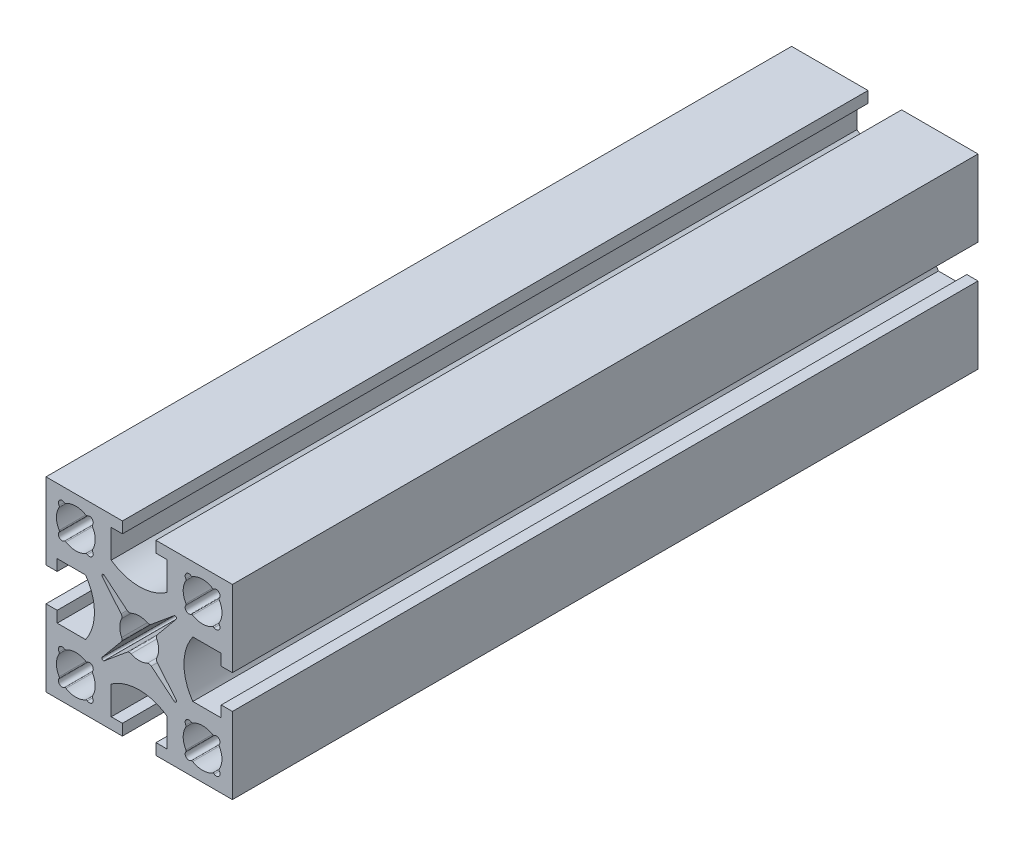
ISO-10303-21;
HEADER;
FILE_DESCRIPTION(('STEP AP214'),'2;1');
FILE_NAME('part.step','',(''),(''),'','','');
FILE_SCHEMA(('AUTOMOTIVE_DESIGN { 1 0 10303 214 1 1 1 1 }'));
ENDSEC;
DATA;
#1=APPLICATION_CONTEXT('core data for automotive mechanical design processes');
#2=APPLICATION_PROTOCOL_DEFINITION('international standard','automotive_design',2000,#1);
#3=PRODUCT_CONTEXT('',#1,'mechanical');
#4=PRODUCT('Part','Part','',(#3));
#5=PRODUCT_RELATED_PRODUCT_CATEGORY('part','',(#4));
#6=PRODUCT_DEFINITION_FORMATION('','',#4);
#7=PRODUCT_DEFINITION_CONTEXT('part definition',#1,'design');
#8=PRODUCT_DEFINITION('design','',#6,#7);
#9=PRODUCT_DEFINITION_SHAPE('','',#8);
#10=(LENGTH_UNIT() NAMED_UNIT(*) SI_UNIT(.MILLI.,.METRE.));
#11=(NAMED_UNIT(*) PLANE_ANGLE_UNIT() SI_UNIT($,.RADIAN.));
#12=(NAMED_UNIT(*) SI_UNIT($,.STERADIAN.) SOLID_ANGLE_UNIT());
#13=UNCERTAINTY_MEASURE_WITH_UNIT(LENGTH_MEASURE(1.E-05),#10,'distance_accuracy_value','');
#14=(GEOMETRIC_REPRESENTATION_CONTEXT(3) GLOBAL_UNCERTAINTY_ASSIGNED_CONTEXT((#13)) GLOBAL_UNIT_ASSIGNED_CONTEXT((#10,
#11,#12)) REPRESENTATION_CONTEXT('',''));
#15=CARTESIAN_POINT('',(0.,0.,0.));
#16=DIRECTION('',(0.,0.,1.));
#17=DIRECTION('',(1.,0.,0.));
#18=AXIS2_PLACEMENT_3D('',#15,#16,#17);
#19=CARTESIAN_POINT('',(-12.5,0.,50.));
#20=DIRECTION('',(0.,0.,-1.));
#21=DIRECTION('',(-1.,0.,0.));
#22=AXIS2_PLACEMENT_3D('',#19,#20,#21);
#23=PLANE('',#22);
#24=CARTESIAN_POINT('',(-10.338477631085,-10.338477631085,50.));
#25=DIRECTION('',(0.,0.,1.));
#26=DIRECTION('',(-1.,0.,0.));
#27=AXIS2_PLACEMENT_3D('',#24,#25,#26);
#28=CIRCLE('',#27,0.500000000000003);
#29=CARTESIAN_POINT('',(-10.744662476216,-10.0469062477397,50.));
#30=VERTEX_POINT('',#29);
#31=CARTESIAN_POINT('',(-10.0469062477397,-10.7446624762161,50.));
#32=VERTEX_POINT('',#31);
#33=EDGE_CURVE('E919',#30,#32,#28,.T.);
#34=ORIENTED_EDGE('',*,*,#33,.F.);
#35=CARTESIAN_POINT('',(-10.9071364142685,-9.93027769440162,50.));
#36=DIRECTION('',(0.,0.,-1.));
#37=DIRECTION('',(1.,0.,0.));
#38=AXIS2_PLACEMENT_3D('',#35,#36,#37);
#39=CIRCLE('',#38,0.199999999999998);
#40=CARTESIAN_POINT('',(-10.7351980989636,-9.82811500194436,50.));
#41=VERTEX_POINT('',#40);
#42=EDGE_CURVE('E951',#41,#30,#39,.T.);
#43=ORIENTED_EDGE('',*,*,#42,.F.);
#44=CARTESIAN_POINT('',(-8.5,-8.5,50.));
#45=DIRECTION('',(0.,0.,1.));
#46=DIRECTION('',(-1.,0.,0.));
#47=AXIS2_PLACEMENT_3D('',#44,#45,#46);
#48=CIRCLE('',#47,2.6);
#49=CARTESIAN_POINT('',(-10.7351980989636,-7.17188499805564,50.));
#50=VERTEX_POINT('',#49);
#51=EDGE_CURVE('E948',#50,#41,#48,.T.);
#52=ORIENTED_EDGE('',*,*,#51,.F.);
#53=CARTESIAN_POINT('',(-10.9071364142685,-7.06972230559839,50.));
#54=DIRECTION('',(0.,0.,-1.));
#55=DIRECTION('',(-1.,0.,0.));
#56=AXIS2_PLACEMENT_3D('',#53,#54,#55);
#57=CIRCLE('',#56,0.2);
#58=CARTESIAN_POINT('',(-10.744662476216,-6.95309375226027,50.));
#59=VERTEX_POINT('',#58);
#60=EDGE_CURVE('E946',#59,#50,#57,.T.);
#61=ORIENTED_EDGE('',*,*,#60,.F.);
#62=CARTESIAN_POINT('',(-10.338477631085,-6.66152236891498,50.));
#63=DIRECTION('',(0.,0.,1.));
#64=DIRECTION('',(-1.,0.,0.));
#65=AXIS2_PLACEMENT_3D('',#62,#63,#64);
#66=CIRCLE('',#65,0.499999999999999);
#67=CARTESIAN_POINT('',(-10.0469062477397,-6.25533752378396,50.));
#68=VERTEX_POINT('',#67);
#69=EDGE_CURVE('E944',#68,#59,#66,.T.);
#70=ORIENTED_EDGE('',*,*,#69,.F.);
#71=CARTESIAN_POINT('',(-9.93027769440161,-6.09286358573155,50.));
#72=DIRECTION('',(0.,0.,-1.));
#73=DIRECTION('',(1.,0.,0.));
#74=AXIS2_PLACEMENT_3D('',#71,#72,#73);
#75=CIRCLE('',#74,0.200000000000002);
#76=CARTESIAN_POINT('',(-9.82811500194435,-6.26480190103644,50.));
#77=VERTEX_POINT('',#76);
#78=EDGE_CURVE('E942',#77,#68,#75,.T.);
#79=ORIENTED_EDGE('',*,*,#78,.F.);
#80=CARTESIAN_POINT('',(-8.5,-8.5,50.));
#81=DIRECTION('',(0.,0.,1.));
#82=DIRECTION('',(-1.,0.,0.));
#83=AXIS2_PLACEMENT_3D('',#80,#81,#82);
#84=CIRCLE('',#83,2.6);
#85=CARTESIAN_POINT('',(-7.17188499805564,-6.26480190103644,50.));
#86=VERTEX_POINT('',#85);
#87=EDGE_CURVE('E940',#86,#77,#84,.T.);
#88=ORIENTED_EDGE('',*,*,#87,.F.);
#89=CARTESIAN_POINT('',(-7.06972230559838,-6.09286358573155,50.));
#90=DIRECTION('',(0.,0.,-1.));
#91=DIRECTION('',(-1.,0.,0.));
#92=AXIS2_PLACEMENT_3D('',#89,#90,#91);
#93=CIRCLE('',#92,0.199999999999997);
#94=CARTESIAN_POINT('',(-6.95309375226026,-6.25533752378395,50.));
#95=VERTEX_POINT('',#94);
#96=EDGE_CURVE('E938',#95,#86,#93,.T.);
#97=ORIENTED_EDGE('',*,*,#96,.F.);
#98=CARTESIAN_POINT('',(-6.66152236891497,-6.66152236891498,50.));
#99=DIRECTION('',(0.,0.,1.));
#100=DIRECTION('',(-1.,0.,0.));
#101=AXIS2_PLACEMENT_3D('',#98,#99,#100);
#102=CIRCLE('',#101,0.500000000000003);
#103=CARTESIAN_POINT('',(-6.25533752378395,-6.95309375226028,50.));
#104=VERTEX_POINT('',#103);
#105=EDGE_CURVE('E936',#104,#95,#102,.T.);
#106=ORIENTED_EDGE('',*,*,#105,.F.);
#107=CARTESIAN_POINT('',(-6.09286358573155,-7.06972230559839,50.));
#108=DIRECTION('',(0.,0.,-1.));
#109=DIRECTION('',(1.,0.,0.));
#110=AXIS2_PLACEMENT_3D('',#107,#108,#109);
#111=CIRCLE('',#110,0.199999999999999);
#112=CARTESIAN_POINT('',(-6.26480190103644,-7.17188499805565,50.));
#113=VERTEX_POINT('',#112);
#114=EDGE_CURVE('E934',#113,#104,#111,.T.);
#115=ORIENTED_EDGE('',*,*,#114,.F.);
#116=CARTESIAN_POINT('',(-8.5,-8.5,50.));
#117=DIRECTION('',(0.,0.,1.));
#118=DIRECTION('',(-1.,0.,0.));
#119=AXIS2_PLACEMENT_3D('',#116,#117,#118);
#120=CIRCLE('',#119,2.6);
#121=CARTESIAN_POINT('',(-6.26480190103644,-9.82811500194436,50.));
#122=VERTEX_POINT('',#121);
#123=EDGE_CURVE('E932',#122,#113,#120,.T.);
#124=ORIENTED_EDGE('',*,*,#123,.F.);
#125=CARTESIAN_POINT('',(-6.09286358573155,-9.93027769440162,50.));
#126=DIRECTION('',(0.,0.,-1.));
#127=DIRECTION('',(-1.,0.,0.));
#128=AXIS2_PLACEMENT_3D('',#125,#126,#127);
#129=CIRCLE('',#128,0.200000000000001);
#130=CARTESIAN_POINT('',(-6.25533752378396,-10.0469062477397,50.));
#131=VERTEX_POINT('',#130);
#132=EDGE_CURVE('E930',#131,#122,#129,.T.);
#133=ORIENTED_EDGE('',*,*,#132,.F.);
#134=CARTESIAN_POINT('',(-6.66152236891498,-10.338477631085,50.));
#135=DIRECTION('',(0.,0.,1.));
#136=DIRECTION('',(-1.,0.,0.));
#137=AXIS2_PLACEMENT_3D('',#134,#135,#136);
#138=CIRCLE('',#137,0.5);
#139=CARTESIAN_POINT('',(-6.95309375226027,-10.744662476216,50.));
#140=VERTEX_POINT('',#139);
#141=EDGE_CURVE('E928',#140,#131,#138,.T.);
#142=ORIENTED_EDGE('',*,*,#141,.F.);
#143=CARTESIAN_POINT('',(-7.06972230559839,-10.9071364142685,50.));
#144=DIRECTION('',(0.,0.,-1.));
#145=DIRECTION('',(1.,0.,0.));
#146=AXIS2_PLACEMENT_3D('',#143,#144,#145);
#147=CIRCLE('',#146,0.200000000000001);
#148=CARTESIAN_POINT('',(-7.17188499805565,-10.7351980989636,50.));
#149=VERTEX_POINT('',#148);
#150=EDGE_CURVE('E926',#149,#140,#147,.T.);
#151=ORIENTED_EDGE('',*,*,#150,.F.);
#152=CARTESIAN_POINT('',(-8.5,-8.5,50.));
#153=DIRECTION('',(0.,0.,1.));
#154=DIRECTION('',(-1.,0.,0.));
#155=AXIS2_PLACEMENT_3D('',#152,#153,#154);
#156=CIRCLE('',#155,2.6);
#157=CARTESIAN_POINT('',(-9.82811500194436,-10.7351980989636,50.));
#158=VERTEX_POINT('',#157);
#159=EDGE_CURVE('E924',#158,#149,#156,.T.);
#160=ORIENTED_EDGE('',*,*,#159,.F.);
#161=CARTESIAN_POINT('',(-9.93027769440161,-10.9071364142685,50.));
#162=DIRECTION('',(0.,0.,-1.));
#163=DIRECTION('',(-1.,0.,0.));
#164=AXIS2_PLACEMENT_3D('',#161,#162,#163);
#165=CIRCLE('',#164,0.199999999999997);
#166=EDGE_CURVE('E921',#32,#158,#165,.T.);
#167=ORIENTED_EDGE('',*,*,#166,.F.);
#168=EDGE_LOOP('',(#34,#43,#52,#61,#70,#79,#88,#97,#106,#115,#124,#133,#142,#151,#160,#167));
#169=FACE_BOUND('',#168,.T.);
#170=CARTESIAN_POINT('',(-10.9071364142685,7.06972230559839,50.));
#171=DIRECTION('',(0.,0.,-1.));
#172=DIRECTION('',(1.,0.,0.));
#173=AXIS2_PLACEMENT_3D('',#170,#171,#172);
#174=CIRCLE('',#173,0.2);
#175=CARTESIAN_POINT('',(-10.7351980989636,7.17188499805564,50.));
#176=VERTEX_POINT('',#175);
#177=CARTESIAN_POINT('',(-10.744662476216,6.95309375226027,50.));
#178=VERTEX_POINT('',#177);
#179=EDGE_CURVE('E1149',#176,#178,#174,.T.);
#180=ORIENTED_EDGE('',*,*,#179,.F.);
#181=CARTESIAN_POINT('',(-8.5,8.5,50.));
#182=DIRECTION('',(0.,0.,1.));
#183=DIRECTION('',(1.,0.,0.));
#184=AXIS2_PLACEMENT_3D('',#181,#182,#183);
#185=CIRCLE('',#184,2.6);
#186=CARTESIAN_POINT('',(-10.7351980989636,9.82811500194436,50.));
#187=VERTEX_POINT('',#186);
#188=EDGE_CURVE('E1181',#187,#176,#185,.T.);
#189=ORIENTED_EDGE('',*,*,#188,.F.);
#190=CARTESIAN_POINT('',(-10.9071364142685,9.93027769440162,50.));
#191=DIRECTION('',(0.,0.,-1.));
#192=DIRECTION('',(-1.,0.,0.));
#193=AXIS2_PLACEMENT_3D('',#190,#191,#192);
#194=CIRCLE('',#193,0.199999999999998);
#195=CARTESIAN_POINT('',(-10.744662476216,10.0469062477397,50.));
#196=VERTEX_POINT('',#195);
#197=EDGE_CURVE('E1178',#196,#187,#194,.T.);
#198=ORIENTED_EDGE('',*,*,#197,.F.);
#199=CARTESIAN_POINT('',(-10.338477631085,10.338477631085,50.));
#200=DIRECTION('',(0.,0.,1.));
#201=DIRECTION('',(1.,0.,0.));
#202=AXIS2_PLACEMENT_3D('',#199,#200,#201);
#203=CIRCLE('',#202,0.500000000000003);
#204=CARTESIAN_POINT('',(-10.0469062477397,10.7446624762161,50.));
#205=VERTEX_POINT('',#204);
#206=EDGE_CURVE('E1176',#205,#196,#203,.T.);
#207=ORIENTED_EDGE('',*,*,#206,.F.);
#208=CARTESIAN_POINT('',(-9.93027769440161,10.9071364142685,50.));
#209=DIRECTION('',(0.,0.,-1.));
#210=DIRECTION('',(1.,0.,0.));
#211=AXIS2_PLACEMENT_3D('',#208,#209,#210);
#212=CIRCLE('',#211,0.199999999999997);
#213=CARTESIAN_POINT('',(-9.82811500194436,10.7351980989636,50.));
#214=VERTEX_POINT('',#213);
#215=EDGE_CURVE('E1174',#214,#205,#212,.T.);
#216=ORIENTED_EDGE('',*,*,#215,.F.);
#217=CARTESIAN_POINT('',(-8.5,8.5,50.));
#218=DIRECTION('',(0.,0.,1.));
#219=DIRECTION('',(1.,0.,0.));
#220=AXIS2_PLACEMENT_3D('',#217,#218,#219);
#221=CIRCLE('',#220,2.6);
#222=CARTESIAN_POINT('',(-7.17188499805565,10.7351980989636,50.));
#223=VERTEX_POINT('',#222);
#224=EDGE_CURVE('E1172',#223,#214,#221,.T.);
#225=ORIENTED_EDGE('',*,*,#224,.F.);
#226=CARTESIAN_POINT('',(-7.06972230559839,10.9071364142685,50.));
#227=DIRECTION('',(0.,0.,-1.));
#228=DIRECTION('',(-1.,0.,0.));
#229=AXIS2_PLACEMENT_3D('',#226,#227,#228);
#230=CIRCLE('',#229,0.200000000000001);
#231=CARTESIAN_POINT('',(-6.95309375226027,10.744662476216,50.));
#232=VERTEX_POINT('',#231);
#233=EDGE_CURVE('E1170',#232,#223,#230,.T.);
#234=ORIENTED_EDGE('',*,*,#233,.F.);
#235=CARTESIAN_POINT('',(-6.66152236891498,10.338477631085,50.));
#236=DIRECTION('',(0.,0.,1.));
#237=DIRECTION('',(1.,0.,0.));
#238=AXIS2_PLACEMENT_3D('',#235,#236,#237);
#239=CIRCLE('',#238,0.5);
#240=CARTESIAN_POINT('',(-6.25533752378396,10.0469062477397,50.));
#241=VERTEX_POINT('',#240);
#242=EDGE_CURVE('E1168',#241,#232,#239,.T.);
#243=ORIENTED_EDGE('',*,*,#242,.F.);
#244=CARTESIAN_POINT('',(-6.09286358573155,9.93027769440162,50.));
#245=DIRECTION('',(0.,0.,-1.));
#246=DIRECTION('',(1.,0.,0.));
#247=AXIS2_PLACEMENT_3D('',#244,#245,#246);
#248=CIRCLE('',#247,0.200000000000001);
#249=CARTESIAN_POINT('',(-6.26480190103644,9.82811500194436,50.));
#250=VERTEX_POINT('',#249);
#251=EDGE_CURVE('E1166',#250,#241,#248,.T.);
#252=ORIENTED_EDGE('',*,*,#251,.F.);
#253=CARTESIAN_POINT('',(-8.5,8.5,50.));
#254=DIRECTION('',(0.,0.,1.));
#255=DIRECTION('',(1.,0.,0.));
#256=AXIS2_PLACEMENT_3D('',#253,#254,#255);
#257=CIRCLE('',#256,2.6);
#258=CARTESIAN_POINT('',(-6.26480190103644,7.17188499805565,50.));
#259=VERTEX_POINT('',#258);
#260=EDGE_CURVE('E1164',#259,#250,#257,.T.);
#261=ORIENTED_EDGE('',*,*,#260,.F.);
#262=CARTESIAN_POINT('',(-6.09286358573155,7.06972230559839,50.));
#263=DIRECTION('',(0.,0.,-1.));
#264=DIRECTION('',(-1.,0.,0.));
#265=AXIS2_PLACEMENT_3D('',#262,#263,#264);
#266=CIRCLE('',#265,0.199999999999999);
#267=CARTESIAN_POINT('',(-6.25533752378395,6.95309375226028,50.));
#268=VERTEX_POINT('',#267);
#269=EDGE_CURVE('E1162',#268,#259,#266,.T.);
#270=ORIENTED_EDGE('',*,*,#269,.F.);
#271=CARTESIAN_POINT('',(-6.66152236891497,6.66152236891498,50.));
#272=DIRECTION('',(0.,0.,1.));
#273=DIRECTION('',(1.,0.,0.));
#274=AXIS2_PLACEMENT_3D('',#271,#272,#273);
#275=CIRCLE('',#274,0.500000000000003);
#276=CARTESIAN_POINT('',(-6.95309375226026,6.25533752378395,50.));
#277=VERTEX_POINT('',#276);
#278=EDGE_CURVE('E1160',#277,#268,#275,.T.);
#279=ORIENTED_EDGE('',*,*,#278,.F.);
#280=CARTESIAN_POINT('',(-7.06972230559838,6.09286358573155,50.));
#281=DIRECTION('',(0.,0.,-1.));
#282=DIRECTION('',(1.,0.,0.));
#283=AXIS2_PLACEMENT_3D('',#280,#281,#282);
#284=CIRCLE('',#283,0.199999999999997);
#285=CARTESIAN_POINT('',(-7.17188499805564,6.26480190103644,50.));
#286=VERTEX_POINT('',#285);
#287=EDGE_CURVE('E1158',#286,#277,#284,.T.);
#288=ORIENTED_EDGE('',*,*,#287,.F.);
#289=CARTESIAN_POINT('',(-8.5,8.5,50.));
#290=DIRECTION('',(0.,0.,1.));
#291=DIRECTION('',(1.,0.,0.));
#292=AXIS2_PLACEMENT_3D('',#289,#290,#291);
#293=CIRCLE('',#292,2.6);
#294=CARTESIAN_POINT('',(-9.82811500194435,6.26480190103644,50.));
#295=VERTEX_POINT('',#294);
#296=EDGE_CURVE('E1156',#295,#286,#293,.T.);
#297=ORIENTED_EDGE('',*,*,#296,.F.);
#298=CARTESIAN_POINT('',(-9.93027769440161,6.09286358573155,50.));
#299=DIRECTION('',(0.,0.,-1.));
#300=DIRECTION('',(-1.,0.,0.));
#301=AXIS2_PLACEMENT_3D('',#298,#299,#300);
#302=CIRCLE('',#301,0.200000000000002);
#303=CARTESIAN_POINT('',(-10.0469062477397,6.25533752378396,50.));
#304=VERTEX_POINT('',#303);
#305=EDGE_CURVE('E1154',#304,#295,#302,.T.);
#306=ORIENTED_EDGE('',*,*,#305,.F.);
#307=CARTESIAN_POINT('',(-10.338477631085,6.66152236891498,50.));
#308=DIRECTION('',(0.,0.,1.));
#309=DIRECTION('',(1.,0.,0.));
#310=AXIS2_PLACEMENT_3D('',#307,#308,#309);
#311=CIRCLE('',#310,0.499999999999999);
#312=EDGE_CURVE('E1151',#178,#304,#311,.T.);
#313=ORIENTED_EDGE('',*,*,#312,.F.);
#314=EDGE_LOOP('',(#180,#189,#198,#207,#216,#225,#234,#243,#252,#261,#270,#279,#288,#297,#306,#313));
#315=FACE_BOUND('',#314,.T.);
#316=DIRECTION('',(0.,-1.,0.));
#317=VECTOR('',#316,1.);
#318=CARTESIAN_POINT('',(-12.5,12.5,50.));
#319=LINE('',#318,#317);
#320=CARTESIAN_POINT('',(-12.5,12.5,50.));
#321=VERTEX_POINT('',#320);
#322=CARTESIAN_POINT('',(-12.5,2.25,50.));
#323=VERTEX_POINT('',#322);
#324=EDGE_CURVE('E1439',#321,#323,#319,.T.);
#325=ORIENTED_EDGE('',*,*,#324,.T.);
#326=DIRECTION('',(1.,0.,0.));
#327=VECTOR('',#326,1.);
#328=CARTESIAN_POINT('',(-12.5,2.25,50.));
#329=LINE('',#328,#327);
#330=CARTESIAN_POINT('',(-11.,2.25,50.));
#331=VERTEX_POINT('',#330);
#332=EDGE_CURVE('E1442',#323,#331,#329,.T.);
#333=ORIENTED_EDGE('',*,*,#332,.T.);
#334=DIRECTION('',(0.,1.,0.));
#335=VECTOR('',#334,1.);
#336=CARTESIAN_POINT('',(-11.,2.25,50.));
#337=LINE('',#336,#335);
#338=CARTESIAN_POINT('',(-11.,3.75,50.));
#339=VERTEX_POINT('',#338);
#340=EDGE_CURVE('E1445',#331,#339,#337,.T.);
#341=ORIENTED_EDGE('',*,*,#340,.T.);
#342=DIRECTION('',(1.,0.,0.));
#343=VECTOR('',#342,1.);
#344=CARTESIAN_POINT('',(-11.,3.75,50.));
#345=LINE('',#344,#343);
#346=CARTESIAN_POINT('',(-7.19080985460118,3.75,50.));
#347=VERTEX_POINT('',#346);
#348=EDGE_CURVE('E1447',#339,#347,#345,.T.);
#349=ORIENTED_EDGE('',*,*,#348,.T.);
#350=CARTESIAN_POINT('',(-12.5,0.,50.));
#351=DIRECTION('',(0.,0.,-1.));
#352=DIRECTION('',(-1.,0.,0.));
#353=AXIS2_PLACEMENT_3D('',#350,#351,#352);
#354=CIRCLE('',#353,6.5);
#355=CARTESIAN_POINT('',(-7.19080985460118,-3.75,50.));
#356=VERTEX_POINT('',#355);
#357=EDGE_CURVE('E1449',#347,#356,#354,.T.);
#358=ORIENTED_EDGE('',*,*,#357,.T.);
#359=DIRECTION('',(-1.,0.,0.));
#360=VECTOR('',#359,1.);
#361=CARTESIAN_POINT('',(-11.,-3.75,50.));
#362=LINE('',#361,#360);
#363=CARTESIAN_POINT('',(-11.,-3.75,50.));
#364=VERTEX_POINT('',#363);
#365=EDGE_CURVE('E1451',#356,#364,#362,.T.);
#366=ORIENTED_EDGE('',*,*,#365,.T.);
#367=DIRECTION('',(0.,1.,0.));
#368=VECTOR('',#367,1.);
#369=CARTESIAN_POINT('',(-11.,-2.25,50.));
#370=LINE('',#369,#368);
#371=CARTESIAN_POINT('',(-11.,-2.25,50.));
#372=VERTEX_POINT('',#371);
#373=EDGE_CURVE('E1453',#364,#372,#370,.T.);
#374=ORIENTED_EDGE('',*,*,#373,.T.);
#375=DIRECTION('',(-1.,0.,0.));
#376=VECTOR('',#375,1.);
#377=CARTESIAN_POINT('',(-12.5,-2.25,50.));
#378=LINE('',#377,#376);
#379=CARTESIAN_POINT('',(-12.5,-2.25,50.));
#380=VERTEX_POINT('',#379);
#381=EDGE_CURVE('E1455',#372,#380,#378,.T.);
#382=ORIENTED_EDGE('',*,*,#381,.T.);
#383=DIRECTION('',(0.,-1.,0.));
#384=VECTOR('',#383,1.);
#385=CARTESIAN_POINT('',(-12.5,-12.5,50.));
#386=LINE('',#385,#384);
#387=CARTESIAN_POINT('',(-12.5,-12.5,50.));
#388=VERTEX_POINT('',#387);
#389=EDGE_CURVE('E1457',#380,#388,#386,.T.);
#390=ORIENTED_EDGE('',*,*,#389,.T.);
#391=DIRECTION('',(1.,0.,0.));
#392=VECTOR('',#391,1.);
#393=CARTESIAN_POINT('',(-12.5,-12.5,50.));
#394=LINE('',#393,#392);
#395=CARTESIAN_POINT('',(-2.25,-12.5,50.));
#396=VERTEX_POINT('',#395);
#397=EDGE_CURVE('E1459',#388,#396,#394,.T.);
#398=ORIENTED_EDGE('',*,*,#397,.T.);
#399=DIRECTION('',(0.,1.,0.));
#400=VECTOR('',#399,1.);
#401=CARTESIAN_POINT('',(-2.25,-12.5,50.));
#402=LINE('',#401,#400);
#403=CARTESIAN_POINT('',(-2.25,-11.,50.));
#404=VERTEX_POINT('',#403);
#405=EDGE_CURVE('E1461',#396,#404,#402,.T.);
#406=ORIENTED_EDGE('',*,*,#405,.T.);
#407=DIRECTION('',(-1.,0.,0.));
#408=VECTOR('',#407,1.);
#409=CARTESIAN_POINT('',(-2.25,-11.,50.));
#410=LINE('',#409,#408);
#411=CARTESIAN_POINT('',(-3.75,-11.,50.));
#412=VERTEX_POINT('',#411);
#413=EDGE_CURVE('E1463',#404,#412,#410,.T.);
#414=ORIENTED_EDGE('',*,*,#413,.T.);
#415=DIRECTION('',(0.,1.,0.));
#416=VECTOR('',#415,1.);
#417=CARTESIAN_POINT('',(-3.75,-11.,50.));
#418=LINE('',#417,#416);
#419=CARTESIAN_POINT('',(-3.75,-7.19080985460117,50.));
#420=VERTEX_POINT('',#419);
#421=EDGE_CURVE('E1465',#412,#420,#418,.T.);
#422=ORIENTED_EDGE('',*,*,#421,.T.);
#423=CARTESIAN_POINT('',(0.,-12.5,50.));
#424=DIRECTION('',(0.,0.,-1.));
#425=DIRECTION('',(-1.,0.,0.));
#426=AXIS2_PLACEMENT_3D('',#423,#424,#425);
#427=CIRCLE('',#426,6.5);
#428=CARTESIAN_POINT('',(3.75,-7.19080985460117,50.));
#429=VERTEX_POINT('',#428);
#430=EDGE_CURVE('E1467',#420,#429,#427,.T.);
#431=ORIENTED_EDGE('',*,*,#430,.T.);
#432=DIRECTION('',(0.,-1.,0.));
#433=VECTOR('',#432,1.);
#434=CARTESIAN_POINT('',(3.75,-11.,50.));
#435=LINE('',#434,#433);
#436=CARTESIAN_POINT('',(3.75,-11.,50.));
#437=VERTEX_POINT('',#436);
#438=EDGE_CURVE('E1469',#429,#437,#435,.T.);
#439=ORIENTED_EDGE('',*,*,#438,.T.);
#440=DIRECTION('',(-1.,0.,0.));
#441=VECTOR('',#440,1.);
#442=CARTESIAN_POINT('',(2.25,-11.,50.));
#443=LINE('',#442,#441);
#444=CARTESIAN_POINT('',(2.25,-11.,50.));
#445=VERTEX_POINT('',#444);
#446=EDGE_CURVE('E1471',#437,#445,#443,.T.);
#447=ORIENTED_EDGE('',*,*,#446,.T.);
#448=DIRECTION('',(0.,-1.,0.));
#449=VECTOR('',#448,1.);
#450=CARTESIAN_POINT('',(2.25,-12.5,50.));
#451=LINE('',#450,#449);
#452=CARTESIAN_POINT('',(2.25,-12.5,50.));
#453=VERTEX_POINT('',#452);
#454=EDGE_CURVE('E1473',#445,#453,#451,.T.);
#455=ORIENTED_EDGE('',*,*,#454,.T.);
#456=DIRECTION('',(1.,0.,0.));
#457=VECTOR('',#456,1.);
#458=CARTESIAN_POINT('',(12.5,-12.5,50.));
#459=LINE('',#458,#457);
#460=CARTESIAN_POINT('',(12.5,-12.5,50.));
#461=VERTEX_POINT('',#460);
#462=EDGE_CURVE('E1475',#453,#461,#459,.T.);
#463=ORIENTED_EDGE('',*,*,#462,.T.);
#464=DIRECTION('',(0.,1.,0.));
#465=VECTOR('',#464,1.);
#466=CARTESIAN_POINT('',(12.5,-12.5,50.));
#467=LINE('',#466,#465);
#468=CARTESIAN_POINT('',(12.5,-2.25,50.));
#469=VERTEX_POINT('',#468);
#470=EDGE_CURVE('E1477',#461,#469,#467,.T.);
#471=ORIENTED_EDGE('',*,*,#470,.T.);
#472=DIRECTION('',(-1.,0.,0.));
#473=VECTOR('',#472,1.);
#474=CARTESIAN_POINT('',(12.5,-2.25,50.));
#475=LINE('',#474,#473);
#476=CARTESIAN_POINT('',(11.,-2.25,50.));
#477=VERTEX_POINT('',#476);
#478=EDGE_CURVE('E1479',#469,#477,#475,.T.);
#479=ORIENTED_EDGE('',*,*,#478,.T.);
#480=DIRECTION('',(0.,-1.,0.));
#481=VECTOR('',#480,1.);
#482=CARTESIAN_POINT('',(11.,-2.25,50.));
#483=LINE('',#482,#481);
#484=CARTESIAN_POINT('',(11.,-3.75,50.));
#485=VERTEX_POINT('',#484);
#486=EDGE_CURVE('E1481',#477,#485,#483,.T.);
#487=ORIENTED_EDGE('',*,*,#486,.T.);
#488=DIRECTION('',(-1.,0.,0.));
#489=VECTOR('',#488,1.);
#490=CARTESIAN_POINT('',(11.,-3.75,50.));
#491=LINE('',#490,#489);
#492=CARTESIAN_POINT('',(7.19080985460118,-3.75,50.));
#493=VERTEX_POINT('',#492);
#494=EDGE_CURVE('E1483',#485,#493,#491,.T.);
#495=ORIENTED_EDGE('',*,*,#494,.T.);
#496=CARTESIAN_POINT('',(12.5,0.,50.));
#497=DIRECTION('',(0.,0.,-1.));
#498=DIRECTION('',(1.,0.,0.));
#499=AXIS2_PLACEMENT_3D('',#496,#497,#498);
#500=CIRCLE('',#499,6.5);
#501=CARTESIAN_POINT('',(7.19080985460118,3.75,50.));
#502=VERTEX_POINT('',#501);
#503=EDGE_CURVE('E1485',#493,#502,#500,.T.);
#504=ORIENTED_EDGE('',*,*,#503,.T.);
#505=DIRECTION('',(1.,0.,0.));
#506=VECTOR('',#505,1.);
#507=CARTESIAN_POINT('',(11.,3.75,50.));
#508=LINE('',#507,#506);
#509=CARTESIAN_POINT('',(11.,3.75,50.));
#510=VERTEX_POINT('',#509);
#511=EDGE_CURVE('E1487',#502,#510,#508,.T.);
#512=ORIENTED_EDGE('',*,*,#511,.T.);
#513=DIRECTION('',(0.,-1.,0.));
#514=VECTOR('',#513,1.);
#515=CARTESIAN_POINT('',(11.,2.25,50.));
#516=LINE('',#515,#514);
#517=CARTESIAN_POINT('',(11.,2.25,50.));
#518=VERTEX_POINT('',#517);
#519=EDGE_CURVE('E1489',#510,#518,#516,.T.);
#520=ORIENTED_EDGE('',*,*,#519,.T.);
#521=DIRECTION('',(1.,0.,0.));
#522=VECTOR('',#521,1.);
#523=CARTESIAN_POINT('',(12.5,2.25,50.));
#524=LINE('',#523,#522);
#525=CARTESIAN_POINT('',(12.5,2.25,50.));
#526=VERTEX_POINT('',#525);
#527=EDGE_CURVE('E1491',#518,#526,#524,.T.);
#528=ORIENTED_EDGE('',*,*,#527,.T.);
#529=DIRECTION('',(0.,1.,0.));
#530=VECTOR('',#529,1.);
#531=CARTESIAN_POINT('',(12.5,12.5,50.));
#532=LINE('',#531,#530);
#533=CARTESIAN_POINT('',(12.5,12.5,50.));
#534=VERTEX_POINT('',#533);
#535=EDGE_CURVE('E1493',#526,#534,#532,.T.);
#536=ORIENTED_EDGE('',*,*,#535,.T.);
#537=DIRECTION('',(-1.,0.,0.));
#538=VECTOR('',#537,1.);
#539=CARTESIAN_POINT('',(12.5,12.5,50.));
#540=LINE('',#539,#538);
#541=CARTESIAN_POINT('',(2.25,12.5,50.));
#542=VERTEX_POINT('',#541);
#543=EDGE_CURVE('E1495',#534,#542,#540,.T.);
#544=ORIENTED_EDGE('',*,*,#543,.T.);
#545=DIRECTION('',(0.,-1.,0.));
#546=VECTOR('',#545,1.);
#547=CARTESIAN_POINT('',(2.25,12.5,50.));
#548=LINE('',#547,#546);
#549=CARTESIAN_POINT('',(2.25,11.,50.));
#550=VERTEX_POINT('',#549);
#551=EDGE_CURVE('E1497',#542,#550,#548,.T.);
#552=ORIENTED_EDGE('',*,*,#551,.T.);
#553=DIRECTION('',(1.,0.,0.));
#554=VECTOR('',#553,1.);
#555=CARTESIAN_POINT('',(2.25,11.,50.));
#556=LINE('',#555,#554);
#557=CARTESIAN_POINT('',(3.75,11.,50.));
#558=VERTEX_POINT('',#557);
#559=EDGE_CURVE('E1499',#550,#558,#556,.T.);
#560=ORIENTED_EDGE('',*,*,#559,.T.);
#561=DIRECTION('',(0.,-1.,0.));
#562=VECTOR('',#561,1.);
#563=CARTESIAN_POINT('',(3.75,11.,50.));
#564=LINE('',#563,#562);
#565=CARTESIAN_POINT('',(3.75,7.19080985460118,50.));
#566=VERTEX_POINT('',#565);
#567=EDGE_CURVE('E1501',#558,#566,#564,.T.);
#568=ORIENTED_EDGE('',*,*,#567,.T.);
#569=CARTESIAN_POINT('',(0.,12.5,50.));
#570=DIRECTION('',(0.,0.,-1.));
#571=DIRECTION('',(1.,0.,0.));
#572=AXIS2_PLACEMENT_3D('',#569,#570,#571);
#573=CIRCLE('',#572,6.5);
#574=CARTESIAN_POINT('',(-3.75,7.19080985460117,50.));
#575=VERTEX_POINT('',#574);
#576=EDGE_CURVE('E1503',#566,#575,#573,.T.);
#577=ORIENTED_EDGE('',*,*,#576,.T.);
#578=DIRECTION('',(0.,1.,0.));
#579=VECTOR('',#578,1.);
#580=CARTESIAN_POINT('',(-3.75,11.,50.));
#581=LINE('',#580,#579);
#582=CARTESIAN_POINT('',(-3.75,11.,50.));
#583=VERTEX_POINT('',#582);
#584=EDGE_CURVE('E1505',#575,#583,#581,.T.);
#585=ORIENTED_EDGE('',*,*,#584,.T.);
#586=DIRECTION('',(1.,0.,0.));
#587=VECTOR('',#586,1.);
#588=CARTESIAN_POINT('',(-2.25,11.,50.));
#589=LINE('',#588,#587);
#590=CARTESIAN_POINT('',(-2.25,11.,50.));
#591=VERTEX_POINT('',#590);
#592=EDGE_CURVE('E1507',#583,#591,#589,.T.);
#593=ORIENTED_EDGE('',*,*,#592,.T.);
#594=DIRECTION('',(0.,1.,0.));
#595=VECTOR('',#594,1.);
#596=CARTESIAN_POINT('',(-2.25,12.5,50.));
#597=LINE('',#596,#595);
#598=CARTESIAN_POINT('',(-2.25,12.5,50.));
#599=VERTEX_POINT('',#598);
#600=EDGE_CURVE('E1509',#591,#599,#597,.T.);
#601=ORIENTED_EDGE('',*,*,#600,.T.);
#602=DIRECTION('',(-1.,0.,0.));
#603=VECTOR('',#602,1.);
#604=CARTESIAN_POINT('',(-12.5,12.5,50.));
#605=LINE('',#604,#603);
#606=EDGE_CURVE('E1511',#599,#321,#605,.T.);
#607=ORIENTED_EDGE('',*,*,#606,.T.);
#608=EDGE_LOOP('',(#325,#333,#341,#349,#358,#366,#374,#382,#390,#398,#406,#414,#422,#431,#439,
#447,#455,#463,#471,#479,#487,#495,#504,#512,#520,#528,#536,#544,#552,#560,#568,#577,#585,#593,
#601,#607));
#609=FACE_BOUND('',#608,.T.);
#610=CARTESIAN_POINT('',(1.3040225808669,2.81238779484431,50.));
#611=DIRECTION('',(0.,0.,-1.));
#612=DIRECTION('',(-1.,0.,0.));
#613=AXIS2_PLACEMENT_3D('',#610,#611,#612);
#614=CIRCLE('',#613,0.5);
#615=CARTESIAN_POINT('',(1.6231388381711,2.4274659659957,50.));
#616=VERTEX_POINT('',#615);
#617=CARTESIAN_POINT('',(1.09369635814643,2.358776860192,50.));
#618=VERTEX_POINT('',#617);
#619=EDGE_CURVE('E1264',#616,#618,#614,.T.);
#620=ORIENTED_EDGE('',*,*,#619,.F.);
#621=DIRECTION('',(-0.76984365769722,-0.638232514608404,0.));
#622=VECTOR('',#621,1.);
#623=CARTESIAN_POINT('',(1.6231388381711,2.4274659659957,50.));
#624=LINE('',#623,#622);
#625=CARTESIAN_POINT('',(4.68067960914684,4.96229484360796,50.));
#626=VERTEX_POINT('',#625);
#627=EDGE_CURVE('E1312',#626,#616,#624,.T.);
#628=ORIENTED_EDGE('',*,*,#627,.F.);
#629=CARTESIAN_POINT('',(4.80832611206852,4.80832611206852,50.));
#630=DIRECTION('',(0.,0.,1.));
#631=DIRECTION('',(1.,0.,0.));
#632=AXIS2_PLACEMENT_3D('',#629,#630,#631);
#633=CIRCLE('',#632,0.200000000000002);
#634=CARTESIAN_POINT('',(4.96229484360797,4.68067960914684,50.));
#635=VERTEX_POINT('',#634);
#636=EDGE_CURVE('E1309',#635,#626,#633,.T.);
#637=ORIENTED_EDGE('',*,*,#636,.F.);
#638=DIRECTION('',(0.638232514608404,0.769843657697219,0.));
#639=VECTOR('',#638,1.);
#640=CARTESIAN_POINT('',(2.4274659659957,1.6231388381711,50.));
#641=LINE('',#640,#639);
#642=CARTESIAN_POINT('',(2.4274659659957,1.6231388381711,50.));
#643=VERTEX_POINT('',#642);
#644=EDGE_CURVE('E1307',#643,#635,#641,.T.);
#645=ORIENTED_EDGE('',*,*,#644,.F.);
#646=CARTESIAN_POINT('',(2.81238779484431,1.3040225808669,50.));
#647=DIRECTION('',(0.,0.,-1.));
#648=DIRECTION('',(1.,0.,0.));
#649=AXIS2_PLACEMENT_3D('',#646,#647,#648);
#650=CIRCLE('',#649,0.500000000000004);
#651=CARTESIAN_POINT('',(2.358776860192,1.09369635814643,50.));
#652=VERTEX_POINT('',#651);
#653=EDGE_CURVE('E1305',#652,#643,#650,.T.);
#654=ORIENTED_EDGE('',*,*,#653,.F.);
#655=CARTESIAN_POINT('',(0.,0.,50.));
#656=DIRECTION('',(0.,0.,1.));
#657=DIRECTION('',(1.,0.,0.));
#658=AXIS2_PLACEMENT_3D('',#655,#656,#657);
#659=CIRCLE('',#658,2.6);
#660=CARTESIAN_POINT('',(2.358776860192,-1.09369635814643,50.));
#661=VERTEX_POINT('',#660);
#662=EDGE_CURVE('E1303',#661,#652,#659,.T.);
#663=ORIENTED_EDGE('',*,*,#662,.F.);
#664=CARTESIAN_POINT('',(2.81238779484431,-1.3040225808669,50.));
#665=DIRECTION('',(0.,0.,-1.));
#666=DIRECTION('',(-1.,0.,0.));
#667=AXIS2_PLACEMENT_3D('',#664,#665,#666);
#668=CIRCLE('',#667,0.500000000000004);
#669=CARTESIAN_POINT('',(2.4274659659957,-1.6231388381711,50.));
#670=VERTEX_POINT('',#669);
#671=EDGE_CURVE('E1301',#670,#661,#668,.T.);
#672=ORIENTED_EDGE('',*,*,#671,.F.);
#673=DIRECTION('',(-0.638232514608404,0.769843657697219,0.));
#674=VECTOR('',#673,1.);
#675=CARTESIAN_POINT('',(2.4274659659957,-1.6231388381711,50.));
#676=LINE('',#675,#674);
#677=CARTESIAN_POINT('',(4.96229484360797,-4.68067960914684,50.));
#678=VERTEX_POINT('',#677);
#679=EDGE_CURVE('E1299',#678,#670,#676,.T.);
#680=ORIENTED_EDGE('',*,*,#679,.F.);
#681=CARTESIAN_POINT('',(4.80832611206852,-4.80832611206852,50.));
#682=DIRECTION('',(0.,0.,1.));
#683=DIRECTION('',(1.,0.,0.));
#684=AXIS2_PLACEMENT_3D('',#681,#682,#683);
#685=CIRCLE('',#684,0.199999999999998);
#686=CARTESIAN_POINT('',(4.68067960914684,-4.96229484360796,50.));
#687=VERTEX_POINT('',#686);
#688=EDGE_CURVE('E1297',#687,#678,#685,.T.);
#689=ORIENTED_EDGE('',*,*,#688,.F.);
#690=DIRECTION('',(0.76984365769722,-0.638232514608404,0.));
#691=VECTOR('',#690,1.);
#692=CARTESIAN_POINT('',(1.6231388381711,-2.4274659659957,50.));
#693=LINE('',#692,#691);
#694=CARTESIAN_POINT('',(1.6231388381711,-2.4274659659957,50.));
#695=VERTEX_POINT('',#694);
#696=EDGE_CURVE('E1295',#695,#687,#693,.T.);
#697=ORIENTED_EDGE('',*,*,#696,.F.);
#698=CARTESIAN_POINT('',(1.3040225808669,-2.81238779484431,50.));
#699=DIRECTION('',(0.,0.,-1.));
#700=DIRECTION('',(1.,0.,0.));
#701=AXIS2_PLACEMENT_3D('',#698,#699,#700);
#702=CIRCLE('',#701,0.5);
#703=CARTESIAN_POINT('',(1.09369635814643,-2.358776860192,50.));
#704=VERTEX_POINT('',#703);
#705=EDGE_CURVE('E1293',#704,#695,#702,.T.);
#706=ORIENTED_EDGE('',*,*,#705,.F.);
#707=CARTESIAN_POINT('',(0.,0.,50.));
#708=DIRECTION('',(0.,0.,1.));
#709=DIRECTION('',(1.,0.,0.));
#710=AXIS2_PLACEMENT_3D('',#707,#708,#709);
#711=CIRCLE('',#710,2.6);
#712=CARTESIAN_POINT('',(-1.09369635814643,-2.358776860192,50.));
#713=VERTEX_POINT('',#712);
#714=EDGE_CURVE('E1291',#713,#704,#711,.T.);
#715=ORIENTED_EDGE('',*,*,#714,.F.);
#716=CARTESIAN_POINT('',(-1.30402258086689,-2.81238779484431,50.));
#717=DIRECTION('',(0.,0.,-1.));
#718=DIRECTION('',(-1.,0.,0.));
#719=AXIS2_PLACEMENT_3D('',#716,#717,#718);
#720=CIRCLE('',#719,0.5);
#721=CARTESIAN_POINT('',(-1.62313883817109,-2.4274659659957,50.));
#722=VERTEX_POINT('',#721);
#723=EDGE_CURVE('E1289',#722,#713,#720,.T.);
#724=ORIENTED_EDGE('',*,*,#723,.F.);
#725=DIRECTION('',(0.769843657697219,0.638232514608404,0.));
#726=VECTOR('',#725,1.);
#727=CARTESIAN_POINT('',(-1.62313883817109,-2.4274659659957,50.));
#728=LINE('',#727,#726);
#729=CARTESIAN_POINT('',(-4.68067960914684,-4.96229484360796,50.));
#730=VERTEX_POINT('',#729);
#731=EDGE_CURVE('E1287',#730,#722,#728,.T.);
#732=ORIENTED_EDGE('',*,*,#731,.F.);
#733=CARTESIAN_POINT('',(-4.80832611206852,-4.80832611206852,50.));
#734=DIRECTION('',(0.,0.,1.));
#735=DIRECTION('',(1.,0.,0.));
#736=AXIS2_PLACEMENT_3D('',#733,#734,#735);
#737=CIRCLE('',#736,0.199999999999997);
#738=CARTESIAN_POINT('',(-4.96229484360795,-4.68067960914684,50.));
#739=VERTEX_POINT('',#738);
#740=EDGE_CURVE('E1285',#739,#730,#737,.T.);
#741=ORIENTED_EDGE('',*,*,#740,.F.);
#742=DIRECTION('',(-0.638232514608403,-0.76984365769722,0.));
#743=VECTOR('',#742,1.);
#744=CARTESIAN_POINT('',(-2.4274659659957,-1.6231388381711,50.));
#745=LINE('',#744,#743);
#746=CARTESIAN_POINT('',(-2.4274659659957,-1.6231388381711,50.));
#747=VERTEX_POINT('',#746);
#748=EDGE_CURVE('E1283',#747,#739,#745,.T.);
#749=ORIENTED_EDGE('',*,*,#748,.F.);
#750=CARTESIAN_POINT('',(-2.8123877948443,-1.3040225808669,50.));
#751=DIRECTION('',(0.,0.,-1.));
#752=DIRECTION('',(1.,0.,0.));
#753=AXIS2_PLACEMENT_3D('',#750,#751,#752);
#754=CIRCLE('',#753,0.499999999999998);
#755=CARTESIAN_POINT('',(-2.358776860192,-1.09369635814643,50.));
#756=VERTEX_POINT('',#755);
#757=EDGE_CURVE('E1281',#756,#747,#754,.T.);
#758=ORIENTED_EDGE('',*,*,#757,.F.);
#759=CARTESIAN_POINT('',(0.,0.,50.));
#760=DIRECTION('',(0.,0.,1.));
#761=DIRECTION('',(1.,0.,0.));
#762=AXIS2_PLACEMENT_3D('',#759,#760,#761);
#763=CIRCLE('',#762,2.6);
#764=CARTESIAN_POINT('',(-2.358776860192,1.09369635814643,50.));
#765=VERTEX_POINT('',#764);
#766=EDGE_CURVE('E1279',#765,#756,#763,.T.);
#767=ORIENTED_EDGE('',*,*,#766,.F.);
#768=CARTESIAN_POINT('',(-2.81238779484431,1.3040225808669,50.));
#769=DIRECTION('',(0.,0.,-1.));
#770=DIRECTION('',(-1.,0.,0.));
#771=AXIS2_PLACEMENT_3D('',#768,#769,#770);
#772=CIRCLE('',#771,0.500000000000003);
#773=CARTESIAN_POINT('',(-2.4274659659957,1.6231388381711,50.));
#774=VERTEX_POINT('',#773);
#775=EDGE_CURVE('E1277',#774,#765,#772,.T.);
#776=ORIENTED_EDGE('',*,*,#775,.F.);
#777=DIRECTION('',(0.638232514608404,-0.769843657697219,0.));
#778=VECTOR('',#777,1.);
#779=CARTESIAN_POINT('',(-2.4274659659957,1.6231388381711,50.));
#780=LINE('',#779,#778);
#781=CARTESIAN_POINT('',(-4.96229484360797,4.68067960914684,50.));
#782=VERTEX_POINT('',#781);
#783=EDGE_CURVE('E1275',#782,#774,#780,.T.);
#784=ORIENTED_EDGE('',*,*,#783,.F.);
#785=CARTESIAN_POINT('',(-4.80832611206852,4.80832611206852,50.));
#786=DIRECTION('',(0.,0.,1.));
#787=DIRECTION('',(1.,0.,0.));
#788=AXIS2_PLACEMENT_3D('',#785,#786,#787);
#789=CIRCLE('',#788,0.200000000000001);
#790=CARTESIAN_POINT('',(-4.68067960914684,4.96229484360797,50.));
#791=VERTEX_POINT('',#790);
#792=EDGE_CURVE('E1273',#791,#782,#789,.T.);
#793=ORIENTED_EDGE('',*,*,#792,.F.);
#794=DIRECTION('',(-0.769843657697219,0.638232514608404,0.));
#795=VECTOR('',#794,1.);
#796=CARTESIAN_POINT('',(-1.6231388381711,2.4274659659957,50.));
#797=LINE('',#796,#795);
#798=CARTESIAN_POINT('',(-1.6231388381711,2.4274659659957,50.));
#799=VERTEX_POINT('',#798);
#800=EDGE_CURVE('E1271',#799,#791,#797,.T.);
#801=ORIENTED_EDGE('',*,*,#800,.F.);
#802=CARTESIAN_POINT('',(-1.3040225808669,2.81238779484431,50.));
#803=DIRECTION('',(0.,0.,-1.));
#804=DIRECTION('',(1.,0.,0.));
#805=AXIS2_PLACEMENT_3D('',#802,#803,#804);
#806=CIRCLE('',#805,0.500000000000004);
#807=CARTESIAN_POINT('',(-1.09369635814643,2.358776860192,50.));
#808=VERTEX_POINT('',#807);
#809=EDGE_CURVE('E1269',#808,#799,#806,.T.);
#810=ORIENTED_EDGE('',*,*,#809,.F.);
#811=CARTESIAN_POINT('',(0.,0.,50.));
#812=DIRECTION('',(0.,0.,1.));
#813=DIRECTION('',(-1.,0.,0.));
#814=AXIS2_PLACEMENT_3D('',#811,#812,#813);
#815=CIRCLE('',#814,2.6);
#816=EDGE_CURVE('E1266',#618,#808,#815,.T.);
#817=ORIENTED_EDGE('',*,*,#816,.F.);
#818=EDGE_LOOP('',(#620,#628,#637,#645,#654,#663,#672,#680,#689,#697,#706,#715,#724,#732,#741,
#749,#758,#767,#776,#784,#793,#801,#810,#817));
#819=FACE_BOUND('',#818,.T.);
#820=CARTESIAN_POINT('',(10.338477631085,10.338477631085,50.));
#821=DIRECTION('',(0.,0.,1.));
#822=DIRECTION('',(-1.,0.,0.));
#823=AXIS2_PLACEMENT_3D('',#820,#821,#822);
#824=CIRCLE('',#823,0.500000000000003);
#825=CARTESIAN_POINT('',(10.744662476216,10.0469062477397,50.));
#826=VERTEX_POINT('',#825);
#827=CARTESIAN_POINT('',(10.0469062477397,10.7446624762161,50.));
#828=VERTEX_POINT('',#827);
#829=EDGE_CURVE('E1034',#826,#828,#824,.T.);
#830=ORIENTED_EDGE('',*,*,#829,.F.);
#831=CARTESIAN_POINT('',(10.9071364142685,9.93027769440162,50.));
#832=DIRECTION('',(0.,0.,-1.));
#833=DIRECTION('',(1.,0.,0.));
#834=AXIS2_PLACEMENT_3D('',#831,#832,#833);
#835=CIRCLE('',#834,0.199999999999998);
#836=CARTESIAN_POINT('',(10.7351980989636,9.82811500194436,50.));
#837=VERTEX_POINT('',#836);
#838=EDGE_CURVE('E1066',#837,#826,#835,.T.);
#839=ORIENTED_EDGE('',*,*,#838,.F.);
#840=CARTESIAN_POINT('',(8.5,8.5,50.));
#841=DIRECTION('',(0.,0.,1.));
#842=DIRECTION('',(-1.,0.,0.));
#843=AXIS2_PLACEMENT_3D('',#840,#841,#842);
#844=CIRCLE('',#843,2.6);
#845=CARTESIAN_POINT('',(10.7351980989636,7.17188499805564,50.));
#846=VERTEX_POINT('',#845);
#847=EDGE_CURVE('E1063',#846,#837,#844,.T.);
#848=ORIENTED_EDGE('',*,*,#847,.F.);
#849=CARTESIAN_POINT('',(10.9071364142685,7.06972230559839,50.));
#850=DIRECTION('',(0.,0.,-1.));
#851=DIRECTION('',(-1.,0.,0.));
#852=AXIS2_PLACEMENT_3D('',#849,#850,#851);
#853=CIRCLE('',#852,0.2);
#854=CARTESIAN_POINT('',(10.744662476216,6.95309375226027,50.));
#855=VERTEX_POINT('',#854);
#856=EDGE_CURVE('E1061',#855,#846,#853,.T.);
#857=ORIENTED_EDGE('',*,*,#856,.F.);
#858=CARTESIAN_POINT('',(10.338477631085,6.66152236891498,50.));
#859=DIRECTION('',(0.,0.,1.));
#860=DIRECTION('',(-1.,0.,0.));
#861=AXIS2_PLACEMENT_3D('',#858,#859,#860);
#862=CIRCLE('',#861,0.499999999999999);
#863=CARTESIAN_POINT('',(10.0469062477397,6.25533752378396,50.));
#864=VERTEX_POINT('',#863);
#865=EDGE_CURVE('E1059',#864,#855,#862,.T.);
#866=ORIENTED_EDGE('',*,*,#865,.F.);
#867=CARTESIAN_POINT('',(9.93027769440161,6.09286358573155,50.));
#868=DIRECTION('',(0.,0.,-1.));
#869=DIRECTION('',(1.,0.,0.));
#870=AXIS2_PLACEMENT_3D('',#867,#868,#869);
#871=CIRCLE('',#870,0.200000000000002);
#872=CARTESIAN_POINT('',(9.82811500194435,6.26480190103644,50.));
#873=VERTEX_POINT('',#872);
#874=EDGE_CURVE('E1057',#873,#864,#871,.T.);
#875=ORIENTED_EDGE('',*,*,#874,.F.);
#876=CARTESIAN_POINT('',(8.5,8.5,50.));
#877=DIRECTION('',(0.,0.,1.));
#878=DIRECTION('',(-1.,0.,0.));
#879=AXIS2_PLACEMENT_3D('',#876,#877,#878);
#880=CIRCLE('',#879,2.6);
#881=CARTESIAN_POINT('',(7.17188499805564,6.26480190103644,50.));
#882=VERTEX_POINT('',#881);
#883=EDGE_CURVE('E1055',#882,#873,#880,.T.);
#884=ORIENTED_EDGE('',*,*,#883,.F.);
#885=CARTESIAN_POINT('',(7.06972230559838,6.09286358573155,50.));
#886=DIRECTION('',(0.,0.,-1.));
#887=DIRECTION('',(-1.,0.,0.));
#888=AXIS2_PLACEMENT_3D('',#885,#886,#887);
#889=CIRCLE('',#888,0.199999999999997);
#890=CARTESIAN_POINT('',(6.95309375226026,6.25533752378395,50.));
#891=VERTEX_POINT('',#890);
#892=EDGE_CURVE('E1053',#891,#882,#889,.T.);
#893=ORIENTED_EDGE('',*,*,#892,.F.);
#894=CARTESIAN_POINT('',(6.66152236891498,6.66152236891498,50.));
#895=DIRECTION('',(0.,0.,1.));
#896=DIRECTION('',(-1.,0.,0.));
#897=AXIS2_PLACEMENT_3D('',#894,#895,#896);
#898=CIRCLE('',#897,0.500000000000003);
#899=CARTESIAN_POINT('',(6.25533752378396,6.95309375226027,50.));
#900=VERTEX_POINT('',#899);
#901=EDGE_CURVE('E1051',#900,#891,#898,.T.);
#902=ORIENTED_EDGE('',*,*,#901,.F.);
#903=CARTESIAN_POINT('',(6.09286358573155,7.06972230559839,50.));
#904=DIRECTION('',(0.,0.,-1.));
#905=DIRECTION('',(1.,0.,0.));
#906=AXIS2_PLACEMENT_3D('',#903,#904,#905);
#907=CIRCLE('',#906,0.199999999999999);
#908=CARTESIAN_POINT('',(6.26480190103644,7.17188499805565,50.));
#909=VERTEX_POINT('',#908);
#910=EDGE_CURVE('E1049',#909,#900,#907,.T.);
#911=ORIENTED_EDGE('',*,*,#910,.F.);
#912=CARTESIAN_POINT('',(8.5,8.5,50.));
#913=DIRECTION('',(0.,0.,1.));
#914=DIRECTION('',(-1.,0.,0.));
#915=AXIS2_PLACEMENT_3D('',#912,#913,#914);
#916=CIRCLE('',#915,2.6);
#917=CARTESIAN_POINT('',(6.26480190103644,9.82811500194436,50.));
#918=VERTEX_POINT('',#917);
#919=EDGE_CURVE('E1047',#918,#909,#916,.T.);
#920=ORIENTED_EDGE('',*,*,#919,.F.);
#921=CARTESIAN_POINT('',(6.09286358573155,9.93027769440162,50.));
#922=DIRECTION('',(0.,0.,-1.));
#923=DIRECTION('',(-1.,0.,0.));
#924=AXIS2_PLACEMENT_3D('',#921,#922,#923);
#925=CIRCLE('',#924,0.200000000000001);
#926=CARTESIAN_POINT('',(6.25533752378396,10.0469062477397,50.));
#927=VERTEX_POINT('',#926);
#928=EDGE_CURVE('E1045',#927,#918,#925,.T.);
#929=ORIENTED_EDGE('',*,*,#928,.F.);
#930=CARTESIAN_POINT('',(6.66152236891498,10.338477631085,50.));
#931=DIRECTION('',(0.,0.,1.));
#932=DIRECTION('',(-1.,0.,0.));
#933=AXIS2_PLACEMENT_3D('',#930,#931,#932);
#934=CIRCLE('',#933,0.5);
#935=CARTESIAN_POINT('',(6.95309375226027,10.744662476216,50.));
#936=VERTEX_POINT('',#935);
#937=EDGE_CURVE('E1043',#936,#927,#934,.T.);
#938=ORIENTED_EDGE('',*,*,#937,.F.);
#939=CARTESIAN_POINT('',(7.06972230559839,10.9071364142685,50.));
#940=DIRECTION('',(0.,0.,-1.));
#941=DIRECTION('',(1.,0.,0.));
#942=AXIS2_PLACEMENT_3D('',#939,#940,#941);
#943=CIRCLE('',#942,0.200000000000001);
#944=CARTESIAN_POINT('',(7.17188499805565,10.7351980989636,50.));
#945=VERTEX_POINT('',#944);
#946=EDGE_CURVE('E1041',#945,#936,#943,.T.);
#947=ORIENTED_EDGE('',*,*,#946,.F.);
#948=CARTESIAN_POINT('',(8.5,8.5,50.));
#949=DIRECTION('',(0.,0.,1.));
#950=DIRECTION('',(-1.,0.,0.));
#951=AXIS2_PLACEMENT_3D('',#948,#949,#950);
#952=CIRCLE('',#951,2.6);
#953=CARTESIAN_POINT('',(9.82811500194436,10.7351980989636,50.));
#954=VERTEX_POINT('',#953);
#955=EDGE_CURVE('E1039',#954,#945,#952,.T.);
#956=ORIENTED_EDGE('',*,*,#955,.F.);
#957=CARTESIAN_POINT('',(9.93027769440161,10.9071364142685,50.));
#958=DIRECTION('',(0.,0.,-1.));
#959=DIRECTION('',(-1.,0.,0.));
#960=AXIS2_PLACEMENT_3D('',#957,#958,#959);
#961=CIRCLE('',#960,0.199999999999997);
#962=EDGE_CURVE('E1036',#828,#954,#961,.T.);
#963=ORIENTED_EDGE('',*,*,#962,.F.);
#964=EDGE_LOOP('',(#830,#839,#848,#857,#866,#875,#884,#893,#902,#911,#920,#929,#938,#947,#956,#963));
#965=FACE_BOUND('',#964,.T.);
#966=CARTESIAN_POINT('',(10.9071364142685,-9.93027769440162,50.));
#967=DIRECTION('',(0.,0.,-1.));
#968=DIRECTION('',(-1.,0.,0.));
#969=AXIS2_PLACEMENT_3D('',#966,#967,#968);
#970=CIRCLE('',#969,0.199999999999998);
#971=CARTESIAN_POINT('',(10.744662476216,-10.0469062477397,50.));
#972=VERTEX_POINT('',#971);
#973=CARTESIAN_POINT('',(10.7351980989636,-9.82811500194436,50.));
#974=VERTEX_POINT('',#973);
#975=EDGE_CURVE('E798',#972,#974,#970,.T.);
#976=ORIENTED_EDGE('',*,*,#975,.F.);
#977=CARTESIAN_POINT('',(10.338477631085,-10.338477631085,50.));
#978=DIRECTION('',(0.,0.,1.));
#979=DIRECTION('',(1.,0.,0.));
#980=AXIS2_PLACEMENT_3D('',#977,#978,#979);
#981=CIRCLE('',#980,0.500000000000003);
#982=CARTESIAN_POINT('',(10.0469062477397,-10.7446624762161,50.));
#983=VERTEX_POINT('',#982);
#984=EDGE_CURVE('E847',#983,#972,#981,.T.);
#985=ORIENTED_EDGE('',*,*,#984,.F.);
#986=CARTESIAN_POINT('',(9.93027769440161,-10.9071364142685,50.));
#987=DIRECTION('',(0.,0.,-1.));
#988=DIRECTION('',(1.,0.,0.));
#989=AXIS2_PLACEMENT_3D('',#986,#987,#988);
#990=CIRCLE('',#989,0.199999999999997);
#991=CARTESIAN_POINT('',(9.82811500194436,-10.7351980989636,50.));
#992=VERTEX_POINT('',#991);
#993=EDGE_CURVE('E845',#992,#983,#990,.T.);
#994=ORIENTED_EDGE('',*,*,#993,.F.);
#995=CARTESIAN_POINT('',(8.5,-8.5,50.));
#996=DIRECTION('',(0.,0.,1.));
#997=DIRECTION('',(1.,0.,0.));
#998=AXIS2_PLACEMENT_3D('',#995,#996,#997);
#999=CIRCLE('',#998,2.6);
#1000=CARTESIAN_POINT('',(7.17188499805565,-10.7351980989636,50.));
#1001=VERTEX_POINT('',#1000);
#1002=EDGE_CURVE('E843',#1001,#992,#999,.T.);
#1003=ORIENTED_EDGE('',*,*,#1002,.F.);
#1004=CARTESIAN_POINT('',(7.06972230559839,-10.9071364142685,50.));
#1005=DIRECTION('',(0.,0.,-1.));
#1006=DIRECTION('',(-1.,0.,0.));
#1007=AXIS2_PLACEMENT_3D('',#1004,#1005,#1006);
#1008=CIRCLE('',#1007,0.200000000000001);
#1009=CARTESIAN_POINT('',(6.95309375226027,-10.744662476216,50.));
#1010=VERTEX_POINT('',#1009);
#1011=EDGE_CURVE('E841',#1010,#1001,#1008,.T.);
#1012=ORIENTED_EDGE('',*,*,#1011,.F.);
#1013=CARTESIAN_POINT('',(6.66152236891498,-10.338477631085,50.));
#1014=DIRECTION('',(0.,0.,1.));
#1015=DIRECTION('',(1.,0.,0.));
#1016=AXIS2_PLACEMENT_3D('',#1013,#1014,#1015);
#1017=CIRCLE('',#1016,0.5);
#1018=CARTESIAN_POINT('',(6.25533752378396,-10.0469062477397,50.));
#1019=VERTEX_POINT('',#1018);
#1020=EDGE_CURVE('E839',#1019,#1010,#1017,.T.);
#1021=ORIENTED_EDGE('',*,*,#1020,.F.);
#1022=CARTESIAN_POINT('',(6.09286358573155,-9.93027769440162,50.));
#1023=DIRECTION('',(0.,0.,-1.));
#1024=DIRECTION('',(1.,0.,0.));
#1025=AXIS2_PLACEMENT_3D('',#1022,#1023,#1024);
#1026=CIRCLE('',#1025,0.200000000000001);
#1027=CARTESIAN_POINT('',(6.26480190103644,-9.82811500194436,50.));
#1028=VERTEX_POINT('',#1027);
#1029=EDGE_CURVE('E837',#1028,#1019,#1026,.T.);
#1030=ORIENTED_EDGE('',*,*,#1029,.F.);
#1031=CARTESIAN_POINT('',(8.5,-8.5,50.));
#1032=DIRECTION('',(0.,0.,1.));
#1033=DIRECTION('',(1.,0.,0.));
#1034=AXIS2_PLACEMENT_3D('',#1031,#1032,#1033);
#1035=CIRCLE('',#1034,2.6);
#1036=CARTESIAN_POINT('',(6.26480190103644,-7.17188499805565,50.));
#1037=VERTEX_POINT('',#1036);
#1038=EDGE_CURVE('E835',#1037,#1028,#1035,.T.);
#1039=ORIENTED_EDGE('',*,*,#1038,.F.);
#1040=CARTESIAN_POINT('',(6.09286358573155,-7.06972230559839,50.));
#1041=DIRECTION('',(0.,0.,-1.));
#1042=DIRECTION('',(-1.,0.,0.));
#1043=AXIS2_PLACEMENT_3D('',#1040,#1041,#1042);
#1044=CIRCLE('',#1043,0.199999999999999);
#1045=CARTESIAN_POINT('',(6.25533752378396,-6.95309375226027,50.));
#1046=VERTEX_POINT('',#1045);
#1047=EDGE_CURVE('E833',#1046,#1037,#1044,.T.);
#1048=ORIENTED_EDGE('',*,*,#1047,.F.);
#1049=CARTESIAN_POINT('',(6.66152236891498,-6.66152236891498,50.));
#1050=DIRECTION('',(0.,0.,1.));
#1051=DIRECTION('',(1.,0.,0.));
#1052=AXIS2_PLACEMENT_3D('',#1049,#1050,#1051);
#1053=CIRCLE('',#1052,0.500000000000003);
#1054=CARTESIAN_POINT('',(6.95309375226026,-6.25533752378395,50.));
#1055=VERTEX_POINT('',#1054);
#1056=EDGE_CURVE('E831',#1055,#1046,#1053,.T.);
#1057=ORIENTED_EDGE('',*,*,#1056,.F.);
#1058=CARTESIAN_POINT('',(7.06972230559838,-6.09286358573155,50.));
#1059=DIRECTION('',(0.,0.,-1.));
#1060=DIRECTION('',(1.,0.,0.));
#1061=AXIS2_PLACEMENT_3D('',#1058,#1059,#1060);
#1062=CIRCLE('',#1061,0.199999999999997);
#1063=CARTESIAN_POINT('',(7.17188499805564,-6.26480190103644,50.));
#1064=VERTEX_POINT('',#1063);
#1065=EDGE_CURVE('E829',#1064,#1055,#1062,.T.);
#1066=ORIENTED_EDGE('',*,*,#1065,.F.);
#1067=CARTESIAN_POINT('',(8.5,-8.5,50.));
#1068=DIRECTION('',(0.,0.,1.));
#1069=DIRECTION('',(1.,0.,0.));
#1070=AXIS2_PLACEMENT_3D('',#1067,#1068,#1069);
#1071=CIRCLE('',#1070,2.6);
#1072=CARTESIAN_POINT('',(9.82811500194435,-6.26480190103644,50.));
#1073=VERTEX_POINT('',#1072);
#1074=EDGE_CURVE('E827',#1073,#1064,#1071,.T.);
#1075=ORIENTED_EDGE('',*,*,#1074,.F.);
#1076=CARTESIAN_POINT('',(9.93027769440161,-6.09286358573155,50.));
#1077=DIRECTION('',(0.,0.,-1.));
#1078=DIRECTION('',(-1.,0.,0.));
#1079=AXIS2_PLACEMENT_3D('',#1076,#1077,#1078);
#1080=CIRCLE('',#1079,0.200000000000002);
#1081=CARTESIAN_POINT('',(10.0469062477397,-6.25533752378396,50.));
#1082=VERTEX_POINT('',#1081);
#1083=EDGE_CURVE('E825',#1082,#1073,#1080,.T.);
#1084=ORIENTED_EDGE('',*,*,#1083,.F.);
#1085=CARTESIAN_POINT('',(10.338477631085,-6.66152236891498,50.));
#1086=DIRECTION('',(0.,0.,1.));
#1087=DIRECTION('',(1.,0.,0.));
#1088=AXIS2_PLACEMENT_3D('',#1085,#1086,#1087);
#1089=CIRCLE('',#1088,0.499999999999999);
#1090=CARTESIAN_POINT('',(10.744662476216,-6.95309375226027,50.));
#1091=VERTEX_POINT('',#1090);
#1092=EDGE_CURVE('E821',#1091,#1082,#1089,.T.);
#1093=ORIENTED_EDGE('',*,*,#1092,.F.);
#1094=CARTESIAN_POINT('',(10.9071364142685,-7.06972230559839,50.));
#1095=DIRECTION('',(0.,0.,-1.));
#1096=DIRECTION('',(1.,0.,0.));
#1097=AXIS2_PLACEMENT_3D('',#1094,#1095,#1096);
#1098=CIRCLE('',#1097,0.2);
#1099=CARTESIAN_POINT('',(10.7351980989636,-7.17188499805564,50.));
#1100=VERTEX_POINT('',#1099);
#1101=EDGE_CURVE('E819',#1100,#1091,#1098,.T.);
#1102=ORIENTED_EDGE('',*,*,#1101,.F.);
#1103=CARTESIAN_POINT('',(8.5,-8.5,50.));
#1104=DIRECTION('',(0.,0.,1.));
#1105=DIRECTION('',(1.,0.,0.));
#1106=AXIS2_PLACEMENT_3D('',#1103,#1104,#1105);
#1107=CIRCLE('',#1106,2.6);
#1108=EDGE_CURVE('E806',#974,#1100,#1107,.T.);
#1109=ORIENTED_EDGE('',*,*,#1108,.F.);
#1110=EDGE_LOOP('',(#976,#985,#994,#1003,#1012,#1021,#1030,#1039,#1048,#1057,#1066,#1075,#1084,
#1093,#1102,#1109));
#1111=FACE_BOUND('',#1110,.T.);
#1112=ADVANCED_FACE('F37',(#169,#315,#609,#819,#965,#1111),#23,.F.);
#1113=CARTESIAN_POINT('',(-12.5,0.,-50.));
#1114=DIRECTION('',(0.,0.,-1.));
#1115=DIRECTION('',(-1.,0.,0.));
#1116=AXIS2_PLACEMENT_3D('',#1113,#1114,#1115);
#1117=PLANE('',#1116);
#1118=CARTESIAN_POINT('',(-10.9071364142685,-9.93027769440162,-50.));
#1119=DIRECTION('',(0.,0.,-1.));
#1120=DIRECTION('',(1.,0.,0.));
#1121=AXIS2_PLACEMENT_3D('',#1118,#1119,#1120);
#1122=CIRCLE('',#1121,0.199999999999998);
#1123=CARTESIAN_POINT('',(-10.7351980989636,-9.82811500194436,-50.));
#1124=VERTEX_POINT('',#1123);
#1125=CARTESIAN_POINT('',(-10.744662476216,-10.0469062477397,-50.));
#1126=VERTEX_POINT('',#1125);
#1127=EDGE_CURVE('E922',#1124,#1126,#1122,.T.);
#1128=ORIENTED_EDGE('',*,*,#1127,.T.);
#1129=CARTESIAN_POINT('',(-10.338477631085,-10.338477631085,-50.));
#1130=DIRECTION('',(0.,0.,1.));
#1131=DIRECTION('',(-1.,0.,0.));
#1132=AXIS2_PLACEMENT_3D('',#1129,#1130,#1131);
#1133=CIRCLE('',#1132,0.500000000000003);
#1134=CARTESIAN_POINT('',(-10.0469062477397,-10.7446624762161,-50.));
#1135=VERTEX_POINT('',#1134);
#1136=EDGE_CURVE('E814',#1126,#1135,#1133,.T.);
#1137=ORIENTED_EDGE('',*,*,#1136,.T.);
#1138=CARTESIAN_POINT('',(-9.93027769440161,-10.9071364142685,-50.));
#1139=DIRECTION('',(0.,0.,-1.));
#1140=DIRECTION('',(-1.,0.,0.));
#1141=AXIS2_PLACEMENT_3D('',#1138,#1139,#1140);
#1142=CIRCLE('',#1141,0.199999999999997);
#1143=CARTESIAN_POINT('',(-9.82811500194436,-10.7351980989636,-50.));
#1144=VERTEX_POINT('',#1143);
#1145=EDGE_CURVE('E956',#1135,#1144,#1142,.T.);
#1146=ORIENTED_EDGE('',*,*,#1145,.T.);
#1147=CARTESIAN_POINT('',(-8.5,-8.5,-50.));
#1148=DIRECTION('',(0.,0.,1.));
#1149=DIRECTION('',(-1.,0.,0.));
#1150=AXIS2_PLACEMENT_3D('',#1147,#1148,#1149);
#1151=CIRCLE('',#1150,2.6);
#1152=CARTESIAN_POINT('',(-7.17188499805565,-10.7351980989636,-50.));
#1153=VERTEX_POINT('',#1152);
#1154=EDGE_CURVE('E959',#1144,#1153,#1151,.T.);
#1155=ORIENTED_EDGE('',*,*,#1154,.T.);
#1156=CARTESIAN_POINT('',(-7.06972230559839,-10.9071364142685,-50.));
#1157=DIRECTION('',(0.,0.,-1.));
#1158=DIRECTION('',(1.,0.,0.));
#1159=AXIS2_PLACEMENT_3D('',#1156,#1157,#1158);
#1160=CIRCLE('',#1159,0.200000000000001);
#1161=CARTESIAN_POINT('',(-6.95309375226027,-10.744662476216,-50.));
#1162=VERTEX_POINT('',#1161);
#1163=EDGE_CURVE('E962',#1153,#1162,#1160,.T.);
#1164=ORIENTED_EDGE('',*,*,#1163,.T.);
#1165=CARTESIAN_POINT('',(-6.66152236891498,-10.338477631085,-50.));
#1166=DIRECTION('',(0.,0.,1.));
#1167=DIRECTION('',(-1.,0.,0.));
#1168=AXIS2_PLACEMENT_3D('',#1165,#1166,#1167);
#1169=CIRCLE('',#1168,0.5);
#1170=CARTESIAN_POINT('',(-6.25533752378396,-10.0469062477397,-50.));
#1171=VERTEX_POINT('',#1170);
#1172=EDGE_CURVE('E965',#1162,#1171,#1169,.T.);
#1173=ORIENTED_EDGE('',*,*,#1172,.T.);
#1174=CARTESIAN_POINT('',(-6.09286358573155,-9.93027769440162,-50.));
#1175=DIRECTION('',(0.,0.,-1.));
#1176=DIRECTION('',(-1.,0.,0.));
#1177=AXIS2_PLACEMENT_3D('',#1174,#1175,#1176);
#1178=CIRCLE('',#1177,0.200000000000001);
#1179=CARTESIAN_POINT('',(-6.26480190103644,-9.82811500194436,-50.));
#1180=VERTEX_POINT('',#1179);
#1181=EDGE_CURVE('E968',#1171,#1180,#1178,.T.);
#1182=ORIENTED_EDGE('',*,*,#1181,.T.);
#1183=CARTESIAN_POINT('',(-8.5,-8.5,-50.));
#1184=DIRECTION('',(0.,0.,1.));
#1185=DIRECTION('',(-1.,0.,0.));
#1186=AXIS2_PLACEMENT_3D('',#1183,#1184,#1185);
#1187=CIRCLE('',#1186,2.6);
#1188=CARTESIAN_POINT('',(-6.26480190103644,-7.17188499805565,-50.));
#1189=VERTEX_POINT('',#1188);
#1190=EDGE_CURVE('E971',#1180,#1189,#1187,.T.);
#1191=ORIENTED_EDGE('',*,*,#1190,.T.);
#1192=CARTESIAN_POINT('',(-6.09286358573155,-7.06972230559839,-50.));
#1193=DIRECTION('',(0.,0.,-1.));
#1194=DIRECTION('',(1.,0.,0.));
#1195=AXIS2_PLACEMENT_3D('',#1192,#1193,#1194);
#1196=CIRCLE('',#1195,0.199999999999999);
#1197=CARTESIAN_POINT('',(-6.25533752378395,-6.95309375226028,-50.));
#1198=VERTEX_POINT('',#1197);
#1199=EDGE_CURVE('E974',#1189,#1198,#1196,.T.);
#1200=ORIENTED_EDGE('',*,*,#1199,.T.);
#1201=CARTESIAN_POINT('',(-6.66152236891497,-6.66152236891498,-50.));
#1202=DIRECTION('',(0.,0.,1.));
#1203=DIRECTION('',(-1.,0.,0.));
#1204=AXIS2_PLACEMENT_3D('',#1201,#1202,#1203);
#1205=CIRCLE('',#1204,0.500000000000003);
#1206=CARTESIAN_POINT('',(-6.95309375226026,-6.25533752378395,-50.));
#1207=VERTEX_POINT('',#1206);
#1208=EDGE_CURVE('E977',#1198,#1207,#1205,.T.);
#1209=ORIENTED_EDGE('',*,*,#1208,.T.);
#1210=CARTESIAN_POINT('',(-7.06972230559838,-6.09286358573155,-50.));
#1211=DIRECTION('',(0.,0.,-1.));
#1212=DIRECTION('',(-1.,0.,0.));
#1213=AXIS2_PLACEMENT_3D('',#1210,#1211,#1212);
#1214=CIRCLE('',#1213,0.199999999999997);
#1215=CARTESIAN_POINT('',(-7.17188499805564,-6.26480190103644,-50.));
#1216=VERTEX_POINT('',#1215);
#1217=EDGE_CURVE('E980',#1207,#1216,#1214,.T.);
#1218=ORIENTED_EDGE('',*,*,#1217,.T.);
#1219=CARTESIAN_POINT('',(-8.5,-8.5,-50.));
#1220=DIRECTION('',(0.,0.,1.));
#1221=DIRECTION('',(-1.,0.,0.));
#1222=AXIS2_PLACEMENT_3D('',#1219,#1220,#1221);
#1223=CIRCLE('',#1222,2.6);
#1224=CARTESIAN_POINT('',(-9.82811500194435,-6.26480190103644,-50.));
#1225=VERTEX_POINT('',#1224);
#1226=EDGE_CURVE('E983',#1216,#1225,#1223,.T.);
#1227=ORIENTED_EDGE('',*,*,#1226,.T.);
#1228=CARTESIAN_POINT('',(-9.93027769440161,-6.09286358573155,-50.));
#1229=DIRECTION('',(0.,0.,-1.));
#1230=DIRECTION('',(1.,0.,0.));
#1231=AXIS2_PLACEMENT_3D('',#1228,#1229,#1230);
#1232=CIRCLE('',#1231,0.200000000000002);
#1233=CARTESIAN_POINT('',(-10.0469062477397,-6.25533752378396,-50.));
#1234=VERTEX_POINT('',#1233);
#1235=EDGE_CURVE('E986',#1225,#1234,#1232,.T.);
#1236=ORIENTED_EDGE('',*,*,#1235,.T.);
#1237=CARTESIAN_POINT('',(-10.338477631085,-6.66152236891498,-50.));
#1238=DIRECTION('',(0.,0.,1.));
#1239=DIRECTION('',(-1.,0.,0.));
#1240=AXIS2_PLACEMENT_3D('',#1237,#1238,#1239);
#1241=CIRCLE('',#1240,0.499999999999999);
#1242=CARTESIAN_POINT('',(-10.744662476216,-6.95309375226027,-50.));
#1243=VERTEX_POINT('',#1242);
#1244=EDGE_CURVE('E989',#1234,#1243,#1241,.T.);
#1245=ORIENTED_EDGE('',*,*,#1244,.T.);
#1246=CARTESIAN_POINT('',(-10.9071364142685,-7.06972230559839,-50.));
#1247=DIRECTION('',(0.,0.,-1.));
#1248=DIRECTION('',(-1.,0.,0.));
#1249=AXIS2_PLACEMENT_3D('',#1246,#1247,#1248);
#1250=CIRCLE('',#1249,0.2);
#1251=CARTESIAN_POINT('',(-10.7351980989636,-7.17188499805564,-50.));
#1252=VERTEX_POINT('',#1251);
#1253=EDGE_CURVE('E992',#1243,#1252,#1250,.T.);
#1254=ORIENTED_EDGE('',*,*,#1253,.T.);
#1255=CARTESIAN_POINT('',(-8.5,-8.5,-50.));
#1256=DIRECTION('',(0.,0.,1.));
#1257=DIRECTION('',(-1.,0.,0.));
#1258=AXIS2_PLACEMENT_3D('',#1255,#1256,#1257);
#1259=CIRCLE('',#1258,2.6);
#1260=EDGE_CURVE('E995',#1252,#1124,#1259,.T.);
#1261=ORIENTED_EDGE('',*,*,#1260,.T.);
#1262=EDGE_LOOP('',(#1128,#1137,#1146,#1155,#1164,#1173,#1182,#1191,#1200,#1209,#1218,#1227,
#1236,#1245,#1254,#1261));
#1263=FACE_BOUND('',#1262,.T.);
#1264=CARTESIAN_POINT('',(-8.5,8.5,-50.));
#1265=DIRECTION('',(0.,0.,1.));
#1266=DIRECTION('',(1.,0.,0.));
#1267=AXIS2_PLACEMENT_3D('',#1264,#1265,#1266);
#1268=CIRCLE('',#1267,2.6);
#1269=CARTESIAN_POINT('',(-10.7351980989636,9.82811500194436,-50.));
#1270=VERTEX_POINT('',#1269);
#1271=CARTESIAN_POINT('',(-10.7351980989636,7.17188499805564,-50.));
#1272=VERTEX_POINT('',#1271);
#1273=EDGE_CURVE('E1152',#1270,#1272,#1268,.T.);
#1274=ORIENTED_EDGE('',*,*,#1273,.T.);
#1275=CARTESIAN_POINT('',(-10.9071364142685,7.06972230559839,-50.));
#1276=DIRECTION('',(0.,0.,-1.));
#1277=DIRECTION('',(1.,0.,0.));
#1278=AXIS2_PLACEMENT_3D('',#1275,#1276,#1277);
#1279=CIRCLE('',#1278,0.2);
#1280=CARTESIAN_POINT('',(-10.744662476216,6.95309375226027,-50.));
#1281=VERTEX_POINT('',#1280);
#1282=EDGE_CURVE('E1148',#1272,#1281,#1279,.T.);
#1283=ORIENTED_EDGE('',*,*,#1282,.T.);
#1284=CARTESIAN_POINT('',(-10.338477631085,6.66152236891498,-50.));
#1285=DIRECTION('',(0.,0.,1.));
#1286=DIRECTION('',(1.,0.,0.));
#1287=AXIS2_PLACEMENT_3D('',#1284,#1285,#1286);
#1288=CIRCLE('',#1287,0.499999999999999);
#1289=CARTESIAN_POINT('',(-10.0469062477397,6.25533752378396,-50.));
#1290=VERTEX_POINT('',#1289);
#1291=EDGE_CURVE('E1186',#1281,#1290,#1288,.T.);
#1292=ORIENTED_EDGE('',*,*,#1291,.T.);
#1293=CARTESIAN_POINT('',(-9.93027769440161,6.09286358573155,-50.));
#1294=DIRECTION('',(0.,0.,-1.));
#1295=DIRECTION('',(-1.,0.,0.));
#1296=AXIS2_PLACEMENT_3D('',#1293,#1294,#1295);
#1297=CIRCLE('',#1296,0.200000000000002);
#1298=CARTESIAN_POINT('',(-9.82811500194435,6.26480190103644,-50.));
#1299=VERTEX_POINT('',#1298);
#1300=EDGE_CURVE('E1189',#1290,#1299,#1297,.T.);
#1301=ORIENTED_EDGE('',*,*,#1300,.T.);
#1302=CARTESIAN_POINT('',(-8.5,8.5,-50.));
#1303=DIRECTION('',(0.,0.,1.));
#1304=DIRECTION('',(1.,0.,0.));
#1305=AXIS2_PLACEMENT_3D('',#1302,#1303,#1304);
#1306=CIRCLE('',#1305,2.6);
#1307=CARTESIAN_POINT('',(-7.17188499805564,6.26480190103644,-50.));
#1308=VERTEX_POINT('',#1307);
#1309=EDGE_CURVE('E1192',#1299,#1308,#1306,.T.);
#1310=ORIENTED_EDGE('',*,*,#1309,.T.);
#1311=CARTESIAN_POINT('',(-7.06972230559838,6.09286358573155,-50.));
#1312=DIRECTION('',(0.,0.,-1.));
#1313=DIRECTION('',(1.,0.,0.));
#1314=AXIS2_PLACEMENT_3D('',#1311,#1312,#1313);
#1315=CIRCLE('',#1314,0.199999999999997);
#1316=CARTESIAN_POINT('',(-6.95309375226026,6.25533752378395,-50.));
#1317=VERTEX_POINT('',#1316);
#1318=EDGE_CURVE('E1195',#1308,#1317,#1315,.T.);
#1319=ORIENTED_EDGE('',*,*,#1318,.T.);
#1320=CARTESIAN_POINT('',(-6.66152236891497,6.66152236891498,-50.));
#1321=DIRECTION('',(0.,0.,1.));
#1322=DIRECTION('',(1.,0.,0.));
#1323=AXIS2_PLACEMENT_3D('',#1320,#1321,#1322);
#1324=CIRCLE('',#1323,0.500000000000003);
#1325=CARTESIAN_POINT('',(-6.25533752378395,6.95309375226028,-50.));
#1326=VERTEX_POINT('',#1325);
#1327=EDGE_CURVE('E1198',#1317,#1326,#1324,.T.);
#1328=ORIENTED_EDGE('',*,*,#1327,.T.);
#1329=CARTESIAN_POINT('',(-6.09286358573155,7.06972230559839,-50.));
#1330=DIRECTION('',(0.,0.,-1.));
#1331=DIRECTION('',(-1.,0.,0.));
#1332=AXIS2_PLACEMENT_3D('',#1329,#1330,#1331);
#1333=CIRCLE('',#1332,0.199999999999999);
#1334=CARTESIAN_POINT('',(-6.26480190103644,7.17188499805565,-50.));
#1335=VERTEX_POINT('',#1334);
#1336=EDGE_CURVE('E1201',#1326,#1335,#1333,.T.);
#1337=ORIENTED_EDGE('',*,*,#1336,.T.);
#1338=CARTESIAN_POINT('',(-8.5,8.5,-50.));
#1339=DIRECTION('',(0.,0.,1.));
#1340=DIRECTION('',(1.,0.,0.));
#1341=AXIS2_PLACEMENT_3D('',#1338,#1339,#1340);
#1342=CIRCLE('',#1341,2.6);
#1343=CARTESIAN_POINT('',(-6.26480190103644,9.82811500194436,-50.));
#1344=VERTEX_POINT('',#1343);
#1345=EDGE_CURVE('E1204',#1335,#1344,#1342,.T.);
#1346=ORIENTED_EDGE('',*,*,#1345,.T.);
#1347=CARTESIAN_POINT('',(-6.09286358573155,9.93027769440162,-50.));
#1348=DIRECTION('',(0.,0.,-1.));
#1349=DIRECTION('',(1.,0.,0.));
#1350=AXIS2_PLACEMENT_3D('',#1347,#1348,#1349);
#1351=CIRCLE('',#1350,0.200000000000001);
#1352=CARTESIAN_POINT('',(-6.25533752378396,10.0469062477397,-50.));
#1353=VERTEX_POINT('',#1352);
#1354=EDGE_CURVE('E1207',#1344,#1353,#1351,.T.);
#1355=ORIENTED_EDGE('',*,*,#1354,.T.);
#1356=CARTESIAN_POINT('',(-6.66152236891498,10.338477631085,-50.));
#1357=DIRECTION('',(0.,0.,1.));
#1358=DIRECTION('',(1.,0.,0.));
#1359=AXIS2_PLACEMENT_3D('',#1356,#1357,#1358);
#1360=CIRCLE('',#1359,0.5);
#1361=CARTESIAN_POINT('',(-6.95309375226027,10.744662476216,-50.));
#1362=VERTEX_POINT('',#1361);
#1363=EDGE_CURVE('E1210',#1353,#1362,#1360,.T.);
#1364=ORIENTED_EDGE('',*,*,#1363,.T.);
#1365=CARTESIAN_POINT('',(-7.06972230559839,10.9071364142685,-50.));
#1366=DIRECTION('',(0.,0.,-1.));
#1367=DIRECTION('',(-1.,0.,0.));
#1368=AXIS2_PLACEMENT_3D('',#1365,#1366,#1367);
#1369=CIRCLE('',#1368,0.200000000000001);
#1370=CARTESIAN_POINT('',(-7.17188499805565,10.7351980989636,-50.));
#1371=VERTEX_POINT('',#1370);
#1372=EDGE_CURVE('E1213',#1362,#1371,#1369,.T.);
#1373=ORIENTED_EDGE('',*,*,#1372,.T.);
#1374=CARTESIAN_POINT('',(-8.5,8.5,-50.));
#1375=DIRECTION('',(0.,0.,1.));
#1376=DIRECTION('',(1.,0.,0.));
#1377=AXIS2_PLACEMENT_3D('',#1374,#1375,#1376);
#1378=CIRCLE('',#1377,2.6);
#1379=CARTESIAN_POINT('',(-9.82811500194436,10.7351980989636,-50.));
#1380=VERTEX_POINT('',#1379);
#1381=EDGE_CURVE('E1216',#1371,#1380,#1378,.T.);
#1382=ORIENTED_EDGE('',*,*,#1381,.T.);
#1383=CARTESIAN_POINT('',(-9.93027769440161,10.9071364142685,-50.));
#1384=DIRECTION('',(0.,0.,-1.));
#1385=DIRECTION('',(1.,0.,0.));
#1386=AXIS2_PLACEMENT_3D('',#1383,#1384,#1385);
#1387=CIRCLE('',#1386,0.199999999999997);
#1388=CARTESIAN_POINT('',(-10.0469062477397,10.7446624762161,-50.));
#1389=VERTEX_POINT('',#1388);
#1390=EDGE_CURVE('E1219',#1380,#1389,#1387,.T.);
#1391=ORIENTED_EDGE('',*,*,#1390,.T.);
#1392=CARTESIAN_POINT('',(-10.338477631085,10.338477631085,-50.));
#1393=DIRECTION('',(0.,0.,1.));
#1394=DIRECTION('',(1.,0.,0.));
#1395=AXIS2_PLACEMENT_3D('',#1392,#1393,#1394);
#1396=CIRCLE('',#1395,0.500000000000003);
#1397=CARTESIAN_POINT('',(-10.744662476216,10.0469062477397,-50.));
#1398=VERTEX_POINT('',#1397);
#1399=EDGE_CURVE('E1222',#1389,#1398,#1396,.T.);
#1400=ORIENTED_EDGE('',*,*,#1399,.T.);
#1401=CARTESIAN_POINT('',(-10.9071364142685,9.93027769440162,-50.));
#1402=DIRECTION('',(0.,0.,-1.));
#1403=DIRECTION('',(-1.,0.,0.));
#1404=AXIS2_PLACEMENT_3D('',#1401,#1402,#1403);
#1405=CIRCLE('',#1404,0.199999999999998);
#1406=EDGE_CURVE('E1225',#1398,#1270,#1405,.T.);
#1407=ORIENTED_EDGE('',*,*,#1406,.T.);
#1408=EDGE_LOOP('',(#1274,#1283,#1292,#1301,#1310,#1319,#1328,#1337,#1346,#1355,#1364,#1373,
#1382,#1391,#1400,#1407));
#1409=FACE_BOUND('',#1408,.T.);
#1410=DIRECTION('',(0.,-1.,0.));
#1411=VECTOR('',#1410,1.);
#1412=CARTESIAN_POINT('',(-12.5,12.5,-50.));
#1413=LINE('',#1412,#1411);
#1414=CARTESIAN_POINT('',(-12.5,12.5,-50.));
#1415=VERTEX_POINT('',#1414);
#1416=CARTESIAN_POINT('',(-12.5,2.25,-50.));
#1417=VERTEX_POINT('',#1416);
#1418=EDGE_CURVE('E1438',#1415,#1417,#1413,.T.);
#1419=ORIENTED_EDGE('',*,*,#1418,.F.);
#1420=DIRECTION('',(-1.,0.,0.));
#1421=VECTOR('',#1420,1.);
#1422=CARTESIAN_POINT('',(-12.5,12.5,-50.));
#1423=LINE('',#1422,#1421);
#1424=CARTESIAN_POINT('',(-2.25,12.5,-50.));
#1425=VERTEX_POINT('',#1424);
#1426=EDGE_CURVE('E1443',#1425,#1415,#1423,.T.);
#1427=ORIENTED_EDGE('',*,*,#1426,.F.);
#1428=DIRECTION('',(0.,1.,0.));
#1429=VECTOR('',#1428,1.);
#1430=CARTESIAN_POINT('',(-2.25,12.5,-50.));
#1431=LINE('',#1430,#1429);
#1432=CARTESIAN_POINT('',(-2.25,11.,-50.));
#1433=VERTEX_POINT('',#1432);
#1434=EDGE_CURVE('E1582',#1433,#1425,#1431,.T.);
#1435=ORIENTED_EDGE('',*,*,#1434,.F.);
#1436=DIRECTION('',(1.,0.,0.));
#1437=VECTOR('',#1436,1.);
#1438=CARTESIAN_POINT('',(-2.25,11.,-50.));
#1439=LINE('',#1438,#1437);
#1440=CARTESIAN_POINT('',(-3.75,11.,-50.));
#1441=VERTEX_POINT('',#1440);
#1442=EDGE_CURVE('E1580',#1441,#1433,#1439,.T.);
#1443=ORIENTED_EDGE('',*,*,#1442,.F.);
#1444=DIRECTION('',(0.,1.,0.));
#1445=VECTOR('',#1444,1.);
#1446=CARTESIAN_POINT('',(-3.75,11.,-50.));
#1447=LINE('',#1446,#1445);
#1448=CARTESIAN_POINT('',(-3.75,7.19080985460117,-50.));
#1449=VERTEX_POINT('',#1448);
#1450=EDGE_CURVE('E1578',#1449,#1441,#1447,.T.);
#1451=ORIENTED_EDGE('',*,*,#1450,.F.);
#1452=CARTESIAN_POINT('',(0.,12.5,-50.));
#1453=DIRECTION('',(0.,0.,-1.));
#1454=DIRECTION('',(1.,0.,0.));
#1455=AXIS2_PLACEMENT_3D('',#1452,#1453,#1454);
#1456=CIRCLE('',#1455,6.5);
#1457=CARTESIAN_POINT('',(3.75,7.19080985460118,-50.));
#1458=VERTEX_POINT('',#1457);
#1459=EDGE_CURVE('E1576',#1458,#1449,#1456,.T.);
#1460=ORIENTED_EDGE('',*,*,#1459,.F.);
#1461=DIRECTION('',(0.,-1.,0.));
#1462=VECTOR('',#1461,1.);
#1463=CARTESIAN_POINT('',(3.75,11.,-50.));
#1464=LINE('',#1463,#1462);
#1465=CARTESIAN_POINT('',(3.75,11.,-50.));
#1466=VERTEX_POINT('',#1465);
#1467=EDGE_CURVE('E1574',#1466,#1458,#1464,.T.);
#1468=ORIENTED_EDGE('',*,*,#1467,.F.);
#1469=DIRECTION('',(1.,0.,0.));
#1470=VECTOR('',#1469,1.);
#1471=CARTESIAN_POINT('',(2.25,11.,-50.));
#1472=LINE('',#1471,#1470);
#1473=CARTESIAN_POINT('',(2.25,11.,-50.));
#1474=VERTEX_POINT('',#1473);
#1475=EDGE_CURVE('E1572',#1474,#1466,#1472,.T.);
#1476=ORIENTED_EDGE('',*,*,#1475,.F.);
#1477=DIRECTION('',(0.,-1.,0.));
#1478=VECTOR('',#1477,1.);
#1479=CARTESIAN_POINT('',(2.25,12.5,-50.));
#1480=LINE('',#1479,#1478);
#1481=CARTESIAN_POINT('',(2.25,12.5,-50.));
#1482=VERTEX_POINT('',#1481);
#1483=EDGE_CURVE('E1570',#1482,#1474,#1480,.T.);
#1484=ORIENTED_EDGE('',*,*,#1483,.F.);
#1485=DIRECTION('',(-1.,0.,0.));
#1486=VECTOR('',#1485,1.);
#1487=CARTESIAN_POINT('',(12.5,12.5,-50.));
#1488=LINE('',#1487,#1486);
#1489=CARTESIAN_POINT('',(12.5,12.5,-50.));
#1490=VERTEX_POINT('',#1489);
#1491=EDGE_CURVE('E1568',#1490,#1482,#1488,.T.);
#1492=ORIENTED_EDGE('',*,*,#1491,.F.);
#1493=DIRECTION('',(0.,1.,0.));
#1494=VECTOR('',#1493,1.);
#1495=CARTESIAN_POINT('',(12.5,12.5,-50.));
#1496=LINE('',#1495,#1494);
#1497=CARTESIAN_POINT('',(12.5,2.25,-50.));
#1498=VERTEX_POINT('',#1497);
#1499=EDGE_CURVE('E1566',#1498,#1490,#1496,.T.);
#1500=ORIENTED_EDGE('',*,*,#1499,.F.);
#1501=DIRECTION('',(1.,0.,0.));
#1502=VECTOR('',#1501,1.);
#1503=CARTESIAN_POINT('',(12.5,2.25,-50.));
#1504=LINE('',#1503,#1502);
#1505=CARTESIAN_POINT('',(11.,2.25,-50.));
#1506=VERTEX_POINT('',#1505);
#1507=EDGE_CURVE('E1564',#1506,#1498,#1504,.T.);
#1508=ORIENTED_EDGE('',*,*,#1507,.F.);
#1509=DIRECTION('',(0.,-1.,0.));
#1510=VECTOR('',#1509,1.);
#1511=CARTESIAN_POINT('',(11.,2.25,-50.));
#1512=LINE('',#1511,#1510);
#1513=CARTESIAN_POINT('',(11.,3.75,-50.));
#1514=VERTEX_POINT('',#1513);
#1515=EDGE_CURVE('E1562',#1514,#1506,#1512,.T.);
#1516=ORIENTED_EDGE('',*,*,#1515,.F.);
#1517=DIRECTION('',(1.,0.,0.));
#1518=VECTOR('',#1517,1.);
#1519=CARTESIAN_POINT('',(11.,3.75,-50.));
#1520=LINE('',#1519,#1518);
#1521=CARTESIAN_POINT('',(7.19080985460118,3.75,-50.));
#1522=VERTEX_POINT('',#1521);
#1523=EDGE_CURVE('E1560',#1522,#1514,#1520,.T.);
#1524=ORIENTED_EDGE('',*,*,#1523,.F.);
#1525=CARTESIAN_POINT('',(12.5,0.,-50.));
#1526=DIRECTION('',(0.,0.,-1.));
#1527=DIRECTION('',(1.,0.,0.));
#1528=AXIS2_PLACEMENT_3D('',#1525,#1526,#1527);
#1529=CIRCLE('',#1528,6.5);
#1530=CARTESIAN_POINT('',(7.19080985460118,-3.75,-50.));
#1531=VERTEX_POINT('',#1530);
#1532=EDGE_CURVE('E1558',#1531,#1522,#1529,.T.);
#1533=ORIENTED_EDGE('',*,*,#1532,.F.);
#1534=DIRECTION('',(-1.,0.,0.));
#1535=VECTOR('',#1534,1.);
#1536=CARTESIAN_POINT('',(11.,-3.75,-50.));
#1537=LINE('',#1536,#1535);
#1538=CARTESIAN_POINT('',(11.,-3.75,-50.));
#1539=VERTEX_POINT('',#1538);
#1540=EDGE_CURVE('E1556',#1539,#1531,#1537,.T.);
#1541=ORIENTED_EDGE('',*,*,#1540,.F.);
#1542=DIRECTION('',(0.,-1.,0.));
#1543=VECTOR('',#1542,1.);
#1544=CARTESIAN_POINT('',(11.,-2.25,-50.));
#1545=LINE('',#1544,#1543);
#1546=CARTESIAN_POINT('',(11.,-2.25,-50.));
#1547=VERTEX_POINT('',#1546);
#1548=EDGE_CURVE('E1554',#1547,#1539,#1545,.T.);
#1549=ORIENTED_EDGE('',*,*,#1548,.F.);
#1550=DIRECTION('',(-1.,0.,0.));
#1551=VECTOR('',#1550,1.);
#1552=CARTESIAN_POINT('',(12.5,-2.25,-50.));
#1553=LINE('',#1552,#1551);
#1554=CARTESIAN_POINT('',(12.5,-2.25,-50.));
#1555=VERTEX_POINT('',#1554);
#1556=EDGE_CURVE('E1552',#1555,#1547,#1553,.T.);
#1557=ORIENTED_EDGE('',*,*,#1556,.F.);
#1558=DIRECTION('',(0.,1.,0.));
#1559=VECTOR('',#1558,1.);
#1560=CARTESIAN_POINT('',(12.5,-12.5,-50.));
#1561=LINE('',#1560,#1559);
#1562=CARTESIAN_POINT('',(12.5,-12.5,-50.));
#1563=VERTEX_POINT('',#1562);
#1564=EDGE_CURVE('E1550',#1563,#1555,#1561,.T.);
#1565=ORIENTED_EDGE('',*,*,#1564,.F.);
#1566=DIRECTION('',(1.,0.,0.));
#1567=VECTOR('',#1566,1.);
#1568=CARTESIAN_POINT('',(12.5,-12.5,-50.));
#1569=LINE('',#1568,#1567);
#1570=CARTESIAN_POINT('',(2.25,-12.5,-50.));
#1571=VERTEX_POINT('',#1570);
#1572=EDGE_CURVE('E1548',#1571,#1563,#1569,.T.);
#1573=ORIENTED_EDGE('',*,*,#1572,.F.);
#1574=DIRECTION('',(0.,-1.,0.));
#1575=VECTOR('',#1574,1.);
#1576=CARTESIAN_POINT('',(2.25,-12.5,-50.));
#1577=LINE('',#1576,#1575);
#1578=CARTESIAN_POINT('',(2.25,-11.,-50.));
#1579=VERTEX_POINT('',#1578);
#1580=EDGE_CURVE('E1546',#1579,#1571,#1577,.T.);
#1581=ORIENTED_EDGE('',*,*,#1580,.F.);
#1582=DIRECTION('',(-1.,0.,0.));
#1583=VECTOR('',#1582,1.);
#1584=CARTESIAN_POINT('',(2.25,-11.,-50.));
#1585=LINE('',#1584,#1583);
#1586=CARTESIAN_POINT('',(3.75,-11.,-50.));
#1587=VERTEX_POINT('',#1586);
#1588=EDGE_CURVE('E1544',#1587,#1579,#1585,.T.);
#1589=ORIENTED_EDGE('',*,*,#1588,.F.);
#1590=DIRECTION('',(0.,-1.,0.));
#1591=VECTOR('',#1590,1.);
#1592=CARTESIAN_POINT('',(3.75,-11.,-50.));
#1593=LINE('',#1592,#1591);
#1594=CARTESIAN_POINT('',(3.75,-7.19080985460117,-50.));
#1595=VERTEX_POINT('',#1594);
#1596=EDGE_CURVE('E1542',#1595,#1587,#1593,.T.);
#1597=ORIENTED_EDGE('',*,*,#1596,.F.);
#1598=CARTESIAN_POINT('',(0.,-12.5,-50.));
#1599=DIRECTION('',(0.,0.,-1.));
#1600=DIRECTION('',(-1.,0.,0.));
#1601=AXIS2_PLACEMENT_3D('',#1598,#1599,#1600);
#1602=CIRCLE('',#1601,6.5);
#1603=CARTESIAN_POINT('',(-3.75,-7.19080985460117,-50.));
#1604=VERTEX_POINT('',#1603);
#1605=EDGE_CURVE('E1540',#1604,#1595,#1602,.T.);
#1606=ORIENTED_EDGE('',*,*,#1605,.F.);
#1607=DIRECTION('',(0.,1.,0.));
#1608=VECTOR('',#1607,1.);
#1609=CARTESIAN_POINT('',(-3.75,-11.,-50.));
#1610=LINE('',#1609,#1608);
#1611=CARTESIAN_POINT('',(-3.75,-11.,-50.));
#1612=VERTEX_POINT('',#1611);
#1613=EDGE_CURVE('E1538',#1612,#1604,#1610,.T.);
#1614=ORIENTED_EDGE('',*,*,#1613,.F.);
#1615=DIRECTION('',(-1.,0.,0.));
#1616=VECTOR('',#1615,1.);
#1617=CARTESIAN_POINT('',(-2.25,-11.,-50.));
#1618=LINE('',#1617,#1616);
#1619=CARTESIAN_POINT('',(-2.25,-11.,-50.));
#1620=VERTEX_POINT('',#1619);
#1621=EDGE_CURVE('E1536',#1620,#1612,#1618,.T.);
#1622=ORIENTED_EDGE('',*,*,#1621,.F.);
#1623=DIRECTION('',(0.,1.,0.));
#1624=VECTOR('',#1623,1.);
#1625=CARTESIAN_POINT('',(-2.25,-12.5,-50.));
#1626=LINE('',#1625,#1624);
#1627=CARTESIAN_POINT('',(-2.25,-12.5,-50.));
#1628=VERTEX_POINT('',#1627);
#1629=EDGE_CURVE('E1534',#1628,#1620,#1626,.T.);
#1630=ORIENTED_EDGE('',*,*,#1629,.F.);
#1631=DIRECTION('',(1.,0.,0.));
#1632=VECTOR('',#1631,1.);
#1633=CARTESIAN_POINT('',(-12.5,-12.5,-50.));
#1634=LINE('',#1633,#1632);
#1635=CARTESIAN_POINT('',(-12.5,-12.5,-50.));
#1636=VERTEX_POINT('',#1635);
#1637=EDGE_CURVE('E1532',#1636,#1628,#1634,.T.);
#1638=ORIENTED_EDGE('',*,*,#1637,.F.);
#1639=DIRECTION('',(0.,-1.,0.));
#1640=VECTOR('',#1639,1.);
#1641=CARTESIAN_POINT('',(-12.5,-12.5,-50.));
#1642=LINE('',#1641,#1640);
#1643=CARTESIAN_POINT('',(-12.5,-2.25,-50.));
#1644=VERTEX_POINT('',#1643);
#1645=EDGE_CURVE('E1530',#1644,#1636,#1642,.T.);
#1646=ORIENTED_EDGE('',*,*,#1645,.F.);
#1647=DIRECTION('',(-1.,0.,0.));
#1648=VECTOR('',#1647,1.);
#1649=CARTESIAN_POINT('',(-12.5,-2.25,-50.));
#1650=LINE('',#1649,#1648);
#1651=CARTESIAN_POINT('',(-11.,-2.25,-50.));
#1652=VERTEX_POINT('',#1651);
#1653=EDGE_CURVE('E1528',#1652,#1644,#1650,.T.);
#1654=ORIENTED_EDGE('',*,*,#1653,.F.);
#1655=DIRECTION('',(0.,1.,0.));
#1656=VECTOR('',#1655,1.);
#1657=CARTESIAN_POINT('',(-11.,-2.25,-50.));
#1658=LINE('',#1657,#1656);
#1659=CARTESIAN_POINT('',(-11.,-3.75,-50.));
#1660=VERTEX_POINT('',#1659);
#1661=EDGE_CURVE('E1526',#1660,#1652,#1658,.T.);
#1662=ORIENTED_EDGE('',*,*,#1661,.F.);
#1663=DIRECTION('',(-1.,0.,0.));
#1664=VECTOR('',#1663,1.);
#1665=CARTESIAN_POINT('',(-11.,-3.75,-50.));
#1666=LINE('',#1665,#1664);
#1667=CARTESIAN_POINT('',(-7.19080985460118,-3.75,-50.));
#1668=VERTEX_POINT('',#1667);
#1669=EDGE_CURVE('E1524',#1668,#1660,#1666,.T.);
#1670=ORIENTED_EDGE('',*,*,#1669,.F.);
#1671=CARTESIAN_POINT('',(-12.5,0.,-50.));
#1672=DIRECTION('',(0.,0.,-1.));
#1673=DIRECTION('',(-1.,0.,0.));
#1674=AXIS2_PLACEMENT_3D('',#1671,#1672,#1673);
#1675=CIRCLE('',#1674,6.5);
#1676=CARTESIAN_POINT('',(-7.19080985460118,3.75,-50.));
#1677=VERTEX_POINT('',#1676);
#1678=EDGE_CURVE('E1522',#1677,#1668,#1675,.T.);
#1679=ORIENTED_EDGE('',*,*,#1678,.F.);
#1680=DIRECTION('',(1.,0.,0.));
#1681=VECTOR('',#1680,1.);
#1682=CARTESIAN_POINT('',(-11.,3.75,-50.));
#1683=LINE('',#1682,#1681);
#1684=CARTESIAN_POINT('',(-11.,3.75,-50.));
#1685=VERTEX_POINT('',#1684);
#1686=EDGE_CURVE('E1520',#1685,#1677,#1683,.T.);
#1687=ORIENTED_EDGE('',*,*,#1686,.F.);
#1688=DIRECTION('',(0.,1.,0.));
#1689=VECTOR('',#1688,1.);
#1690=CARTESIAN_POINT('',(-11.,2.25,-50.));
#1691=LINE('',#1690,#1689);
#1692=CARTESIAN_POINT('',(-11.,2.25,-50.));
#1693=VERTEX_POINT('',#1692);
#1694=EDGE_CURVE('E1518',#1693,#1685,#1691,.T.);
#1695=ORIENTED_EDGE('',*,*,#1694,.F.);
#1696=DIRECTION('',(1.,0.,0.));
#1697=VECTOR('',#1696,1.);
#1698=CARTESIAN_POINT('',(-12.5,2.25,-50.));
#1699=LINE('',#1698,#1697);
#1700=EDGE_CURVE('E1516',#1417,#1693,#1699,.T.);
#1701=ORIENTED_EDGE('',*,*,#1700,.F.);
#1702=EDGE_LOOP('',(#1419,#1427,#1435,#1443,#1451,#1460,#1468,#1476,#1484,#1492,#1500,#1508,
#1516,#1524,#1533,#1541,#1549,#1557,#1565,#1573,#1581,#1589,#1597,#1606,#1614,#1622,#1630,#1638,
#1646,#1654,#1662,#1670,#1679,#1687,#1695,#1701));
#1703=FACE_BOUND('',#1702,.T.);
#1704=DIRECTION('',(-0.76984365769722,-0.638232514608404,0.));
#1705=VECTOR('',#1704,1.);
#1706=CARTESIAN_POINT('',(1.6231388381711,2.4274659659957,-50.));
#1707=LINE('',#1706,#1705);
#1708=CARTESIAN_POINT('',(4.68067960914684,4.96229484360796,-50.));
#1709=VERTEX_POINT('',#1708);
#1710=CARTESIAN_POINT('',(1.6231388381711,2.4274659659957,-50.));
#1711=VERTEX_POINT('',#1710);
#1712=EDGE_CURVE('E1267',#1709,#1711,#1707,.T.);
#1713=ORIENTED_EDGE('',*,*,#1712,.T.);
#1714=CARTESIAN_POINT('',(1.3040225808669,2.81238779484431,-50.));
#1715=DIRECTION('',(0.,0.,-1.));
#1716=DIRECTION('',(-1.,0.,0.));
#1717=AXIS2_PLACEMENT_3D('',#1714,#1715,#1716);
#1718=CIRCLE('',#1717,0.5);
#1719=CARTESIAN_POINT('',(1.09369635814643,2.358776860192,-50.));
#1720=VERTEX_POINT('',#1719);
#1721=EDGE_CURVE('E1263',#1711,#1720,#1718,.T.);
#1722=ORIENTED_EDGE('',*,*,#1721,.T.);
#1723=CARTESIAN_POINT('',(0.,0.,-50.));
#1724=DIRECTION('',(0.,0.,1.));
#1725=DIRECTION('',(-1.,0.,0.));
#1726=AXIS2_PLACEMENT_3D('',#1723,#1724,#1725);
#1727=CIRCLE('',#1726,2.6);
#1728=CARTESIAN_POINT('',(-1.09369635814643,2.358776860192,-50.));
#1729=VERTEX_POINT('',#1728);
#1730=EDGE_CURVE('E1317',#1720,#1729,#1727,.T.);
#1731=ORIENTED_EDGE('',*,*,#1730,.T.);
#1732=CARTESIAN_POINT('',(-1.3040225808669,2.81238779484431,-50.));
#1733=DIRECTION('',(0.,0.,-1.));
#1734=DIRECTION('',(1.,0.,0.));
#1735=AXIS2_PLACEMENT_3D('',#1732,#1733,#1734);
#1736=CIRCLE('',#1735,0.500000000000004);
#1737=CARTESIAN_POINT('',(-1.6231388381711,2.4274659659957,-50.));
#1738=VERTEX_POINT('',#1737);
#1739=EDGE_CURVE('E1320',#1729,#1738,#1736,.T.);
#1740=ORIENTED_EDGE('',*,*,#1739,.T.);
#1741=DIRECTION('',(-0.769843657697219,0.638232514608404,0.));
#1742=VECTOR('',#1741,1.);
#1743=CARTESIAN_POINT('',(-1.6231388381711,2.4274659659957,-50.));
#1744=LINE('',#1743,#1742);
#1745=CARTESIAN_POINT('',(-4.68067960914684,4.96229484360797,-50.));
#1746=VERTEX_POINT('',#1745);
#1747=EDGE_CURVE('E1323',#1738,#1746,#1744,.T.);
#1748=ORIENTED_EDGE('',*,*,#1747,.T.);
#1749=CARTESIAN_POINT('',(-4.80832611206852,4.80832611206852,-50.));
#1750=DIRECTION('',(0.,0.,1.));
#1751=DIRECTION('',(-1.,0.,0.));
#1752=AXIS2_PLACEMENT_3D('',#1749,#1750,#1751);
#1753=CIRCLE('',#1752,0.2);
#1754=CARTESIAN_POINT('',(-4.96229484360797,4.68067960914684,-50.));
#1755=VERTEX_POINT('',#1754);
#1756=EDGE_CURVE('E1326',#1746,#1755,#1753,.T.);
#1757=ORIENTED_EDGE('',*,*,#1756,.T.);
#1758=DIRECTION('',(0.638232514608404,-0.769843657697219,0.));
#1759=VECTOR('',#1758,1.);
#1760=CARTESIAN_POINT('',(-2.4274659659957,1.6231388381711,-50.));
#1761=LINE('',#1760,#1759);
#1762=CARTESIAN_POINT('',(-2.4274659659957,1.6231388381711,-50.));
#1763=VERTEX_POINT('',#1762);
#1764=EDGE_CURVE('E1329',#1755,#1763,#1761,.T.);
#1765=ORIENTED_EDGE('',*,*,#1764,.T.);
#1766=CARTESIAN_POINT('',(-2.81238779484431,1.3040225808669,-50.));
#1767=DIRECTION('',(0.,0.,-1.));
#1768=DIRECTION('',(-1.,0.,0.));
#1769=AXIS2_PLACEMENT_3D('',#1766,#1767,#1768);
#1770=CIRCLE('',#1769,0.500000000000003);
#1771=CARTESIAN_POINT('',(-2.358776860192,1.09369635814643,-50.));
#1772=VERTEX_POINT('',#1771);
#1773=EDGE_CURVE('E1332',#1763,#1772,#1770,.T.);
#1774=ORIENTED_EDGE('',*,*,#1773,.T.);
#1775=CARTESIAN_POINT('',(0.,0.,-50.));
#1776=DIRECTION('',(0.,0.,1.));
#1777=DIRECTION('',(1.,0.,0.));
#1778=AXIS2_PLACEMENT_3D('',#1775,#1776,#1777);
#1779=CIRCLE('',#1778,2.6);
#1780=CARTESIAN_POINT('',(-2.358776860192,-1.09369635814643,-50.));
#1781=VERTEX_POINT('',#1780);
#1782=EDGE_CURVE('E1335',#1772,#1781,#1779,.T.);
#1783=ORIENTED_EDGE('',*,*,#1782,.T.);
#1784=CARTESIAN_POINT('',(-2.8123877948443,-1.3040225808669,-50.));
#1785=DIRECTION('',(0.,0.,-1.));
#1786=DIRECTION('',(1.,0.,0.));
#1787=AXIS2_PLACEMENT_3D('',#1784,#1785,#1786);
#1788=CIRCLE('',#1787,0.499999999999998);
#1789=CARTESIAN_POINT('',(-2.4274659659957,-1.6231388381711,-50.));
#1790=VERTEX_POINT('',#1789);
#1791=EDGE_CURVE('E1338',#1781,#1790,#1788,.T.);
#1792=ORIENTED_EDGE('',*,*,#1791,.T.);
#1793=DIRECTION('',(-0.638232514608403,-0.76984365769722,0.));
#1794=VECTOR('',#1793,1.);
#1795=CARTESIAN_POINT('',(-2.4274659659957,-1.6231388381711,-50.));
#1796=LINE('',#1795,#1794);
#1797=CARTESIAN_POINT('',(-4.96229484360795,-4.68067960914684,-50.));
#1798=VERTEX_POINT('',#1797);
#1799=EDGE_CURVE('E1341',#1790,#1798,#1796,.T.);
#1800=ORIENTED_EDGE('',*,*,#1799,.T.);
#1801=CARTESIAN_POINT('',(-4.80832611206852,-4.80832611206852,-50.));
#1802=DIRECTION('',(0.,0.,1.));
#1803=DIRECTION('',(-1.,0.,0.));
#1804=AXIS2_PLACEMENT_3D('',#1801,#1802,#1803);
#1805=CIRCLE('',#1804,0.200000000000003);
#1806=CARTESIAN_POINT('',(-4.68067960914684,-4.96229484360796,-50.));
#1807=VERTEX_POINT('',#1806);
#1808=EDGE_CURVE('E1344',#1798,#1807,#1805,.T.);
#1809=ORIENTED_EDGE('',*,*,#1808,.T.);
#1810=DIRECTION('',(0.769843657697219,0.638232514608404,0.));
#1811=VECTOR('',#1810,1.);
#1812=CARTESIAN_POINT('',(-1.62313883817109,-2.4274659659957,-50.));
#1813=LINE('',#1812,#1811);
#1814=CARTESIAN_POINT('',(-1.62313883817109,-2.4274659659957,-50.));
#1815=VERTEX_POINT('',#1814);
#1816=EDGE_CURVE('E1347',#1807,#1815,#1813,.T.);
#1817=ORIENTED_EDGE('',*,*,#1816,.T.);
#1818=CARTESIAN_POINT('',(-1.30402258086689,-2.81238779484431,-50.));
#1819=DIRECTION('',(0.,0.,-1.));
#1820=DIRECTION('',(-1.,0.,0.));
#1821=AXIS2_PLACEMENT_3D('',#1818,#1819,#1820);
#1822=CIRCLE('',#1821,0.5);
#1823=CARTESIAN_POINT('',(-1.09369635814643,-2.358776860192,-50.));
#1824=VERTEX_POINT('',#1823);
#1825=EDGE_CURVE('E1350',#1815,#1824,#1822,.T.);
#1826=ORIENTED_EDGE('',*,*,#1825,.T.);
#1827=CARTESIAN_POINT('',(0.,0.,-50.));
#1828=DIRECTION('',(0.,0.,1.));
#1829=DIRECTION('',(1.,0.,0.));
#1830=AXIS2_PLACEMENT_3D('',#1827,#1828,#1829);
#1831=CIRCLE('',#1830,2.6);
#1832=CARTESIAN_POINT('',(1.09369635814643,-2.358776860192,-50.));
#1833=VERTEX_POINT('',#1832);
#1834=EDGE_CURVE('E1353',#1824,#1833,#1831,.T.);
#1835=ORIENTED_EDGE('',*,*,#1834,.T.);
#1836=CARTESIAN_POINT('',(1.3040225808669,-2.81238779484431,-50.));
#1837=DIRECTION('',(0.,0.,-1.));
#1838=DIRECTION('',(1.,0.,0.));
#1839=AXIS2_PLACEMENT_3D('',#1836,#1837,#1838);
#1840=CIRCLE('',#1839,0.5);
#1841=CARTESIAN_POINT('',(1.6231388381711,-2.4274659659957,-50.));
#1842=VERTEX_POINT('',#1841);
#1843=EDGE_CURVE('E1356',#1833,#1842,#1840,.T.);
#1844=ORIENTED_EDGE('',*,*,#1843,.T.);
#1845=DIRECTION('',(0.76984365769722,-0.638232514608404,0.));
#1846=VECTOR('',#1845,1.);
#1847=CARTESIAN_POINT('',(1.6231388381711,-2.4274659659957,-50.));
#1848=LINE('',#1847,#1846);
#1849=CARTESIAN_POINT('',(4.68067960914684,-4.96229484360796,-50.));
#1850=VERTEX_POINT('',#1849);
#1851=EDGE_CURVE('E1359',#1842,#1850,#1848,.T.);
#1852=ORIENTED_EDGE('',*,*,#1851,.T.);
#1853=CARTESIAN_POINT('',(4.80832611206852,-4.80832611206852,-50.));
#1854=DIRECTION('',(0.,0.,1.));
#1855=DIRECTION('',(-1.,0.,0.));
#1856=AXIS2_PLACEMENT_3D('',#1853,#1854,#1855);
#1857=CIRCLE('',#1856,0.200000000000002);
#1858=CARTESIAN_POINT('',(4.96229484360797,-4.68067960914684,-50.));
#1859=VERTEX_POINT('',#1858);
#1860=EDGE_CURVE('E1362',#1850,#1859,#1857,.T.);
#1861=ORIENTED_EDGE('',*,*,#1860,.T.);
#1862=DIRECTION('',(-0.638232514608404,0.769843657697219,0.));
#1863=VECTOR('',#1862,1.);
#1864=CARTESIAN_POINT('',(2.4274659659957,-1.6231388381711,-50.));
#1865=LINE('',#1864,#1863);
#1866=CARTESIAN_POINT('',(2.4274659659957,-1.6231388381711,-50.));
#1867=VERTEX_POINT('',#1866);
#1868=EDGE_CURVE('E1365',#1859,#1867,#1865,.T.);
#1869=ORIENTED_EDGE('',*,*,#1868,.T.);
#1870=CARTESIAN_POINT('',(2.81238779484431,-1.3040225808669,-50.));
#1871=DIRECTION('',(0.,0.,-1.));
#1872=DIRECTION('',(-1.,0.,0.));
#1873=AXIS2_PLACEMENT_3D('',#1870,#1871,#1872);
#1874=CIRCLE('',#1873,0.500000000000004);
#1875=CARTESIAN_POINT('',(2.358776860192,-1.09369635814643,-50.));
#1876=VERTEX_POINT('',#1875);
#1877=EDGE_CURVE('E1368',#1867,#1876,#1874,.T.);
#1878=ORIENTED_EDGE('',*,*,#1877,.T.);
#1879=CARTESIAN_POINT('',(0.,0.,-50.));
#1880=DIRECTION('',(0.,0.,1.));
#1881=DIRECTION('',(1.,0.,0.));
#1882=AXIS2_PLACEMENT_3D('',#1879,#1880,#1881);
#1883=CIRCLE('',#1882,2.6);
#1884=CARTESIAN_POINT('',(2.358776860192,1.09369635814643,-50.));
#1885=VERTEX_POINT('',#1884);
#1886=EDGE_CURVE('E1371',#1876,#1885,#1883,.T.);
#1887=ORIENTED_EDGE('',*,*,#1886,.T.);
#1888=CARTESIAN_POINT('',(2.81238779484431,1.3040225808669,-50.));
#1889=DIRECTION('',(0.,0.,-1.));
#1890=DIRECTION('',(1.,0.,0.));
#1891=AXIS2_PLACEMENT_3D('',#1888,#1889,#1890);
#1892=CIRCLE('',#1891,0.500000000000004);
#1893=CARTESIAN_POINT('',(2.4274659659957,1.6231388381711,-50.));
#1894=VERTEX_POINT('',#1893);
#1895=EDGE_CURVE('E1374',#1885,#1894,#1892,.T.);
#1896=ORIENTED_EDGE('',*,*,#1895,.T.);
#1897=DIRECTION('',(0.638232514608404,0.769843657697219,0.));
#1898=VECTOR('',#1897,1.);
#1899=CARTESIAN_POINT('',(2.4274659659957,1.6231388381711,-50.));
#1900=LINE('',#1899,#1898);
#1901=CARTESIAN_POINT('',(4.96229484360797,4.68067960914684,-50.));
#1902=VERTEX_POINT('',#1901);
#1903=EDGE_CURVE('E1377',#1894,#1902,#1900,.T.);
#1904=ORIENTED_EDGE('',*,*,#1903,.T.);
#1905=CARTESIAN_POINT('',(4.80832611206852,4.80832611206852,-50.));
#1906=DIRECTION('',(0.,0.,1.));
#1907=DIRECTION('',(-1.,0.,0.));
#1908=AXIS2_PLACEMENT_3D('',#1905,#1906,#1907);
#1909=CIRCLE('',#1908,0.199999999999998);
#1910=EDGE_CURVE('E1380',#1902,#1709,#1909,.T.);
#1911=ORIENTED_EDGE('',*,*,#1910,.T.);
#1912=EDGE_LOOP('',(#1713,#1722,#1731,#1740,#1748,#1757,#1765,#1774,#1783,#1792,#1800,#1809,
#1817,#1826,#1835,#1844,#1852,#1861,#1869,#1878,#1887,#1896,#1904,#1911));
#1913=FACE_BOUND('',#1912,.T.);
#1914=CARTESIAN_POINT('',(10.9071364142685,9.93027769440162,-50.));
#1915=DIRECTION('',(0.,0.,-1.));
#1916=DIRECTION('',(1.,0.,0.));
#1917=AXIS2_PLACEMENT_3D('',#1914,#1915,#1916);
#1918=CIRCLE('',#1917,0.199999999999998);
#1919=CARTESIAN_POINT('',(10.7351980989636,9.82811500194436,-50.));
#1920=VERTEX_POINT('',#1919);
#1921=CARTESIAN_POINT('',(10.744662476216,10.0469062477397,-50.));
#1922=VERTEX_POINT('',#1921);
#1923=EDGE_CURVE('E1037',#1920,#1922,#1918,.T.);
#1924=ORIENTED_EDGE('',*,*,#1923,.T.);
#1925=CARTESIAN_POINT('',(10.338477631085,10.338477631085,-50.));
#1926=DIRECTION('',(0.,0.,1.));
#1927=DIRECTION('',(-1.,0.,0.));
#1928=AXIS2_PLACEMENT_3D('',#1925,#1926,#1927);
#1929=CIRCLE('',#1928,0.500000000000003);
#1930=CARTESIAN_POINT('',(10.0469062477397,10.7446624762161,-50.));
#1931=VERTEX_POINT('',#1930);
#1932=EDGE_CURVE('E1033',#1922,#1931,#1929,.T.);
#1933=ORIENTED_EDGE('',*,*,#1932,.T.);
#1934=CARTESIAN_POINT('',(9.93027769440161,10.9071364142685,-50.));
#1935=DIRECTION('',(0.,0.,-1.));
#1936=DIRECTION('',(-1.,0.,0.));
#1937=AXIS2_PLACEMENT_3D('',#1934,#1935,#1936);
#1938=CIRCLE('',#1937,0.199999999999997);
#1939=CARTESIAN_POINT('',(9.82811500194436,10.7351980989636,-50.));
#1940=VERTEX_POINT('',#1939);
#1941=EDGE_CURVE('E1071',#1931,#1940,#1938,.T.);
#1942=ORIENTED_EDGE('',*,*,#1941,.T.);
#1943=CARTESIAN_POINT('',(8.5,8.5,-50.));
#1944=DIRECTION('',(0.,0.,1.));
#1945=DIRECTION('',(-1.,0.,0.));
#1946=AXIS2_PLACEMENT_3D('',#1943,#1944,#1945);
#1947=CIRCLE('',#1946,2.6);
#1948=CARTESIAN_POINT('',(7.17188499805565,10.7351980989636,-50.));
#1949=VERTEX_POINT('',#1948);
#1950=EDGE_CURVE('E1074',#1940,#1949,#1947,.T.);
#1951=ORIENTED_EDGE('',*,*,#1950,.T.);
#1952=CARTESIAN_POINT('',(7.06972230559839,10.9071364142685,-50.));
#1953=DIRECTION('',(0.,0.,-1.));
#1954=DIRECTION('',(1.,0.,0.));
#1955=AXIS2_PLACEMENT_3D('',#1952,#1953,#1954);
#1956=CIRCLE('',#1955,0.200000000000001);
#1957=CARTESIAN_POINT('',(6.95309375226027,10.744662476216,-50.));
#1958=VERTEX_POINT('',#1957);
#1959=EDGE_CURVE('E1077',#1949,#1958,#1956,.T.);
#1960=ORIENTED_EDGE('',*,*,#1959,.T.);
#1961=CARTESIAN_POINT('',(6.66152236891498,10.338477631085,-50.));
#1962=DIRECTION('',(0.,0.,1.));
#1963=DIRECTION('',(-1.,0.,0.));
#1964=AXIS2_PLACEMENT_3D('',#1961,#1962,#1963);
#1965=CIRCLE('',#1964,0.5);
#1966=CARTESIAN_POINT('',(6.25533752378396,10.0469062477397,-50.));
#1967=VERTEX_POINT('',#1966);
#1968=EDGE_CURVE('E1080',#1958,#1967,#1965,.T.);
#1969=ORIENTED_EDGE('',*,*,#1968,.T.);
#1970=CARTESIAN_POINT('',(6.09286358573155,9.93027769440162,-50.));
#1971=DIRECTION('',(0.,0.,-1.));
#1972=DIRECTION('',(-1.,0.,0.));
#1973=AXIS2_PLACEMENT_3D('',#1970,#1971,#1972);
#1974=CIRCLE('',#1973,0.200000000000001);
#1975=CARTESIAN_POINT('',(6.26480190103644,9.82811500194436,-50.));
#1976=VERTEX_POINT('',#1975);
#1977=EDGE_CURVE('E1083',#1967,#1976,#1974,.T.);
#1978=ORIENTED_EDGE('',*,*,#1977,.T.);
#1979=CARTESIAN_POINT('',(8.5,8.5,-50.));
#1980=DIRECTION('',(0.,0.,1.));
#1981=DIRECTION('',(-1.,0.,0.));
#1982=AXIS2_PLACEMENT_3D('',#1979,#1980,#1981);
#1983=CIRCLE('',#1982,2.6);
#1984=CARTESIAN_POINT('',(6.26480190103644,7.17188499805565,-50.));
#1985=VERTEX_POINT('',#1984);
#1986=EDGE_CURVE('E1086',#1976,#1985,#1983,.T.);
#1987=ORIENTED_EDGE('',*,*,#1986,.T.);
#1988=CARTESIAN_POINT('',(6.09286358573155,7.06972230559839,-50.));
#1989=DIRECTION('',(0.,0.,-1.));
#1990=DIRECTION('',(1.,0.,0.));
#1991=AXIS2_PLACEMENT_3D('',#1988,#1989,#1990);
#1992=CIRCLE('',#1991,0.199999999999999);
#1993=CARTESIAN_POINT('',(6.25533752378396,6.95309375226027,-50.));
#1994=VERTEX_POINT('',#1993);
#1995=EDGE_CURVE('E1089',#1985,#1994,#1992,.T.);
#1996=ORIENTED_EDGE('',*,*,#1995,.T.);
#1997=CARTESIAN_POINT('',(6.66152236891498,6.66152236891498,-50.));
#1998=DIRECTION('',(0.,0.,1.));
#1999=DIRECTION('',(-1.,0.,0.));
#2000=AXIS2_PLACEMENT_3D('',#1997,#1998,#1999);
#2001=CIRCLE('',#2000,0.500000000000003);
#2002=CARTESIAN_POINT('',(6.95309375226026,6.25533752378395,-50.));
#2003=VERTEX_POINT('',#2002);
#2004=EDGE_CURVE('E1092',#1994,#2003,#2001,.T.);
#2005=ORIENTED_EDGE('',*,*,#2004,.T.);
#2006=CARTESIAN_POINT('',(7.06972230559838,6.09286358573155,-50.));
#2007=DIRECTION('',(0.,0.,-1.));
#2008=DIRECTION('',(-1.,0.,0.));
#2009=AXIS2_PLACEMENT_3D('',#2006,#2007,#2008);
#2010=CIRCLE('',#2009,0.199999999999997);
#2011=CARTESIAN_POINT('',(7.17188499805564,6.26480190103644,-50.));
#2012=VERTEX_POINT('',#2011);
#2013=EDGE_CURVE('E1095',#2003,#2012,#2010,.T.);
#2014=ORIENTED_EDGE('',*,*,#2013,.T.);
#2015=CARTESIAN_POINT('',(8.5,8.5,-50.));
#2016=DIRECTION('',(0.,0.,1.));
#2017=DIRECTION('',(-1.,0.,0.));
#2018=AXIS2_PLACEMENT_3D('',#2015,#2016,#2017);
#2019=CIRCLE('',#2018,2.6);
#2020=CARTESIAN_POINT('',(9.82811500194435,6.26480190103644,-50.));
#2021=VERTEX_POINT('',#2020);
#2022=EDGE_CURVE('E1098',#2012,#2021,#2019,.T.);
#2023=ORIENTED_EDGE('',*,*,#2022,.T.);
#2024=CARTESIAN_POINT('',(9.93027769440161,6.09286358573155,-50.));
#2025=DIRECTION('',(0.,0.,-1.));
#2026=DIRECTION('',(1.,0.,0.));
#2027=AXIS2_PLACEMENT_3D('',#2024,#2025,#2026);
#2028=CIRCLE('',#2027,0.200000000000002);
#2029=CARTESIAN_POINT('',(10.0469062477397,6.25533752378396,-50.));
#2030=VERTEX_POINT('',#2029);
#2031=EDGE_CURVE('E1101',#2021,#2030,#2028,.T.);
#2032=ORIENTED_EDGE('',*,*,#2031,.T.);
#2033=CARTESIAN_POINT('',(10.338477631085,6.66152236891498,-50.));
#2034=DIRECTION('',(0.,0.,1.));
#2035=DIRECTION('',(-1.,0.,0.));
#2036=AXIS2_PLACEMENT_3D('',#2033,#2034,#2035);
#2037=CIRCLE('',#2036,0.499999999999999);
#2038=CARTESIAN_POINT('',(10.744662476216,6.95309375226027,-50.));
#2039=VERTEX_POINT('',#2038);
#2040=EDGE_CURVE('E1104',#2030,#2039,#2037,.T.);
#2041=ORIENTED_EDGE('',*,*,#2040,.T.);
#2042=CARTESIAN_POINT('',(10.9071364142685,7.06972230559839,-50.));
#2043=DIRECTION('',(0.,0.,-1.));
#2044=DIRECTION('',(-1.,0.,0.));
#2045=AXIS2_PLACEMENT_3D('',#2042,#2043,#2044);
#2046=CIRCLE('',#2045,0.2);
#2047=CARTESIAN_POINT('',(10.7351980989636,7.17188499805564,-50.));
#2048=VERTEX_POINT('',#2047);
#2049=EDGE_CURVE('E1107',#2039,#2048,#2046,.T.);
#2050=ORIENTED_EDGE('',*,*,#2049,.T.);
#2051=CARTESIAN_POINT('',(8.5,8.5,-50.));
#2052=DIRECTION('',(0.,0.,1.));
#2053=DIRECTION('',(-1.,0.,0.));
#2054=AXIS2_PLACEMENT_3D('',#2051,#2052,#2053);
#2055=CIRCLE('',#2054,2.6);
#2056=EDGE_CURVE('E1110',#2048,#1920,#2055,.T.);
#2057=ORIENTED_EDGE('',*,*,#2056,.T.);
#2058=EDGE_LOOP('',(#1924,#1933,#1942,#1951,#1960,#1969,#1978,#1987,#1996,#2005,#2014,#2023,
#2032,#2041,#2050,#2057));
#2059=FACE_BOUND('',#2058,.T.);
#2060=CARTESIAN_POINT('',(10.338477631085,-10.338477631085,-50.));
#2061=DIRECTION('',(0.,0.,1.));
#2062=DIRECTION('',(1.,0.,0.));
#2063=AXIS2_PLACEMENT_3D('',#2060,#2061,#2062);
#2064=CIRCLE('',#2063,0.500000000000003);
#2065=CARTESIAN_POINT('',(10.0469062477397,-10.7446624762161,-50.));
#2066=VERTEX_POINT('',#2065);
#2067=CARTESIAN_POINT('',(10.744662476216,-10.0469062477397,-50.));
#2068=VERTEX_POINT('',#2067);
#2069=EDGE_CURVE('E807',#2066,#2068,#2064,.T.);
#2070=ORIENTED_EDGE('',*,*,#2069,.T.);
#2071=CARTESIAN_POINT('',(10.9071364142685,-9.93027769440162,-50.));
#2072=DIRECTION('',(0.,0.,-1.));
#2073=DIRECTION('',(-1.,0.,0.));
#2074=AXIS2_PLACEMENT_3D('',#2071,#2072,#2073);
#2075=CIRCLE('',#2074,0.199999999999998);
#2076=CARTESIAN_POINT('',(10.7351980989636,-9.82811500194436,-50.));
#2077=VERTEX_POINT('',#2076);
#2078=EDGE_CURVE('E60',#2068,#2077,#2075,.T.);
#2079=ORIENTED_EDGE('',*,*,#2078,.T.);
#2080=CARTESIAN_POINT('',(8.5,-8.5,-50.));
#2081=DIRECTION('',(0.,0.,1.));
#2082=DIRECTION('',(1.,0.,0.));
#2083=AXIS2_PLACEMENT_3D('',#2080,#2081,#2082);
#2084=CIRCLE('',#2083,2.6);
#2085=CARTESIAN_POINT('',(10.7351980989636,-7.17188499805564,-50.));
#2086=VERTEX_POINT('',#2085);
#2087=EDGE_CURVE('E813',#2077,#2086,#2084,.T.);
#2088=ORIENTED_EDGE('',*,*,#2087,.T.);
#2089=CARTESIAN_POINT('',(10.9071364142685,-7.06972230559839,-50.));
#2090=DIRECTION('',(0.,0.,-1.));
#2091=DIRECTION('',(1.,0.,0.));
#2092=AXIS2_PLACEMENT_3D('',#2089,#2090,#2091);
#2093=CIRCLE('',#2092,0.2);
#2094=CARTESIAN_POINT('',(10.744662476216,-6.95309375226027,-50.));
#2095=VERTEX_POINT('',#2094);
#2096=EDGE_CURVE('E851',#2086,#2095,#2093,.T.);
#2097=ORIENTED_EDGE('',*,*,#2096,.T.);
#2098=CARTESIAN_POINT('',(10.338477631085,-6.66152236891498,-50.));
#2099=DIRECTION('',(0.,0.,1.));
#2100=DIRECTION('',(1.,0.,0.));
#2101=AXIS2_PLACEMENT_3D('',#2098,#2099,#2100);
#2102=CIRCLE('',#2101,0.499999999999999);
#2103=CARTESIAN_POINT('',(10.0469062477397,-6.25533752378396,-50.));
#2104=VERTEX_POINT('',#2103);
#2105=EDGE_CURVE('E854',#2095,#2104,#2102,.T.);
#2106=ORIENTED_EDGE('',*,*,#2105,.T.);
#2107=CARTESIAN_POINT('',(9.93027769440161,-6.09286358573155,-50.));
#2108=DIRECTION('',(0.,0.,-1.));
#2109=DIRECTION('',(-1.,0.,0.));
#2110=AXIS2_PLACEMENT_3D('',#2107,#2108,#2109);
#2111=CIRCLE('',#2110,0.200000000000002);
#2112=CARTESIAN_POINT('',(9.82811500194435,-6.26480190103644,-50.));
#2113=VERTEX_POINT('',#2112);
#2114=EDGE_CURVE('E857',#2104,#2113,#2111,.T.);
#2115=ORIENTED_EDGE('',*,*,#2114,.T.);
#2116=CARTESIAN_POINT('',(8.5,-8.5,-50.));
#2117=DIRECTION('',(0.,0.,1.));
#2118=DIRECTION('',(1.,0.,0.));
#2119=AXIS2_PLACEMENT_3D('',#2116,#2117,#2118);
#2120=CIRCLE('',#2119,2.6);
#2121=CARTESIAN_POINT('',(7.17188499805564,-6.26480190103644,-50.));
#2122=VERTEX_POINT('',#2121);
#2123=EDGE_CURVE('E860',#2113,#2122,#2120,.T.);
#2124=ORIENTED_EDGE('',*,*,#2123,.T.);
#2125=CARTESIAN_POINT('',(7.06972230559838,-6.09286358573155,-50.));
#2126=DIRECTION('',(0.,0.,-1.));
#2127=DIRECTION('',(1.,0.,0.));
#2128=AXIS2_PLACEMENT_3D('',#2125,#2126,#2127);
#2129=CIRCLE('',#2128,0.199999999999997);
#2130=CARTESIAN_POINT('',(6.95309375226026,-6.25533752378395,-50.));
#2131=VERTEX_POINT('',#2130);
#2132=EDGE_CURVE('E863',#2122,#2131,#2129,.T.);
#2133=ORIENTED_EDGE('',*,*,#2132,.T.);
#2134=CARTESIAN_POINT('',(6.66152236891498,-6.66152236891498,-50.));
#2135=DIRECTION('',(0.,0.,1.));
#2136=DIRECTION('',(1.,0.,0.));
#2137=AXIS2_PLACEMENT_3D('',#2134,#2135,#2136);
#2138=CIRCLE('',#2137,0.500000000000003);
#2139=CARTESIAN_POINT('',(6.25533752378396,-6.95309375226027,-50.));
#2140=VERTEX_POINT('',#2139);
#2141=EDGE_CURVE('E866',#2131,#2140,#2138,.T.);
#2142=ORIENTED_EDGE('',*,*,#2141,.T.);
#2143=CARTESIAN_POINT('',(6.09286358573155,-7.06972230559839,-50.));
#2144=DIRECTION('',(0.,0.,-1.));
#2145=DIRECTION('',(-1.,0.,0.));
#2146=AXIS2_PLACEMENT_3D('',#2143,#2144,#2145);
#2147=CIRCLE('',#2146,0.199999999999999);
#2148=CARTESIAN_POINT('',(6.26480190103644,-7.17188499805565,-50.));
#2149=VERTEX_POINT('',#2148);
#2150=EDGE_CURVE('E869',#2140,#2149,#2147,.T.);
#2151=ORIENTED_EDGE('',*,*,#2150,.T.);
#2152=CARTESIAN_POINT('',(8.5,-8.5,-50.));
#2153=DIRECTION('',(0.,0.,1.));
#2154=DIRECTION('',(1.,0.,0.));
#2155=AXIS2_PLACEMENT_3D('',#2152,#2153,#2154);
#2156=CIRCLE('',#2155,2.6);
#2157=CARTESIAN_POINT('',(6.26480190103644,-9.82811500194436,-50.));
#2158=VERTEX_POINT('',#2157);
#2159=EDGE_CURVE('E872',#2149,#2158,#2156,.T.);
#2160=ORIENTED_EDGE('',*,*,#2159,.T.);
#2161=CARTESIAN_POINT('',(6.09286358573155,-9.93027769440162,-50.));
#2162=DIRECTION('',(0.,0.,-1.));
#2163=DIRECTION('',(1.,0.,0.));
#2164=AXIS2_PLACEMENT_3D('',#2161,#2162,#2163);
#2165=CIRCLE('',#2164,0.200000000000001);
#2166=CARTESIAN_POINT('',(6.25533752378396,-10.0469062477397,-50.));
#2167=VERTEX_POINT('',#2166);
#2168=EDGE_CURVE('E875',#2158,#2167,#2165,.T.);
#2169=ORIENTED_EDGE('',*,*,#2168,.T.);
#2170=CARTESIAN_POINT('',(6.66152236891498,-10.338477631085,-50.));
#2171=DIRECTION('',(0.,0.,1.));
#2172=DIRECTION('',(1.,0.,0.));
#2173=AXIS2_PLACEMENT_3D('',#2170,#2171,#2172);
#2174=CIRCLE('',#2173,0.5);
#2175=CARTESIAN_POINT('',(6.95309375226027,-10.744662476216,-50.));
#2176=VERTEX_POINT('',#2175);
#2177=EDGE_CURVE('E878',#2167,#2176,#2174,.T.);
#2178=ORIENTED_EDGE('',*,*,#2177,.T.);
#2179=CARTESIAN_POINT('',(7.06972230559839,-10.9071364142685,-50.));
#2180=DIRECTION('',(0.,0.,-1.));
#2181=DIRECTION('',(-1.,0.,0.));
#2182=AXIS2_PLACEMENT_3D('',#2179,#2180,#2181);
#2183=CIRCLE('',#2182,0.200000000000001);
#2184=CARTESIAN_POINT('',(7.17188499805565,-10.7351980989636,-50.));
#2185=VERTEX_POINT('',#2184);
#2186=EDGE_CURVE('E881',#2176,#2185,#2183,.T.);
#2187=ORIENTED_EDGE('',*,*,#2186,.T.);
#2188=CARTESIAN_POINT('',(8.5,-8.5,-50.));
#2189=DIRECTION('',(0.,0.,1.));
#2190=DIRECTION('',(1.,0.,0.));
#2191=AXIS2_PLACEMENT_3D('',#2188,#2189,#2190);
#2192=CIRCLE('',#2191,2.6);
#2193=CARTESIAN_POINT('',(9.82811500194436,-10.7351980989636,-50.));
#2194=VERTEX_POINT('',#2193);
#2195=EDGE_CURVE('E884',#2185,#2194,#2192,.T.);
#2196=ORIENTED_EDGE('',*,*,#2195,.T.);
#2197=CARTESIAN_POINT('',(9.93027769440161,-10.9071364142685,-50.));
#2198=DIRECTION('',(0.,0.,-1.));
#2199=DIRECTION('',(1.,0.,0.));
#2200=AXIS2_PLACEMENT_3D('',#2197,#2198,#2199);
#2201=CIRCLE('',#2200,0.199999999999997);
#2202=EDGE_CURVE('E887',#2194,#2066,#2201,.T.);
#2203=ORIENTED_EDGE('',*,*,#2202,.T.);
#2204=EDGE_LOOP('',(#2070,#2079,#2088,#2097,#2106,#2115,#2124,#2133,#2142,#2151,#2160,#2169,
#2178,#2187,#2196,#2203));
#2205=FACE_BOUND('',#2204,.T.);
#2206=ADVANCED_FACE('F1696',(#1263,#1409,#1703,#1913,#2059,#2205),#1117,.T.);
#2207=CARTESIAN_POINT('',(-12.5,12.5,50.));
#2208=DIRECTION('',(1.,0.,0.));
#2209=DIRECTION('',(0.,1.,0.));
#2210=AXIS2_PLACEMENT_3D('',#2207,#2208,#2209);
#2211=PLANE('',#2210);
#2212=ORIENTED_EDGE('',*,*,#1418,.T.);
#2213=DIRECTION('',(0.,0.,-1.));
#2214=VECTOR('',#2213,1.);
#2215=CARTESIAN_POINT('',(-12.5,2.25,50.));
#2216=LINE('',#2215,#2214);
#2217=EDGE_CURVE('E11',#323,#1417,#2216,.T.);
#2218=ORIENTED_EDGE('',*,*,#2217,.F.);
#2219=ORIENTED_EDGE('',*,*,#324,.F.);
#2220=DIRECTION('',(0.,0.,-1.));
#2221=VECTOR('',#2220,1.);
#2222=CARTESIAN_POINT('',(-12.5,12.5,50.));
#2223=LINE('',#2222,#2221);
#2224=EDGE_CURVE('E1513',#321,#1415,#2223,.T.);
#2225=ORIENTED_EDGE('',*,*,#2224,.T.);
#2226=EDGE_LOOP('',(#2212,#2218,#2219,#2225));
#2227=FACE_BOUND('',#2226,.T.);
#2228=ADVANCED_FACE('F39',(#2227),#2211,.F.);
#2229=CARTESIAN_POINT('',(-12.5,2.25,50.));
#2230=DIRECTION('',(0.,1.,0.));
#2231=DIRECTION('',(-1.,0.,0.));
#2232=AXIS2_PLACEMENT_3D('',#2229,#2230,#2231);
#2233=PLANE('',#2232);
#2234=ORIENTED_EDGE('',*,*,#1700,.T.);
#2235=DIRECTION('',(0.,0.,-1.));
#2236=VECTOR('',#2235,1.);
#2237=CARTESIAN_POINT('',(-11.,2.25,50.));
#2238=LINE('',#2237,#2236);
#2239=EDGE_CURVE('E45',#331,#1693,#2238,.T.);
#2240=ORIENTED_EDGE('',*,*,#2239,.F.);
#2241=ORIENTED_EDGE('',*,*,#332,.F.);
#2242=ORIENTED_EDGE('',*,*,#2217,.T.);
#2243=EDGE_LOOP('',(#2234,#2240,#2241,#2242));
#2244=FACE_BOUND('',#2243,.T.);
#2245=ADVANCED_FACE('F1714',(#2244),#2233,.F.);
#2246=CARTESIAN_POINT('',(-11.,2.25,50.));
#2247=DIRECTION('',(-1.,0.,0.));
#2248=DIRECTION('',(0.,-1.,0.));
#2249=AXIS2_PLACEMENT_3D('',#2246,#2247,#2248);
#2250=PLANE('',#2249);
#2251=ORIENTED_EDGE('',*,*,#1694,.T.);
#2252=DIRECTION('',(0.,0.,-1.));
#2253=VECTOR('',#2252,1.);
#2254=CARTESIAN_POINT('',(-11.,3.75,50.));
#2255=LINE('',#2254,#2253);
#2256=EDGE_CURVE('E1683',#339,#1685,#2255,.T.);
#2257=ORIENTED_EDGE('',*,*,#2256,.F.);
#2258=ORIENTED_EDGE('',*,*,#340,.F.);
#2259=ORIENTED_EDGE('',*,*,#2239,.T.);
#2260=EDGE_LOOP('',(#2251,#2257,#2258,#2259));
#2261=FACE_BOUND('',#2260,.T.);
#2262=ADVANCED_FACE('F1690',(#2261),#2250,.F.);
#2263=CARTESIAN_POINT('',(-11.,3.75,50.));
#2264=DIRECTION('',(0.,1.,0.));
#2265=DIRECTION('',(-1.,0.,0.));
#2266=AXIS2_PLACEMENT_3D('',#2263,#2264,#2265);
#2267=PLANE('',#2266);
#2268=ORIENTED_EDGE('',*,*,#1686,.T.);
#2269=DIRECTION('',(0.,0.,-1.));
#2270=VECTOR('',#2269,1.);
#2271=CARTESIAN_POINT('',(-7.19080985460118,3.75,50.));
#2272=LINE('',#2271,#2270);
#2273=EDGE_CURVE('E1680',#347,#1677,#2272,.T.);
#2274=ORIENTED_EDGE('',*,*,#2273,.F.);
#2275=ORIENTED_EDGE('',*,*,#348,.F.);
#2276=ORIENTED_EDGE('',*,*,#2256,.T.);
#2277=EDGE_LOOP('',(#2268,#2274,#2275,#2276));
#2278=FACE_BOUND('',#2277,.T.);
#2279=ADVANCED_FACE('F1702',(#2278),#2267,.F.);
#2280=CARTESIAN_POINT('',(-12.5,0.,50.));
#2281=DIRECTION('',(0.,0.,-1.));
#2282=DIRECTION('',(-1.,0.,0.));
#2283=AXIS2_PLACEMENT_3D('',#2280,#2281,#2282);
#2284=CYLINDRICAL_SURFACE('',#2283,6.5);
#2285=ORIENTED_EDGE('',*,*,#1678,.T.);
#2286=DIRECTION('',(0.,0.,-1.));
#2287=VECTOR('',#2286,1.);
#2288=CARTESIAN_POINT('',(-7.19080985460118,-3.75,50.));
#2289=LINE('',#2288,#2287);
#2290=EDGE_CURVE('E1677',#356,#1668,#2289,.T.);
#2291=ORIENTED_EDGE('',*,*,#2290,.F.);
#2292=ORIENTED_EDGE('',*,*,#357,.F.);
#2293=ORIENTED_EDGE('',*,*,#2273,.T.);
#2294=EDGE_LOOP('',(#2285,#2291,#2292,#2293));
#2295=FACE_BOUND('',#2294,.T.);
#2296=ADVANCED_FACE('F1706',(#2295),#2284,.F.);
#2297=CARTESIAN_POINT('',(-11.,-3.75,50.));
#2298=DIRECTION('',(0.,-1.,0.));
#2299=DIRECTION('',(1.,0.,0.));
#2300=AXIS2_PLACEMENT_3D('',#2297,#2298,#2299);
#2301=PLANE('',#2300);
#2302=ORIENTED_EDGE('',*,*,#1669,.T.);
#2303=DIRECTION('',(0.,0.,-1.));
#2304=VECTOR('',#2303,1.);
#2305=CARTESIAN_POINT('',(-11.,-3.75,50.));
#2306=LINE('',#2305,#2304);
#2307=EDGE_CURVE('E1674',#364,#1660,#2306,.T.);
#2308=ORIENTED_EDGE('',*,*,#2307,.F.);
#2309=ORIENTED_EDGE('',*,*,#365,.F.);
#2310=ORIENTED_EDGE('',*,*,#2290,.T.);
#2311=EDGE_LOOP('',(#2302,#2308,#2309,#2310));
#2312=FACE_BOUND('',#2311,.T.);
#2313=ADVANCED_FACE('F1867',(#2312),#2301,.F.);
#2314=CARTESIAN_POINT('',(-11.,-2.25,50.));
#2315=DIRECTION('',(-1.,0.,0.));
#2316=DIRECTION('',(0.,-1.,0.));
#2317=AXIS2_PLACEMENT_3D('',#2314,#2315,#2316);
#2318=PLANE('',#2317);
#2319=ORIENTED_EDGE('',*,*,#1661,.T.);
#2320=DIRECTION('',(0.,0.,-1.));
#2321=VECTOR('',#2320,1.);
#2322=CARTESIAN_POINT('',(-11.,-2.25,50.));
#2323=LINE('',#2322,#2321);
#2324=EDGE_CURVE('E1671',#372,#1652,#2323,.T.);
#2325=ORIENTED_EDGE('',*,*,#2324,.F.);
#2326=ORIENTED_EDGE('',*,*,#373,.F.);
#2327=ORIENTED_EDGE('',*,*,#2307,.T.);
#2328=EDGE_LOOP('',(#2319,#2325,#2326,#2327));
#2329=FACE_BOUND('',#2328,.T.);
#2330=ADVANCED_FACE('F1865',(#2329),#2318,.F.);
#2331=CARTESIAN_POINT('',(-12.5,-2.25,50.));
#2332=DIRECTION('',(0.,-1.,0.));
#2333=DIRECTION('',(1.,0.,0.));
#2334=AXIS2_PLACEMENT_3D('',#2331,#2332,#2333);
#2335=PLANE('',#2334);
#2336=ORIENTED_EDGE('',*,*,#1653,.T.);
#2337=DIRECTION('',(0.,0.,-1.));
#2338=VECTOR('',#2337,1.);
#2339=CARTESIAN_POINT('',(-12.5,-2.25,50.));
#2340=LINE('',#2339,#2338);
#2341=EDGE_CURVE('E1668',#380,#1644,#2340,.T.);
#2342=ORIENTED_EDGE('',*,*,#2341,.F.);
#2343=ORIENTED_EDGE('',*,*,#381,.F.);
#2344=ORIENTED_EDGE('',*,*,#2324,.T.);
#2345=EDGE_LOOP('',(#2336,#2342,#2343,#2344));
#2346=FACE_BOUND('',#2345,.T.);
#2347=ADVANCED_FACE('F1861',(#2346),#2335,.F.);
#2348=CARTESIAN_POINT('',(-12.5,-12.5,50.));
#2349=DIRECTION('',(1.,0.,0.));
#2350=DIRECTION('',(0.,1.,0.));
#2351=AXIS2_PLACEMENT_3D('',#2348,#2349,#2350);
#2352=PLANE('',#2351);
#2353=ORIENTED_EDGE('',*,*,#1645,.T.);
#2354=DIRECTION('',(0.,0.,-1.));
#2355=VECTOR('',#2354,1.);
#2356=CARTESIAN_POINT('',(-12.5,-12.5,50.));
#2357=LINE('',#2356,#2355);
#2358=EDGE_CURVE('E1665',#388,#1636,#2357,.T.);
#2359=ORIENTED_EDGE('',*,*,#2358,.F.);
#2360=ORIENTED_EDGE('',*,*,#389,.F.);
#2361=ORIENTED_EDGE('',*,*,#2341,.T.);
#2362=EDGE_LOOP('',(#2353,#2359,#2360,#2361));
#2363=FACE_BOUND('',#2362,.T.);
#2364=ADVANCED_FACE('F1856',(#2363),#2352,.F.);
#2365=CARTESIAN_POINT('',(-12.5,-12.5,50.));
#2366=DIRECTION('',(0.,1.,0.));
#2367=DIRECTION('',(0.,0.,1.));
#2368=AXIS2_PLACEMENT_3D('',#2365,#2366,#2367);
#2369=PLANE('',#2368);
#2370=ORIENTED_EDGE('',*,*,#1637,.T.);
#2371=DIRECTION('',(0.,0.,-1.));
#2372=VECTOR('',#2371,1.);
#2373=CARTESIAN_POINT('',(-2.25,-12.5,50.));
#2374=LINE('',#2373,#2372);
#2375=EDGE_CURVE('E1662',#396,#1628,#2374,.T.);
#2376=ORIENTED_EDGE('',*,*,#2375,.F.);
#2377=ORIENTED_EDGE('',*,*,#397,.F.);
#2378=ORIENTED_EDGE('',*,*,#2358,.T.);
#2379=EDGE_LOOP('',(#2370,#2376,#2377,#2378));
#2380=FACE_BOUND('',#2379,.T.);
#2381=ADVANCED_FACE('F1850',(#2380),#2369,.F.);
#2382=CARTESIAN_POINT('',(-2.25,-12.5,50.));
#2383=DIRECTION('',(-1.,0.,0.));
#2384=DIRECTION('',(0.,-1.,0.));
#2385=AXIS2_PLACEMENT_3D('',#2382,#2383,#2384);
#2386=PLANE('',#2385);
#2387=ORIENTED_EDGE('',*,*,#1629,.T.);
#2388=DIRECTION('',(0.,0.,-1.));
#2389=VECTOR('',#2388,1.);
#2390=CARTESIAN_POINT('',(-2.25,-11.,50.));
#2391=LINE('',#2390,#2389);
#2392=EDGE_CURVE('E1659',#404,#1620,#2391,.T.);
#2393=ORIENTED_EDGE('',*,*,#2392,.F.);
#2394=ORIENTED_EDGE('',*,*,#405,.F.);
#2395=ORIENTED_EDGE('',*,*,#2375,.T.);
#2396=EDGE_LOOP('',(#2387,#2393,#2394,#2395));
#2397=FACE_BOUND('',#2396,.T.);
#2398=ADVANCED_FACE('F1846',(#2397),#2386,.F.);
#2399=CARTESIAN_POINT('',(-2.25,-11.,50.));
#2400=DIRECTION('',(0.,-1.,0.));
#2401=DIRECTION('',(0.,0.,-1.));
#2402=AXIS2_PLACEMENT_3D('',#2399,#2400,#2401);
#2403=PLANE('',#2402);
#2404=ORIENTED_EDGE('',*,*,#1621,.T.);
#2405=DIRECTION('',(0.,0.,-1.));
#2406=VECTOR('',#2405,1.);
#2407=CARTESIAN_POINT('',(-3.75,-11.,50.));
#2408=LINE('',#2407,#2406);
#2409=EDGE_CURVE('E1656',#412,#1612,#2408,.T.);
#2410=ORIENTED_EDGE('',*,*,#2409,.F.);
#2411=ORIENTED_EDGE('',*,*,#413,.F.);
#2412=ORIENTED_EDGE('',*,*,#2392,.T.);
#2413=EDGE_LOOP('',(#2404,#2410,#2411,#2412));
#2414=FACE_BOUND('',#2413,.T.);
#2415=ADVANCED_FACE('F1841',(#2414),#2403,.F.);
#2416=CARTESIAN_POINT('',(-3.75,-11.,50.));
#2417=DIRECTION('',(-1.,0.,0.));
#2418=DIRECTION('',(0.,-1.,0.));
#2419=AXIS2_PLACEMENT_3D('',#2416,#2417,#2418);
#2420=PLANE('',#2419);
#2421=ORIENTED_EDGE('',*,*,#1613,.T.);
#2422=DIRECTION('',(0.,0.,-1.));
#2423=VECTOR('',#2422,1.);
#2424=CARTESIAN_POINT('',(-3.75,-7.19080985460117,50.));
#2425=LINE('',#2424,#2423);
#2426=EDGE_CURVE('E1653',#420,#1604,#2425,.T.);
#2427=ORIENTED_EDGE('',*,*,#2426,.F.);
#2428=ORIENTED_EDGE('',*,*,#421,.F.);
#2429=ORIENTED_EDGE('',*,*,#2409,.T.);
#2430=EDGE_LOOP('',(#2421,#2427,#2428,#2429));
#2431=FACE_BOUND('',#2430,.T.);
#2432=ADVANCED_FACE('F1835',(#2431),#2420,.F.);
#2433=CARTESIAN_POINT('',(0.,-12.5,50.));
#2434=DIRECTION('',(0.,0.,-1.));
#2435=DIRECTION('',(-1.,0.,0.));
#2436=AXIS2_PLACEMENT_3D('',#2433,#2434,#2435);
#2437=CYLINDRICAL_SURFACE('',#2436,6.5);
#2438=ORIENTED_EDGE('',*,*,#1605,.T.);
#2439=DIRECTION('',(0.,0.,-1.));
#2440=VECTOR('',#2439,1.);
#2441=CARTESIAN_POINT('',(3.75,-7.19080985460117,50.));
#2442=LINE('',#2441,#2440);
#2443=EDGE_CURVE('E1650',#429,#1595,#2442,.T.);
#2444=ORIENTED_EDGE('',*,*,#2443,.F.);
#2445=ORIENTED_EDGE('',*,*,#430,.F.);
#2446=ORIENTED_EDGE('',*,*,#2426,.T.);
#2447=EDGE_LOOP('',(#2438,#2444,#2445,#2446));
#2448=FACE_BOUND('',#2447,.T.);
#2449=ADVANCED_FACE('F1831',(#2448),#2437,.F.);
#2450=CARTESIAN_POINT('',(3.75,-11.,50.));
#2451=DIRECTION('',(1.,0.,0.));
#2452=DIRECTION('',(0.,1.,0.));
#2453=AXIS2_PLACEMENT_3D('',#2450,#2451,#2452);
#2454=PLANE('',#2453);
#2455=ORIENTED_EDGE('',*,*,#1596,.T.);
#2456=DIRECTION('',(0.,0.,-1.));
#2457=VECTOR('',#2456,1.);
#2458=CARTESIAN_POINT('',(3.75,-11.,50.));
#2459=LINE('',#2458,#2457);
#2460=EDGE_CURVE('E1647',#437,#1587,#2459,.T.);
#2461=ORIENTED_EDGE('',*,*,#2460,.F.);
#2462=ORIENTED_EDGE('',*,*,#438,.F.);
#2463=ORIENTED_EDGE('',*,*,#2443,.T.);
#2464=EDGE_LOOP('',(#2455,#2461,#2462,#2463));
#2465=FACE_BOUND('',#2464,.T.);
#2466=ADVANCED_FACE('F1826',(#2465),#2454,.F.);
#2467=CARTESIAN_POINT('',(2.25,-11.,50.));
#2468=DIRECTION('',(0.,-1.,0.));
#2469=DIRECTION('',(0.,0.,-1.));
#2470=AXIS2_PLACEMENT_3D('',#2467,#2468,#2469);
#2471=PLANE('',#2470);
#2472=ORIENTED_EDGE('',*,*,#1588,.T.);
#2473=DIRECTION('',(0.,0.,-1.));
#2474=VECTOR('',#2473,1.);
#2475=CARTESIAN_POINT('',(2.25,-11.,50.));
#2476=LINE('',#2475,#2474);
#2477=EDGE_CURVE('E1644',#445,#1579,#2476,.T.);
#2478=ORIENTED_EDGE('',*,*,#2477,.F.);
#2479=ORIENTED_EDGE('',*,*,#446,.F.);
#2480=ORIENTED_EDGE('',*,*,#2460,.T.);
#2481=EDGE_LOOP('',(#2472,#2478,#2479,#2480));
#2482=FACE_BOUND('',#2481,.T.);
#2483=ADVANCED_FACE('F1820',(#2482),#2471,.F.);
#2484=CARTESIAN_POINT('',(2.25,-12.5,50.));
#2485=DIRECTION('',(1.,0.,0.));
#2486=DIRECTION('',(0.,1.,0.));
#2487=AXIS2_PLACEMENT_3D('',#2484,#2485,#2486);
#2488=PLANE('',#2487);
#2489=ORIENTED_EDGE('',*,*,#1580,.T.);
#2490=DIRECTION('',(0.,0.,-1.));
#2491=VECTOR('',#2490,1.);
#2492=CARTESIAN_POINT('',(2.25,-12.5,50.));
#2493=LINE('',#2492,#2491);
#2494=EDGE_CURVE('E1641',#453,#1571,#2493,.T.);
#2495=ORIENTED_EDGE('',*,*,#2494,.F.);
#2496=ORIENTED_EDGE('',*,*,#454,.F.);
#2497=ORIENTED_EDGE('',*,*,#2477,.T.);
#2498=EDGE_LOOP('',(#2489,#2495,#2496,#2497));
#2499=FACE_BOUND('',#2498,.T.);
#2500=ADVANCED_FACE('F1816',(#2499),#2488,.F.);
#2501=CARTESIAN_POINT('',(12.5,-12.5,50.));
#2502=DIRECTION('',(0.,1.,0.));
#2503=DIRECTION('',(0.,0.,1.));
#2504=AXIS2_PLACEMENT_3D('',#2501,#2502,#2503);
#2505=PLANE('',#2504);
#2506=ORIENTED_EDGE('',*,*,#1572,.T.);
#2507=DIRECTION('',(0.,0.,-1.));
#2508=VECTOR('',#2507,1.);
#2509=CARTESIAN_POINT('',(12.5,-12.5,50.));
#2510=LINE('',#2509,#2508);
#2511=EDGE_CURVE('E1638',#461,#1563,#2510,.T.);
#2512=ORIENTED_EDGE('',*,*,#2511,.F.);
#2513=ORIENTED_EDGE('',*,*,#462,.F.);
#2514=ORIENTED_EDGE('',*,*,#2494,.T.);
#2515=EDGE_LOOP('',(#2506,#2512,#2513,#2514));
#2516=FACE_BOUND('',#2515,.T.);
#2517=ADVANCED_FACE('F1811',(#2516),#2505,.F.);
#2518=CARTESIAN_POINT('',(12.5,-12.5,50.));
#2519=DIRECTION('',(-1.,0.,0.));
#2520=DIRECTION('',(0.,-1.,0.));
#2521=AXIS2_PLACEMENT_3D('',#2518,#2519,#2520);
#2522=PLANE('',#2521);
#2523=ORIENTED_EDGE('',*,*,#1564,.T.);
#2524=DIRECTION('',(0.,0.,-1.));
#2525=VECTOR('',#2524,1.);
#2526=CARTESIAN_POINT('',(12.5,-2.25,50.));
#2527=LINE('',#2526,#2525);
#2528=EDGE_CURVE('E1635',#469,#1555,#2527,.T.);
#2529=ORIENTED_EDGE('',*,*,#2528,.F.);
#2530=ORIENTED_EDGE('',*,*,#470,.F.);
#2531=ORIENTED_EDGE('',*,*,#2511,.T.);
#2532=EDGE_LOOP('',(#2523,#2529,#2530,#2531));
#2533=FACE_BOUND('',#2532,.T.);
#2534=ADVANCED_FACE('F1805',(#2533),#2522,.F.);
#2535=CARTESIAN_POINT('',(12.5,-2.25,50.));
#2536=DIRECTION('',(0.,-1.,0.));
#2537=DIRECTION('',(1.,0.,0.));
#2538=AXIS2_PLACEMENT_3D('',#2535,#2536,#2537);
#2539=PLANE('',#2538);
#2540=ORIENTED_EDGE('',*,*,#1556,.T.);
#2541=DIRECTION('',(0.,0.,-1.));
#2542=VECTOR('',#2541,1.);
#2543=CARTESIAN_POINT('',(11.,-2.25,50.));
#2544=LINE('',#2543,#2542);
#2545=EDGE_CURVE('E1632',#477,#1547,#2544,.T.);
#2546=ORIENTED_EDGE('',*,*,#2545,.F.);
#2547=ORIENTED_EDGE('',*,*,#478,.F.);
#2548=ORIENTED_EDGE('',*,*,#2528,.T.);
#2549=EDGE_LOOP('',(#2540,#2546,#2547,#2548));
#2550=FACE_BOUND('',#2549,.T.);
#2551=ADVANCED_FACE('F1801',(#2550),#2539,.F.);
#2552=CARTESIAN_POINT('',(11.,-2.25,50.));
#2553=DIRECTION('',(1.,0.,0.));
#2554=DIRECTION('',(0.,1.,0.));
#2555=AXIS2_PLACEMENT_3D('',#2552,#2553,#2554);
#2556=PLANE('',#2555);
#2557=ORIENTED_EDGE('',*,*,#1548,.T.);
#2558=DIRECTION('',(0.,0.,-1.));
#2559=VECTOR('',#2558,1.);
#2560=CARTESIAN_POINT('',(11.,-3.75,50.));
#2561=LINE('',#2560,#2559);
#2562=EDGE_CURVE('E1629',#485,#1539,#2561,.T.);
#2563=ORIENTED_EDGE('',*,*,#2562,.F.);
#2564=ORIENTED_EDGE('',*,*,#486,.F.);
#2565=ORIENTED_EDGE('',*,*,#2545,.T.);
#2566=EDGE_LOOP('',(#2557,#2563,#2564,#2565));
#2567=FACE_BOUND('',#2566,.T.);
#2568=ADVANCED_FACE('F1796',(#2567),#2556,.F.);
#2569=CARTESIAN_POINT('',(11.,-3.75,50.));
#2570=DIRECTION('',(0.,-1.,0.));
#2571=DIRECTION('',(1.,0.,0.));
#2572=AXIS2_PLACEMENT_3D('',#2569,#2570,#2571);
#2573=PLANE('',#2572);
#2574=ORIENTED_EDGE('',*,*,#1540,.T.);
#2575=DIRECTION('',(0.,0.,-1.));
#2576=VECTOR('',#2575,1.);
#2577=CARTESIAN_POINT('',(7.19080985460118,-3.75,50.));
#2578=LINE('',#2577,#2576);
#2579=EDGE_CURVE('E1626',#493,#1531,#2578,.T.);
#2580=ORIENTED_EDGE('',*,*,#2579,.F.);
#2581=ORIENTED_EDGE('',*,*,#494,.F.);
#2582=ORIENTED_EDGE('',*,*,#2562,.T.);
#2583=EDGE_LOOP('',(#2574,#2580,#2581,#2582));
#2584=FACE_BOUND('',#2583,.T.);
#2585=ADVANCED_FACE('F1790',(#2584),#2573,.F.);
#2586=CARTESIAN_POINT('',(12.5,0.,50.));
#2587=DIRECTION('',(0.,0.,-1.));
#2588=DIRECTION('',(-1.,0.,0.));
#2589=AXIS2_PLACEMENT_3D('',#2586,#2587,#2588);
#2590=CYLINDRICAL_SURFACE('',#2589,6.5);
#2591=ORIENTED_EDGE('',*,*,#1532,.T.);
#2592=DIRECTION('',(0.,0.,-1.));
#2593=VECTOR('',#2592,1.);
#2594=CARTESIAN_POINT('',(7.19080985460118,3.75,50.));
#2595=LINE('',#2594,#2593);
#2596=EDGE_CURVE('E1623',#502,#1522,#2595,.T.);
#2597=ORIENTED_EDGE('',*,*,#2596,.F.);
#2598=ORIENTED_EDGE('',*,*,#503,.F.);
#2599=ORIENTED_EDGE('',*,*,#2579,.T.);
#2600=EDGE_LOOP('',(#2591,#2597,#2598,#2599));
#2601=FACE_BOUND('',#2600,.T.);
#2602=ADVANCED_FACE('F1786',(#2601),#2590,.F.);
#2603=CARTESIAN_POINT('',(11.,3.75,50.));
#2604=DIRECTION('',(0.,1.,0.));
#2605=DIRECTION('',(-1.,0.,0.));
#2606=AXIS2_PLACEMENT_3D('',#2603,#2604,#2605);
#2607=PLANE('',#2606);
#2608=ORIENTED_EDGE('',*,*,#1523,.T.);
#2609=DIRECTION('',(0.,0.,-1.));
#2610=VECTOR('',#2609,1.);
#2611=CARTESIAN_POINT('',(11.,3.75,50.));
#2612=LINE('',#2611,#2610);
#2613=EDGE_CURVE('E1620',#510,#1514,#2612,.T.);
#2614=ORIENTED_EDGE('',*,*,#2613,.F.);
#2615=ORIENTED_EDGE('',*,*,#511,.F.);
#2616=ORIENTED_EDGE('',*,*,#2596,.T.);
#2617=EDGE_LOOP('',(#2608,#2614,#2615,#2616));
#2618=FACE_BOUND('',#2617,.T.);
#2619=ADVANCED_FACE('F1781',(#2618),#2607,.F.);
#2620=CARTESIAN_POINT('',(11.,2.25,50.));
#2621=DIRECTION('',(1.,0.,0.));
#2622=DIRECTION('',(0.,1.,0.));
#2623=AXIS2_PLACEMENT_3D('',#2620,#2621,#2622);
#2624=PLANE('',#2623);
#2625=ORIENTED_EDGE('',*,*,#1515,.T.);
#2626=DIRECTION('',(0.,0.,-1.));
#2627=VECTOR('',#2626,1.);
#2628=CARTESIAN_POINT('',(11.,2.25,50.));
#2629=LINE('',#2628,#2627);
#2630=EDGE_CURVE('E1617',#518,#1506,#2629,.T.);
#2631=ORIENTED_EDGE('',*,*,#2630,.F.);
#2632=ORIENTED_EDGE('',*,*,#519,.F.);
#2633=ORIENTED_EDGE('',*,*,#2613,.T.);
#2634=EDGE_LOOP('',(#2625,#2631,#2632,#2633));
#2635=FACE_BOUND('',#2634,.T.);
#2636=ADVANCED_FACE('F1775',(#2635),#2624,.F.);
#2637=CARTESIAN_POINT('',(12.5,2.25,50.));
#2638=DIRECTION('',(0.,1.,0.));
#2639=DIRECTION('',(-1.,0.,0.));
#2640=AXIS2_PLACEMENT_3D('',#2637,#2638,#2639);
#2641=PLANE('',#2640);
#2642=ORIENTED_EDGE('',*,*,#1507,.T.);
#2643=DIRECTION('',(0.,0.,-1.));
#2644=VECTOR('',#2643,1.);
#2645=CARTESIAN_POINT('',(12.5,2.25,50.));
#2646=LINE('',#2645,#2644);
#2647=EDGE_CURVE('E1614',#526,#1498,#2646,.T.);
#2648=ORIENTED_EDGE('',*,*,#2647,.F.);
#2649=ORIENTED_EDGE('',*,*,#527,.F.);
#2650=ORIENTED_EDGE('',*,*,#2630,.T.);
#2651=EDGE_LOOP('',(#2642,#2648,#2649,#2650));
#2652=FACE_BOUND('',#2651,.T.);
#2653=ADVANCED_FACE('F1771',(#2652),#2641,.F.);
#2654=CARTESIAN_POINT('',(12.5,12.5,50.));
#2655=DIRECTION('',(-1.,0.,0.));
#2656=DIRECTION('',(0.,-1.,0.));
#2657=AXIS2_PLACEMENT_3D('',#2654,#2655,#2656);
#2658=PLANE('',#2657);
#2659=ORIENTED_EDGE('',*,*,#1499,.T.);
#2660=DIRECTION('',(0.,0.,-1.));
#2661=VECTOR('',#2660,1.);
#2662=CARTESIAN_POINT('',(12.5,12.5,50.));
#2663=LINE('',#2662,#2661);
#2664=EDGE_CURVE('E1611',#534,#1490,#2663,.T.);
#2665=ORIENTED_EDGE('',*,*,#2664,.F.);
#2666=ORIENTED_EDGE('',*,*,#535,.F.);
#2667=ORIENTED_EDGE('',*,*,#2647,.T.);
#2668=EDGE_LOOP('',(#2659,#2665,#2666,#2667));
#2669=FACE_BOUND('',#2668,.T.);
#2670=ADVANCED_FACE('F1766',(#2669),#2658,.F.);
#2671=CARTESIAN_POINT('',(12.5,12.5,50.));
#2672=DIRECTION('',(0.,-1.,0.));
#2673=DIRECTION('',(0.,0.,-1.));
#2674=AXIS2_PLACEMENT_3D('',#2671,#2672,#2673);
#2675=PLANE('',#2674);
#2676=ORIENTED_EDGE('',*,*,#1491,.T.);
#2677=DIRECTION('',(0.,0.,-1.));
#2678=VECTOR('',#2677,1.);
#2679=CARTESIAN_POINT('',(2.25,12.5,50.));
#2680=LINE('',#2679,#2678);
#2681=EDGE_CURVE('E1608',#542,#1482,#2680,.T.);
#2682=ORIENTED_EDGE('',*,*,#2681,.F.);
#2683=ORIENTED_EDGE('',*,*,#543,.F.);
#2684=ORIENTED_EDGE('',*,*,#2664,.T.);
#2685=EDGE_LOOP('',(#2676,#2682,#2683,#2684));
#2686=FACE_BOUND('',#2685,.T.);
#2687=ADVANCED_FACE('F1760',(#2686),#2675,.F.);
#2688=CARTESIAN_POINT('',(2.25,12.5,50.));
#2689=DIRECTION('',(1.,0.,0.));
#2690=DIRECTION('',(0.,1.,0.));
#2691=AXIS2_PLACEMENT_3D('',#2688,#2689,#2690);
#2692=PLANE('',#2691);
#2693=ORIENTED_EDGE('',*,*,#1483,.T.);
#2694=DIRECTION('',(0.,0.,-1.));
#2695=VECTOR('',#2694,1.);
#2696=CARTESIAN_POINT('',(2.25,11.,50.));
#2697=LINE('',#2696,#2695);
#2698=EDGE_CURVE('E1605',#550,#1474,#2697,.T.);
#2699=ORIENTED_EDGE('',*,*,#2698,.F.);
#2700=ORIENTED_EDGE('',*,*,#551,.F.);
#2701=ORIENTED_EDGE('',*,*,#2681,.T.);
#2702=EDGE_LOOP('',(#2693,#2699,#2700,#2701));
#2703=FACE_BOUND('',#2702,.T.);
#2704=ADVANCED_FACE('F1756',(#2703),#2692,.F.);
#2705=CARTESIAN_POINT('',(2.25,11.,50.));
#2706=DIRECTION('',(0.,1.,0.));
#2707=DIRECTION('',(0.,0.,1.));
#2708=AXIS2_PLACEMENT_3D('',#2705,#2706,#2707);
#2709=PLANE('',#2708);
#2710=ORIENTED_EDGE('',*,*,#1475,.T.);
#2711=DIRECTION('',(0.,0.,-1.));
#2712=VECTOR('',#2711,1.);
#2713=CARTESIAN_POINT('',(3.75,11.,50.));
#2714=LINE('',#2713,#2712);
#2715=EDGE_CURVE('E1602',#558,#1466,#2714,.T.);
#2716=ORIENTED_EDGE('',*,*,#2715,.F.);
#2717=ORIENTED_EDGE('',*,*,#559,.F.);
#2718=ORIENTED_EDGE('',*,*,#2698,.T.);
#2719=EDGE_LOOP('',(#2710,#2716,#2717,#2718));
#2720=FACE_BOUND('',#2719,.T.);
#2721=ADVANCED_FACE('F1751',(#2720),#2709,.F.);
#2722=CARTESIAN_POINT('',(3.75,11.,50.));
#2723=DIRECTION('',(1.,0.,0.));
#2724=DIRECTION('',(0.,1.,0.));
#2725=AXIS2_PLACEMENT_3D('',#2722,#2723,#2724);
#2726=PLANE('',#2725);
#2727=ORIENTED_EDGE('',*,*,#1467,.T.);
#2728=DIRECTION('',(0.,0.,-1.));
#2729=VECTOR('',#2728,1.);
#2730=CARTESIAN_POINT('',(3.75,7.19080985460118,50.));
#2731=LINE('',#2730,#2729);
#2732=EDGE_CURVE('E1599',#566,#1458,#2731,.T.);
#2733=ORIENTED_EDGE('',*,*,#2732,.F.);
#2734=ORIENTED_EDGE('',*,*,#567,.F.);
#2735=ORIENTED_EDGE('',*,*,#2715,.T.);
#2736=EDGE_LOOP('',(#2727,#2733,#2734,#2735));
#2737=FACE_BOUND('',#2736,.T.);
#2738=ADVANCED_FACE('F1745',(#2737),#2726,.F.);
#2739=CARTESIAN_POINT('',(0.,12.5,50.));
#2740=DIRECTION('',(0.,0.,-1.));
#2741=DIRECTION('',(-1.,0.,0.));
#2742=AXIS2_PLACEMENT_3D('',#2739,#2740,#2741);
#2743=CYLINDRICAL_SURFACE('',#2742,6.5);
#2744=ORIENTED_EDGE('',*,*,#1459,.T.);
#2745=DIRECTION('',(0.,0.,-1.));
#2746=VECTOR('',#2745,1.);
#2747=CARTESIAN_POINT('',(-3.75,7.19080985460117,50.));
#2748=LINE('',#2747,#2746);
#2749=EDGE_CURVE('E1596',#575,#1449,#2748,.T.);
#2750=ORIENTED_EDGE('',*,*,#2749,.F.);
#2751=ORIENTED_EDGE('',*,*,#576,.F.);
#2752=ORIENTED_EDGE('',*,*,#2732,.T.);
#2753=EDGE_LOOP('',(#2744,#2750,#2751,#2752));
#2754=FACE_BOUND('',#2753,.T.);
#2755=ADVANCED_FACE('F1741',(#2754),#2743,.F.);
#2756=CARTESIAN_POINT('',(-3.75,11.,50.));
#2757=DIRECTION('',(-1.,0.,0.));
#2758=DIRECTION('',(0.,-1.,0.));
#2759=AXIS2_PLACEMENT_3D('',#2756,#2757,#2758);
#2760=PLANE('',#2759);
#2761=ORIENTED_EDGE('',*,*,#1450,.T.);
#2762=DIRECTION('',(0.,0.,-1.));
#2763=VECTOR('',#2762,1.);
#2764=CARTESIAN_POINT('',(-3.75,11.,50.));
#2765=LINE('',#2764,#2763);
#2766=EDGE_CURVE('E1593',#583,#1441,#2765,.T.);
#2767=ORIENTED_EDGE('',*,*,#2766,.F.);
#2768=ORIENTED_EDGE('',*,*,#584,.F.);
#2769=ORIENTED_EDGE('',*,*,#2749,.T.);
#2770=EDGE_LOOP('',(#2761,#2767,#2768,#2769));
#2771=FACE_BOUND('',#2770,.T.);
#2772=ADVANCED_FACE('F1736',(#2771),#2760,.F.);
#2773=CARTESIAN_POINT('',(-2.25,11.,50.));
#2774=DIRECTION('',(0.,1.,0.));
#2775=DIRECTION('',(0.,0.,1.));
#2776=AXIS2_PLACEMENT_3D('',#2773,#2774,#2775);
#2777=PLANE('',#2776);
#2778=ORIENTED_EDGE('',*,*,#1442,.T.);
#2779=DIRECTION('',(0.,0.,-1.));
#2780=VECTOR('',#2779,1.);
#2781=CARTESIAN_POINT('',(-2.25,11.,50.));
#2782=LINE('',#2781,#2780);
#2783=EDGE_CURVE('E1590',#591,#1433,#2782,.T.);
#2784=ORIENTED_EDGE('',*,*,#2783,.F.);
#2785=ORIENTED_EDGE('',*,*,#592,.F.);
#2786=ORIENTED_EDGE('',*,*,#2766,.T.);
#2787=EDGE_LOOP('',(#2778,#2784,#2785,#2786));
#2788=FACE_BOUND('',#2787,.T.);
#2789=ADVANCED_FACE('F1730',(#2788),#2777,.F.);
#2790=CARTESIAN_POINT('',(-2.25,12.5,50.));
#2791=DIRECTION('',(-1.,0.,0.));
#2792=DIRECTION('',(0.,-1.,0.));
#2793=AXIS2_PLACEMENT_3D('',#2790,#2791,#2792);
#2794=PLANE('',#2793);
#2795=ORIENTED_EDGE('',*,*,#1434,.T.);
#2796=DIRECTION('',(0.,0.,-1.));
#2797=VECTOR('',#2796,1.);
#2798=CARTESIAN_POINT('',(-2.25,12.5,50.));
#2799=LINE('',#2798,#2797);
#2800=EDGE_CURVE('E1587',#599,#1425,#2799,.T.);
#2801=ORIENTED_EDGE('',*,*,#2800,.F.);
#2802=ORIENTED_EDGE('',*,*,#600,.F.);
#2803=ORIENTED_EDGE('',*,*,#2783,.T.);
#2804=EDGE_LOOP('',(#2795,#2801,#2802,#2803));
#2805=FACE_BOUND('',#2804,.T.);
#2806=ADVANCED_FACE('F1726',(#2805),#2794,.F.);
#2807=CARTESIAN_POINT('',(-12.5,12.5,50.));
#2808=DIRECTION('',(0.,-1.,0.));
#2809=DIRECTION('',(0.,0.,-1.));
#2810=AXIS2_PLACEMENT_3D('',#2807,#2808,#2809);
#2811=PLANE('',#2810);
#2812=ORIENTED_EDGE('',*,*,#1426,.T.);
#2813=ORIENTED_EDGE('',*,*,#2224,.F.);
#2814=ORIENTED_EDGE('',*,*,#606,.F.);
#2815=ORIENTED_EDGE('',*,*,#2800,.T.);
#2816=EDGE_LOOP('',(#2812,#2813,#2814,#2815));
#2817=FACE_BOUND('',#2816,.T.);
#2818=ADVANCED_FACE('F1721',(#2817),#2811,.F.);
#2819=CARTESIAN_POINT('',(1.3040225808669,2.81238779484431,50.));
#2820=DIRECTION('',(0.,0.,-1.));
#2821=DIRECTION('',(-1.,0.,0.));
#2822=AXIS2_PLACEMENT_3D('',#2819,#2820,#2821);
#2823=CYLINDRICAL_SURFACE('',#2822,0.5);
#2824=ORIENTED_EDGE('',*,*,#1721,.F.);
#2825=DIRECTION('',(0.,0.,-1.));
#2826=VECTOR('',#2825,1.);
#2827=CARTESIAN_POINT('',(1.6231388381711,2.4274659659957,50.));
#2828=LINE('',#2827,#2826);
#2829=EDGE_CURVE('E1314',#616,#1711,#2828,.T.);
#2830=ORIENTED_EDGE('',*,*,#2829,.F.);
#2831=ORIENTED_EDGE('',*,*,#619,.T.);
#2832=DIRECTION('',(0.,0.,-1.));
#2833=VECTOR('',#2832,1.);
#2834=CARTESIAN_POINT('',(1.09369635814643,2.358776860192,50.));
#2835=LINE('',#2834,#2833);
#2836=EDGE_CURVE('E1435',#618,#1720,#2835,.T.);
#2837=ORIENTED_EDGE('',*,*,#2836,.T.);
#2838=EDGE_LOOP('',(#2824,#2830,#2831,#2837));
#2839=FACE_BOUND('',#2838,.T.);
#2840=ADVANCED_FACE('F1887',(#2839),#2823,.T.);
#2841=CARTESIAN_POINT('',(0.,0.,50.));
#2842=DIRECTION('',(0.,0.,-1.));
#2843=DIRECTION('',(-1.,0.,0.));
#2844=AXIS2_PLACEMENT_3D('',#2841,#2842,#2843);
#2845=CYLINDRICAL_SURFACE('',#2844,2.6);
#2846=ORIENTED_EDGE('',*,*,#1730,.F.);
#2847=ORIENTED_EDGE('',*,*,#2836,.F.);
#2848=ORIENTED_EDGE('',*,*,#816,.T.);
#2849=DIRECTION('',(0.,0.,-1.));
#2850=VECTOR('',#2849,1.);
#2851=CARTESIAN_POINT('',(-1.09369635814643,2.358776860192,50.));
#2852=LINE('',#2851,#2850);
#2853=EDGE_CURVE('E1433',#808,#1729,#2852,.T.);
#2854=ORIENTED_EDGE('',*,*,#2853,.T.);
#2855=EDGE_LOOP('',(#2846,#2847,#2848,#2854));
#2856=FACE_BOUND('',#2855,.T.);
#2857=ADVANCED_FACE('F2069',(#2856),#2845,.F.);
#2858=CARTESIAN_POINT('',(-1.3040225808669,2.81238779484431,50.));
#2859=DIRECTION('',(0.,0.,-1.));
#2860=DIRECTION('',(-1.,0.,0.));
#2861=AXIS2_PLACEMENT_3D('',#2858,#2859,#2860);
#2862=CYLINDRICAL_SURFACE('',#2861,0.500000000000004);
#2863=ORIENTED_EDGE('',*,*,#1739,.F.);
#2864=ORIENTED_EDGE('',*,*,#2853,.F.);
#2865=ORIENTED_EDGE('',*,*,#809,.T.);
#2866=DIRECTION('',(0.,0.,-1.));
#2867=VECTOR('',#2866,1.);
#2868=CARTESIAN_POINT('',(-1.6231388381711,2.4274659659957,50.));
#2869=LINE('',#2868,#2867);
#2870=EDGE_CURVE('E1431',#799,#1738,#2869,.T.);
#2871=ORIENTED_EDGE('',*,*,#2870,.T.);
#2872=EDGE_LOOP('',(#2863,#2864,#2865,#2871));
#2873=FACE_BOUND('',#2872,.T.);
#2874=ADVANCED_FACE('F2076',(#2873),#2862,.T.);
#2875=CARTESIAN_POINT('',(-1.6231388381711,2.4274659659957,50.));
#2876=DIRECTION('',(-0.638232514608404,-0.769843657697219,0.));
#2877=DIRECTION('',(0.769843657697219,-0.638232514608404,0.));
#2878=AXIS2_PLACEMENT_3D('',#2875,#2876,#2877);
#2879=PLANE('',#2878);
#2880=ORIENTED_EDGE('',*,*,#1747,.F.);
#2881=ORIENTED_EDGE('',*,*,#2870,.F.);
#2882=ORIENTED_EDGE('',*,*,#800,.T.);
#2883=DIRECTION('',(0.,0.,-1.));
#2884=VECTOR('',#2883,1.);
#2885=CARTESIAN_POINT('',(-4.68067960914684,4.96229484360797,50.));
#2886=LINE('',#2885,#2884);
#2887=EDGE_CURVE('E1428',#791,#1746,#2886,.T.);
#2888=ORIENTED_EDGE('',*,*,#2887,.T.);
#2889=EDGE_LOOP('',(#2880,#2881,#2882,#2888));
#2890=FACE_BOUND('',#2889,.T.);
#2891=ADVANCED_FACE('F2083',(#2890),#2879,.T.);
#2892=CARTESIAN_POINT('',(-4.80832611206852,4.80832611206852,50.));
#2893=DIRECTION('',(0.,0.,-1.));
#2894=DIRECTION('',(-1.,0.,0.));
#2895=AXIS2_PLACEMENT_3D('',#2892,#2893,#2894);
#2896=CYLINDRICAL_SURFACE('',#2895,0.2);
#2897=ORIENTED_EDGE('',*,*,#1756,.F.);
#2898=ORIENTED_EDGE('',*,*,#2887,.F.);
#2899=ORIENTED_EDGE('',*,*,#792,.T.);
#2900=DIRECTION('',(0.,0.,-1.));
#2901=VECTOR('',#2900,1.);
#2902=CARTESIAN_POINT('',(-4.96229484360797,4.68067960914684,50.));
#2903=LINE('',#2902,#2901);
#2904=EDGE_CURVE('E1426',#782,#1755,#2903,.T.);
#2905=ORIENTED_EDGE('',*,*,#2904,.T.);
#2906=EDGE_LOOP('',(#2897,#2898,#2899,#2905));
#2907=FACE_BOUND('',#2906,.T.);
#2908=ADVANCED_FACE('F2091',(#2907),#2896,.F.);
#2909=CARTESIAN_POINT('',(-2.4274659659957,1.6231388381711,50.));
#2910=DIRECTION('',(0.769843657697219,0.638232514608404,0.));
#2911=DIRECTION('',(-0.638232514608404,0.769843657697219,0.));
#2912=AXIS2_PLACEMENT_3D('',#2909,#2910,#2911);
#2913=PLANE('',#2912);
#2914=ORIENTED_EDGE('',*,*,#1764,.F.);
#2915=ORIENTED_EDGE('',*,*,#2904,.F.);
#2916=ORIENTED_EDGE('',*,*,#783,.T.);
#2917=DIRECTION('',(0.,0.,-1.));
#2918=VECTOR('',#2917,1.);
#2919=CARTESIAN_POINT('',(-2.4274659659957,1.6231388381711,50.));
#2920=LINE('',#2919,#2918);
#2921=EDGE_CURVE('E1424',#774,#1763,#2920,.T.);
#2922=ORIENTED_EDGE('',*,*,#2921,.T.);
#2923=EDGE_LOOP('',(#2914,#2915,#2916,#2922));
#2924=FACE_BOUND('',#2923,.T.);
#2925=ADVANCED_FACE('F2099',(#2924),#2913,.T.);
#2926=CARTESIAN_POINT('',(-2.81238779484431,1.3040225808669,50.));
#2927=DIRECTION('',(0.,0.,-1.));
#2928=DIRECTION('',(-1.,0.,0.));
#2929=AXIS2_PLACEMENT_3D('',#2926,#2927,#2928);
#2930=CYLINDRICAL_SURFACE('',#2929,0.500000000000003);
#2931=ORIENTED_EDGE('',*,*,#1773,.F.);
#2932=ORIENTED_EDGE('',*,*,#2921,.F.);
#2933=ORIENTED_EDGE('',*,*,#775,.T.);
#2934=DIRECTION('',(0.,0.,-1.));
#2935=VECTOR('',#2934,1.);
#2936=CARTESIAN_POINT('',(-2.358776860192,1.09369635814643,50.));
#2937=LINE('',#2936,#2935);
#2938=EDGE_CURVE('E1422',#765,#1772,#2937,.T.);
#2939=ORIENTED_EDGE('',*,*,#2938,.T.);
#2940=EDGE_LOOP('',(#2931,#2932,#2933,#2939));
#2941=FACE_BOUND('',#2940,.T.);
#2942=ADVANCED_FACE('F2107',(#2941),#2930,.T.);
#2943=CARTESIAN_POINT('',(0.,0.,50.));
#2944=DIRECTION('',(0.,0.,-1.));
#2945=DIRECTION('',(-1.,0.,0.));
#2946=AXIS2_PLACEMENT_3D('',#2943,#2944,#2945);
#2947=CYLINDRICAL_SURFACE('',#2946,2.6);
#2948=ORIENTED_EDGE('',*,*,#1782,.F.);
#2949=ORIENTED_EDGE('',*,*,#2938,.F.);
#2950=ORIENTED_EDGE('',*,*,#766,.T.);
#2951=DIRECTION('',(0.,0.,-1.));
#2952=VECTOR('',#2951,1.);
#2953=CARTESIAN_POINT('',(-2.358776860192,-1.09369635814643,50.));
#2954=LINE('',#2953,#2952);
#2955=EDGE_CURVE('E1420',#756,#1781,#2954,.T.);
#2956=ORIENTED_EDGE('',*,*,#2955,.T.);
#2957=EDGE_LOOP('',(#2948,#2949,#2950,#2956));
#2958=FACE_BOUND('',#2957,.T.);
#2959=ADVANCED_FACE('F2115',(#2958),#2947,.F.);
#2960=CARTESIAN_POINT('',(-2.8123877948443,-1.3040225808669,50.));
#2961=DIRECTION('',(0.,0.,-1.));
#2962=DIRECTION('',(-1.,0.,0.));
#2963=AXIS2_PLACEMENT_3D('',#2960,#2961,#2962);
#2964=CYLINDRICAL_SURFACE('',#2963,0.499999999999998);
#2965=ORIENTED_EDGE('',*,*,#1791,.F.);
#2966=ORIENTED_EDGE('',*,*,#2955,.F.);
#2967=ORIENTED_EDGE('',*,*,#757,.T.);
#2968=DIRECTION('',(0.,0.,-1.));
#2969=VECTOR('',#2968,1.);
#2970=CARTESIAN_POINT('',(-2.4274659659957,-1.6231388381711,50.));
#2971=LINE('',#2970,#2969);
#2972=EDGE_CURVE('E1418',#747,#1790,#2971,.T.);
#2973=ORIENTED_EDGE('',*,*,#2972,.T.);
#2974=EDGE_LOOP('',(#2965,#2966,#2967,#2973));
#2975=FACE_BOUND('',#2974,.T.);
#2976=ADVANCED_FACE('F2123',(#2975),#2964,.T.);
#2977=CARTESIAN_POINT('',(-2.4274659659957,-1.6231388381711,50.));
#2978=DIRECTION('',(0.76984365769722,-0.638232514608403,0.));
#2979=DIRECTION('',(0.638232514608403,0.76984365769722,0.));
#2980=AXIS2_PLACEMENT_3D('',#2977,#2978,#2979);
#2981=PLANE('',#2980);
#2982=ORIENTED_EDGE('',*,*,#1799,.F.);
#2983=ORIENTED_EDGE('',*,*,#2972,.F.);
#2984=ORIENTED_EDGE('',*,*,#748,.T.);
#2985=DIRECTION('',(0.,0.,-1.));
#2986=VECTOR('',#2985,1.);
#2987=CARTESIAN_POINT('',(-4.96229484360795,-4.68067960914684,50.));
#2988=LINE('',#2987,#2986);
#2989=EDGE_CURVE('E1415',#739,#1798,#2988,.T.);
#2990=ORIENTED_EDGE('',*,*,#2989,.T.);
#2991=EDGE_LOOP('',(#2982,#2983,#2984,#2990));
#2992=FACE_BOUND('',#2991,.T.);
#2993=ADVANCED_FACE('F2131',(#2992),#2981,.T.);
#2994=CARTESIAN_POINT('',(-4.80832611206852,-4.80832611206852,50.));
#2995=DIRECTION('',(0.,0.,-1.));
#2996=DIRECTION('',(-1.,0.,0.));
#2997=AXIS2_PLACEMENT_3D('',#2994,#2995,#2996);
#2998=CYLINDRICAL_SURFACE('',#2997,0.200000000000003);
#2999=ORIENTED_EDGE('',*,*,#1808,.F.);
#3000=ORIENTED_EDGE('',*,*,#2989,.F.);
#3001=ORIENTED_EDGE('',*,*,#740,.T.);
#3002=DIRECTION('',(0.,0.,-1.));
#3003=VECTOR('',#3002,1.);
#3004=CARTESIAN_POINT('',(-4.68067960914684,-4.96229484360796,50.));
#3005=LINE('',#3004,#3003);
#3006=EDGE_CURVE('E1413',#730,#1807,#3005,.T.);
#3007=ORIENTED_EDGE('',*,*,#3006,.T.);
#3008=EDGE_LOOP('',(#2999,#3000,#3001,#3007));
#3009=FACE_BOUND('',#3008,.T.);
#3010=ADVANCED_FACE('F2139',(#3009),#2998,.F.);
#3011=CARTESIAN_POINT('',(-1.62313883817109,-2.4274659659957,50.));
#3012=DIRECTION('',(-0.638232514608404,0.769843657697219,0.));
#3013=DIRECTION('',(-0.769843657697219,-0.638232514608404,0.));
#3014=AXIS2_PLACEMENT_3D('',#3011,#3012,#3013);
#3015=PLANE('',#3014);
#3016=ORIENTED_EDGE('',*,*,#1816,.F.);
#3017=ORIENTED_EDGE('',*,*,#3006,.F.);
#3018=ORIENTED_EDGE('',*,*,#731,.T.);
#3019=DIRECTION('',(0.,0.,-1.));
#3020=VECTOR('',#3019,1.);
#3021=CARTESIAN_POINT('',(-1.62313883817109,-2.4274659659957,50.));
#3022=LINE('',#3021,#3020);
#3023=EDGE_CURVE('E1411',#722,#1815,#3022,.T.);
#3024=ORIENTED_EDGE('',*,*,#3023,.T.);
#3025=EDGE_LOOP('',(#3016,#3017,#3018,#3024));
#3026=FACE_BOUND('',#3025,.T.);
#3027=ADVANCED_FACE('F2147',(#3026),#3015,.T.);
#3028=CARTESIAN_POINT('',(-1.30402258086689,-2.81238779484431,50.));
#3029=DIRECTION('',(0.,0.,-1.));
#3030=DIRECTION('',(-1.,0.,0.));
#3031=AXIS2_PLACEMENT_3D('',#3028,#3029,#3030);
#3032=CYLINDRICAL_SURFACE('',#3031,0.5);
#3033=ORIENTED_EDGE('',*,*,#1825,.F.);
#3034=ORIENTED_EDGE('',*,*,#3023,.F.);
#3035=ORIENTED_EDGE('',*,*,#723,.T.);
#3036=DIRECTION('',(0.,0.,-1.));
#3037=VECTOR('',#3036,1.);
#3038=CARTESIAN_POINT('',(-1.09369635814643,-2.358776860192,50.));
#3039=LINE('',#3038,#3037);
#3040=EDGE_CURVE('E1409',#713,#1824,#3039,.T.);
#3041=ORIENTED_EDGE('',*,*,#3040,.T.);
#3042=EDGE_LOOP('',(#3033,#3034,#3035,#3041));
#3043=FACE_BOUND('',#3042,.T.);
#3044=ADVANCED_FACE('F2155',(#3043),#3032,.T.);
#3045=CARTESIAN_POINT('',(0.,0.,50.));
#3046=DIRECTION('',(0.,0.,-1.));
#3047=DIRECTION('',(-1.,0.,0.));
#3048=AXIS2_PLACEMENT_3D('',#3045,#3046,#3047);
#3049=CYLINDRICAL_SURFACE('',#3048,2.6);
#3050=ORIENTED_EDGE('',*,*,#1834,.F.);
#3051=ORIENTED_EDGE('',*,*,#3040,.F.);
#3052=ORIENTED_EDGE('',*,*,#714,.T.);
#3053=DIRECTION('',(0.,0.,-1.));
#3054=VECTOR('',#3053,1.);
#3055=CARTESIAN_POINT('',(1.09369635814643,-2.358776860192,50.));
#3056=LINE('',#3055,#3054);
#3057=EDGE_CURVE('E1407',#704,#1833,#3056,.T.);
#3058=ORIENTED_EDGE('',*,*,#3057,.T.);
#3059=EDGE_LOOP('',(#3050,#3051,#3052,#3058));
#3060=FACE_BOUND('',#3059,.T.);
#3061=ADVANCED_FACE('F2163',(#3060),#3049,.F.);
#3062=CARTESIAN_POINT('',(1.3040225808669,-2.81238779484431,50.));
#3063=DIRECTION('',(0.,0.,-1.));
#3064=DIRECTION('',(-1.,0.,0.));
#3065=AXIS2_PLACEMENT_3D('',#3062,#3063,#3064);
#3066=CYLINDRICAL_SURFACE('',#3065,0.5);
#3067=ORIENTED_EDGE('',*,*,#1843,.F.);
#3068=ORIENTED_EDGE('',*,*,#3057,.F.);
#3069=ORIENTED_EDGE('',*,*,#705,.T.);
#3070=DIRECTION('',(0.,0.,-1.));
#3071=VECTOR('',#3070,1.);
#3072=CARTESIAN_POINT('',(1.6231388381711,-2.4274659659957,50.));
#3073=LINE('',#3072,#3071);
#3074=EDGE_CURVE('E1405',#695,#1842,#3073,.T.);
#3075=ORIENTED_EDGE('',*,*,#3074,.T.);
#3076=EDGE_LOOP('',(#3067,#3068,#3069,#3075));
#3077=FACE_BOUND('',#3076,.T.);
#3078=ADVANCED_FACE('F2171',(#3077),#3066,.T.);
#3079=CARTESIAN_POINT('',(1.6231388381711,-2.4274659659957,50.));
#3080=DIRECTION('',(0.638232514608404,0.76984365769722,0.));
#3081=DIRECTION('',(-0.76984365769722,0.638232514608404,0.));
#3082=AXIS2_PLACEMENT_3D('',#3079,#3080,#3081);
#3083=PLANE('',#3082);
#3084=ORIENTED_EDGE('',*,*,#1851,.F.);
#3085=ORIENTED_EDGE('',*,*,#3074,.F.);
#3086=ORIENTED_EDGE('',*,*,#696,.T.);
#3087=DIRECTION('',(0.,0.,-1.));
#3088=VECTOR('',#3087,1.);
#3089=CARTESIAN_POINT('',(4.68067960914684,-4.96229484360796,50.));
#3090=LINE('',#3089,#3088);
#3091=EDGE_CURVE('E1402',#687,#1850,#3090,.T.);
#3092=ORIENTED_EDGE('',*,*,#3091,.T.);
#3093=EDGE_LOOP('',(#3084,#3085,#3086,#3092));
#3094=FACE_BOUND('',#3093,.T.);
#3095=ADVANCED_FACE('F2179',(#3094),#3083,.T.);
#3096=CARTESIAN_POINT('',(4.80832611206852,-4.80832611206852,50.));
#3097=DIRECTION('',(0.,0.,-1.));
#3098=DIRECTION('',(-1.,0.,0.));
#3099=AXIS2_PLACEMENT_3D('',#3096,#3097,#3098);
#3100=CYLINDRICAL_SURFACE('',#3099,0.200000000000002);
#3101=ORIENTED_EDGE('',*,*,#1860,.F.);
#3102=ORIENTED_EDGE('',*,*,#3091,.F.);
#3103=ORIENTED_EDGE('',*,*,#688,.T.);
#3104=DIRECTION('',(0.,0.,-1.));
#3105=VECTOR('',#3104,1.);
#3106=CARTESIAN_POINT('',(4.96229484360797,-4.68067960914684,50.));
#3107=LINE('',#3106,#3105);
#3108=EDGE_CURVE('E1400',#678,#1859,#3107,.T.);
#3109=ORIENTED_EDGE('',*,*,#3108,.T.);
#3110=EDGE_LOOP('',(#3101,#3102,#3103,#3109));
#3111=FACE_BOUND('',#3110,.T.);
#3112=ADVANCED_FACE('F2187',(#3111),#3100,.F.);
#3113=CARTESIAN_POINT('',(2.4274659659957,-1.6231388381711,50.));
#3114=DIRECTION('',(-0.769843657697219,-0.638232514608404,0.));
#3115=DIRECTION('',(0.638232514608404,-0.769843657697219,0.));
#3116=AXIS2_PLACEMENT_3D('',#3113,#3114,#3115);
#3117=PLANE('',#3116);
#3118=ORIENTED_EDGE('',*,*,#1868,.F.);
#3119=ORIENTED_EDGE('',*,*,#3108,.F.);
#3120=ORIENTED_EDGE('',*,*,#679,.T.);
#3121=DIRECTION('',(0.,0.,-1.));
#3122=VECTOR('',#3121,1.);
#3123=CARTESIAN_POINT('',(2.4274659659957,-1.6231388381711,50.));
#3124=LINE('',#3123,#3122);
#3125=EDGE_CURVE('E1398',#670,#1867,#3124,.T.);
#3126=ORIENTED_EDGE('',*,*,#3125,.T.);
#3127=EDGE_LOOP('',(#3118,#3119,#3120,#3126));
#3128=FACE_BOUND('',#3127,.T.);
#3129=ADVANCED_FACE('F2195',(#3128),#3117,.T.);
#3130=CARTESIAN_POINT('',(2.81238779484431,-1.3040225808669,50.));
#3131=DIRECTION('',(0.,0.,-1.));
#3132=DIRECTION('',(-1.,0.,0.));
#3133=AXIS2_PLACEMENT_3D('',#3130,#3131,#3132);
#3134=CYLINDRICAL_SURFACE('',#3133,0.500000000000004);
#3135=ORIENTED_EDGE('',*,*,#1877,.F.);
#3136=ORIENTED_EDGE('',*,*,#3125,.F.);
#3137=ORIENTED_EDGE('',*,*,#671,.T.);
#3138=DIRECTION('',(0.,0.,-1.));
#3139=VECTOR('',#3138,1.);
#3140=CARTESIAN_POINT('',(2.358776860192,-1.09369635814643,50.));
#3141=LINE('',#3140,#3139);
#3142=EDGE_CURVE('E1396',#661,#1876,#3141,.T.);
#3143=ORIENTED_EDGE('',*,*,#3142,.T.);
#3144=EDGE_LOOP('',(#3135,#3136,#3137,#3143));
#3145=FACE_BOUND('',#3144,.T.);
#3146=ADVANCED_FACE('F2203',(#3145),#3134,.T.);
#3147=CARTESIAN_POINT('',(0.,0.,50.));
#3148=DIRECTION('',(0.,0.,-1.));
#3149=DIRECTION('',(-1.,0.,0.));
#3150=AXIS2_PLACEMENT_3D('',#3147,#3148,#3149);
#3151=CYLINDRICAL_SURFACE('',#3150,2.6);
#3152=ORIENTED_EDGE('',*,*,#1886,.F.);
#3153=ORIENTED_EDGE('',*,*,#3142,.F.);
#3154=ORIENTED_EDGE('',*,*,#662,.T.);
#3155=DIRECTION('',(0.,0.,-1.));
#3156=VECTOR('',#3155,1.);
#3157=CARTESIAN_POINT('',(2.358776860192,1.09369635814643,50.));
#3158=LINE('',#3157,#3156);
#3159=EDGE_CURVE('E1394',#652,#1885,#3158,.T.);
#3160=ORIENTED_EDGE('',*,*,#3159,.T.);
#3161=EDGE_LOOP('',(#3152,#3153,#3154,#3160));
#3162=FACE_BOUND('',#3161,.T.);
#3163=ADVANCED_FACE('F2211',(#3162),#3151,.F.);
#3164=CARTESIAN_POINT('',(2.81238779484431,1.3040225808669,50.));
#3165=DIRECTION('',(0.,0.,-1.));
#3166=DIRECTION('',(-1.,0.,0.));
#3167=AXIS2_PLACEMENT_3D('',#3164,#3165,#3166);
#3168=CYLINDRICAL_SURFACE('',#3167,0.500000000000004);
#3169=ORIENTED_EDGE('',*,*,#1895,.F.);
#3170=ORIENTED_EDGE('',*,*,#3159,.F.);
#3171=ORIENTED_EDGE('',*,*,#653,.T.);
#3172=DIRECTION('',(0.,0.,-1.));
#3173=VECTOR('',#3172,1.);
#3174=CARTESIAN_POINT('',(2.4274659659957,1.6231388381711,50.));
#3175=LINE('',#3174,#3173);
#3176=EDGE_CURVE('E1392',#643,#1894,#3175,.T.);
#3177=ORIENTED_EDGE('',*,*,#3176,.T.);
#3178=EDGE_LOOP('',(#3169,#3170,#3171,#3177));
#3179=FACE_BOUND('',#3178,.T.);
#3180=ADVANCED_FACE('F2219',(#3179),#3168,.T.);
#3181=CARTESIAN_POINT('',(2.4274659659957,1.6231388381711,50.));
#3182=DIRECTION('',(-0.769843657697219,0.638232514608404,0.));
#3183=DIRECTION('',(-0.638232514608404,-0.769843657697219,0.));
#3184=AXIS2_PLACEMENT_3D('',#3181,#3182,#3183);
#3185=PLANE('',#3184);
#3186=ORIENTED_EDGE('',*,*,#1903,.F.);
#3187=ORIENTED_EDGE('',*,*,#3176,.F.);
#3188=ORIENTED_EDGE('',*,*,#644,.T.);
#3189=DIRECTION('',(0.,0.,-1.));
#3190=VECTOR('',#3189,1.);
#3191=CARTESIAN_POINT('',(4.96229484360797,4.68067960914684,50.));
#3192=LINE('',#3191,#3190);
#3193=EDGE_CURVE('E1389',#635,#1902,#3192,.T.);
#3194=ORIENTED_EDGE('',*,*,#3193,.T.);
#3195=EDGE_LOOP('',(#3186,#3187,#3188,#3194));
#3196=FACE_BOUND('',#3195,.T.);
#3197=ADVANCED_FACE('F2227',(#3196),#3185,.T.);
#3198=CARTESIAN_POINT('',(4.80832611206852,4.80832611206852,50.));
#3199=DIRECTION('',(0.,0.,-1.));
#3200=DIRECTION('',(-1.,0.,0.));
#3201=AXIS2_PLACEMENT_3D('',#3198,#3199,#3200);
#3202=CYLINDRICAL_SURFACE('',#3201,0.199999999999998);
#3203=ORIENTED_EDGE('',*,*,#1910,.F.);
#3204=ORIENTED_EDGE('',*,*,#3193,.F.);
#3205=ORIENTED_EDGE('',*,*,#636,.T.);
#3206=DIRECTION('',(0.,0.,-1.));
#3207=VECTOR('',#3206,1.);
#3208=CARTESIAN_POINT('',(4.68067960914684,4.96229484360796,50.));
#3209=LINE('',#3208,#3207);
#3210=EDGE_CURVE('E1387',#626,#1709,#3209,.T.);
#3211=ORIENTED_EDGE('',*,*,#3210,.T.);
#3212=EDGE_LOOP('',(#3203,#3204,#3205,#3211));
#3213=FACE_BOUND('',#3212,.T.);
#3214=ADVANCED_FACE('F2235',(#3213),#3202,.F.);
#3215=CARTESIAN_POINT('',(1.6231388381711,2.4274659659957,50.));
#3216=DIRECTION('',(0.638232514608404,-0.76984365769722,0.));
#3217=DIRECTION('',(0.76984365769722,0.638232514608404,0.));
#3218=AXIS2_PLACEMENT_3D('',#3215,#3216,#3217);
#3219=PLANE('',#3218);
#3220=ORIENTED_EDGE('',*,*,#1712,.F.);
#3221=ORIENTED_EDGE('',*,*,#3210,.F.);
#3222=ORIENTED_EDGE('',*,*,#627,.T.);
#3223=ORIENTED_EDGE('',*,*,#2829,.T.);
#3224=EDGE_LOOP('',(#3220,#3221,#3222,#3223));
#3225=FACE_BOUND('',#3224,.T.);
#3226=ADVANCED_FACE('F2243',(#3225),#3219,.T.);
#3227=CARTESIAN_POINT('',(-10.9071364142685,7.06972230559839,50.));
#3228=DIRECTION('',(0.,0.,-1.));
#3229=DIRECTION('',(-1.,0.,0.));
#3230=AXIS2_PLACEMENT_3D('',#3227,#3228,#3229);
#3231=CYLINDRICAL_SURFACE('',#3230,0.2);
#3232=ORIENTED_EDGE('',*,*,#1282,.F.);
#3233=DIRECTION('',(0.,0.,-1.));
#3234=VECTOR('',#3233,1.);
#3235=CARTESIAN_POINT('',(-10.7351980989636,7.17188499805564,50.));
#3236=LINE('',#3235,#3234);
#3237=EDGE_CURVE('E1183',#176,#1272,#3236,.T.);
#3238=ORIENTED_EDGE('',*,*,#3237,.F.);
#3239=ORIENTED_EDGE('',*,*,#179,.T.);
#3240=DIRECTION('',(0.,0.,-1.));
#3241=VECTOR('',#3240,1.);
#3242=CARTESIAN_POINT('',(-10.744662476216,6.95309375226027,50.));
#3243=LINE('',#3242,#3241);
#3244=EDGE_CURVE('E1260',#178,#1281,#3243,.T.);
#3245=ORIENTED_EDGE('',*,*,#3244,.T.);
#3246=EDGE_LOOP('',(#3232,#3238,#3239,#3245));
#3247=FACE_BOUND('',#3246,.T.);
#3248=ADVANCED_FACE('F2251',(#3247),#3231,.T.);
#3249=CARTESIAN_POINT('',(-10.338477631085,6.66152236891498,50.));
#3250=DIRECTION('',(0.,0.,-1.));
#3251=DIRECTION('',(-1.,0.,0.));
#3252=AXIS2_PLACEMENT_3D('',#3249,#3250,#3251);
#3253=CYLINDRICAL_SURFACE('',#3252,0.499999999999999);
#3254=ORIENTED_EDGE('',*,*,#1291,.F.);
#3255=ORIENTED_EDGE('',*,*,#3244,.F.);
#3256=ORIENTED_EDGE('',*,*,#312,.T.);
#3257=DIRECTION('',(0.,0.,-1.));
#3258=VECTOR('',#3257,1.);
#3259=CARTESIAN_POINT('',(-10.0469062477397,6.25533752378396,50.));
#3260=LINE('',#3259,#3258);
#3261=EDGE_CURVE('E1258',#304,#1290,#3260,.T.);
#3262=ORIENTED_EDGE('',*,*,#3261,.T.);
#3263=EDGE_LOOP('',(#3254,#3255,#3256,#3262));
#3264=FACE_BOUND('',#3263,.T.);
#3265=ADVANCED_FACE('F2259',(#3264),#3253,.F.);
#3266=CARTESIAN_POINT('',(-9.93027769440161,6.09286358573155,50.));
#3267=DIRECTION('',(0.,0.,-1.));
#3268=DIRECTION('',(-1.,0.,0.));
#3269=AXIS2_PLACEMENT_3D('',#3266,#3267,#3268);
#3270=CYLINDRICAL_SURFACE('',#3269,0.200000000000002);
#3271=ORIENTED_EDGE('',*,*,#1300,.F.);
#3272=ORIENTED_EDGE('',*,*,#3261,.F.);
#3273=ORIENTED_EDGE('',*,*,#305,.T.);
#3274=DIRECTION('',(0.,0.,-1.));
#3275=VECTOR('',#3274,1.);
#3276=CARTESIAN_POINT('',(-9.82811500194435,6.26480190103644,50.));
#3277=LINE('',#3276,#3275);
#3278=EDGE_CURVE('E1256',#295,#1299,#3277,.T.);
#3279=ORIENTED_EDGE('',*,*,#3278,.T.);
#3280=EDGE_LOOP('',(#3271,#3272,#3273,#3279));
#3281=FACE_BOUND('',#3280,.T.);
#3282=ADVANCED_FACE('F2267',(#3281),#3270,.T.);
#3283=CARTESIAN_POINT('',(-8.5,8.5,50.));
#3284=DIRECTION('',(0.,0.,-1.));
#3285=DIRECTION('',(-1.,0.,0.));
#3286=AXIS2_PLACEMENT_3D('',#3283,#3284,#3285);
#3287=CYLINDRICAL_SURFACE('',#3286,2.6);
#3288=ORIENTED_EDGE('',*,*,#1309,.F.);
#3289=ORIENTED_EDGE('',*,*,#3278,.F.);
#3290=ORIENTED_EDGE('',*,*,#296,.T.);
#3291=DIRECTION('',(0.,0.,-1.));
#3292=VECTOR('',#3291,1.);
#3293=CARTESIAN_POINT('',(-7.17188499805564,6.26480190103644,50.));
#3294=LINE('',#3293,#3292);
#3295=EDGE_CURVE('E1254',#286,#1308,#3294,.T.);
#3296=ORIENTED_EDGE('',*,*,#3295,.T.);
#3297=EDGE_LOOP('',(#3288,#3289,#3290,#3296));
#3298=FACE_BOUND('',#3297,.T.);
#3299=ADVANCED_FACE('F2275',(#3298),#3287,.F.);
#3300=CARTESIAN_POINT('',(-7.06972230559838,6.09286358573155,50.));
#3301=DIRECTION('',(0.,0.,-1.));
#3302=DIRECTION('',(-1.,0.,0.));
#3303=AXIS2_PLACEMENT_3D('',#3300,#3301,#3302);
#3304=CYLINDRICAL_SURFACE('',#3303,0.199999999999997);
#3305=ORIENTED_EDGE('',*,*,#1318,.F.);
#3306=ORIENTED_EDGE('',*,*,#3295,.F.);
#3307=ORIENTED_EDGE('',*,*,#287,.T.);
#3308=DIRECTION('',(0.,0.,-1.));
#3309=VECTOR('',#3308,1.);
#3310=CARTESIAN_POINT('',(-6.95309375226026,6.25533752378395,50.));
#3311=LINE('',#3310,#3309);
#3312=EDGE_CURVE('E1252',#277,#1317,#3311,.T.);
#3313=ORIENTED_EDGE('',*,*,#3312,.T.);
#3314=EDGE_LOOP('',(#3305,#3306,#3307,#3313));
#3315=FACE_BOUND('',#3314,.T.);
#3316=ADVANCED_FACE('F2283',(#3315),#3304,.T.);
#3317=CARTESIAN_POINT('',(-6.66152236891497,6.66152236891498,50.));
#3318=DIRECTION('',(0.,0.,-1.));
#3319=DIRECTION('',(-1.,0.,0.));
#3320=AXIS2_PLACEMENT_3D('',#3317,#3318,#3319);
#3321=CYLINDRICAL_SURFACE('',#3320,0.500000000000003);
#3322=ORIENTED_EDGE('',*,*,#1327,.F.);
#3323=ORIENTED_EDGE('',*,*,#3312,.F.);
#3324=ORIENTED_EDGE('',*,*,#278,.T.);
#3325=DIRECTION('',(0.,0.,-1.));
#3326=VECTOR('',#3325,1.);
#3327=CARTESIAN_POINT('',(-6.25533752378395,6.95309375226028,50.));
#3328=LINE('',#3327,#3326);
#3329=EDGE_CURVE('E1250',#268,#1326,#3328,.T.);
#3330=ORIENTED_EDGE('',*,*,#3329,.T.);
#3331=EDGE_LOOP('',(#3322,#3323,#3324,#3330));
#3332=FACE_BOUND('',#3331,.T.);
#3333=ADVANCED_FACE('F2291',(#3332),#3321,.F.);
#3334=CARTESIAN_POINT('',(-6.09286358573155,7.06972230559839,50.));
#3335=DIRECTION('',(0.,0.,-1.));
#3336=DIRECTION('',(-1.,0.,0.));
#3337=AXIS2_PLACEMENT_3D('',#3334,#3335,#3336);
#3338=CYLINDRICAL_SURFACE('',#3337,0.199999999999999);
#3339=ORIENTED_EDGE('',*,*,#1336,.F.);
#3340=ORIENTED_EDGE('',*,*,#3329,.F.);
#3341=ORIENTED_EDGE('',*,*,#269,.T.);
#3342=DIRECTION('',(0.,0.,-1.));
#3343=VECTOR('',#3342,1.);
#3344=CARTESIAN_POINT('',(-6.26480190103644,7.17188499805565,50.));
#3345=LINE('',#3344,#3343);
#3346=EDGE_CURVE('E1248',#259,#1335,#3345,.T.);
#3347=ORIENTED_EDGE('',*,*,#3346,.T.);
#3348=EDGE_LOOP('',(#3339,#3340,#3341,#3347));
#3349=FACE_BOUND('',#3348,.T.);
#3350=ADVANCED_FACE('F2299',(#3349),#3338,.T.);
#3351=CARTESIAN_POINT('',(-8.5,8.5,50.));
#3352=DIRECTION('',(0.,0.,-1.));
#3353=DIRECTION('',(-1.,0.,0.));
#3354=AXIS2_PLACEMENT_3D('',#3351,#3352,#3353);
#3355=CYLINDRICAL_SURFACE('',#3354,2.6);
#3356=ORIENTED_EDGE('',*,*,#1345,.F.);
#3357=ORIENTED_EDGE('',*,*,#3346,.F.);
#3358=ORIENTED_EDGE('',*,*,#260,.T.);
#3359=DIRECTION('',(0.,0.,-1.));
#3360=VECTOR('',#3359,1.);
#3361=CARTESIAN_POINT('',(-6.26480190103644,9.82811500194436,50.));
#3362=LINE('',#3361,#3360);
#3363=EDGE_CURVE('E1246',#250,#1344,#3362,.T.);
#3364=ORIENTED_EDGE('',*,*,#3363,.T.);
#3365=EDGE_LOOP('',(#3356,#3357,#3358,#3364));
#3366=FACE_BOUND('',#3365,.T.);
#3367=ADVANCED_FACE('F2307',(#3366),#3355,.F.);
#3368=CARTESIAN_POINT('',(-6.09286358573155,9.93027769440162,50.));
#3369=DIRECTION('',(0.,0.,-1.));
#3370=DIRECTION('',(-1.,0.,0.));
#3371=AXIS2_PLACEMENT_3D('',#3368,#3369,#3370);
#3372=CYLINDRICAL_SURFACE('',#3371,0.200000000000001);
#3373=ORIENTED_EDGE('',*,*,#1354,.F.);
#3374=ORIENTED_EDGE('',*,*,#3363,.F.);
#3375=ORIENTED_EDGE('',*,*,#251,.T.);
#3376=DIRECTION('',(0.,0.,-1.));
#3377=VECTOR('',#3376,1.);
#3378=CARTESIAN_POINT('',(-6.25533752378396,10.0469062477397,50.));
#3379=LINE('',#3378,#3377);
#3380=EDGE_CURVE('E1244',#241,#1353,#3379,.T.);
#3381=ORIENTED_EDGE('',*,*,#3380,.T.);
#3382=EDGE_LOOP('',(#3373,#3374,#3375,#3381));
#3383=FACE_BOUND('',#3382,.T.);
#3384=ADVANCED_FACE('F2315',(#3383),#3372,.T.);
#3385=CARTESIAN_POINT('',(-6.66152236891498,10.338477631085,50.));
#3386=DIRECTION('',(0.,0.,-1.));
#3387=DIRECTION('',(-1.,0.,0.));
#3388=AXIS2_PLACEMENT_3D('',#3385,#3386,#3387);
#3389=CYLINDRICAL_SURFACE('',#3388,0.5);
#3390=ORIENTED_EDGE('',*,*,#1363,.F.);
#3391=ORIENTED_EDGE('',*,*,#3380,.F.);
#3392=ORIENTED_EDGE('',*,*,#242,.T.);
#3393=DIRECTION('',(0.,0.,-1.));
#3394=VECTOR('',#3393,1.);
#3395=CARTESIAN_POINT('',(-6.95309375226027,10.744662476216,50.));
#3396=LINE('',#3395,#3394);
#3397=EDGE_CURVE('E1242',#232,#1362,#3396,.T.);
#3398=ORIENTED_EDGE('',*,*,#3397,.T.);
#3399=EDGE_LOOP('',(#3390,#3391,#3392,#3398));
#3400=FACE_BOUND('',#3399,.T.);
#3401=ADVANCED_FACE('F2323',(#3400),#3389,.F.);
#3402=CARTESIAN_POINT('',(-7.06972230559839,10.9071364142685,50.));
#3403=DIRECTION('',(0.,0.,-1.));
#3404=DIRECTION('',(-1.,0.,0.));
#3405=AXIS2_PLACEMENT_3D('',#3402,#3403,#3404);
#3406=CYLINDRICAL_SURFACE('',#3405,0.200000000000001);
#3407=ORIENTED_EDGE('',*,*,#1372,.F.);
#3408=ORIENTED_EDGE('',*,*,#3397,.F.);
#3409=ORIENTED_EDGE('',*,*,#233,.T.);
#3410=DIRECTION('',(0.,0.,-1.));
#3411=VECTOR('',#3410,1.);
#3412=CARTESIAN_POINT('',(-7.17188499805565,10.7351980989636,50.));
#3413=LINE('',#3412,#3411);
#3414=EDGE_CURVE('E1240',#223,#1371,#3413,.T.);
#3415=ORIENTED_EDGE('',*,*,#3414,.T.);
#3416=EDGE_LOOP('',(#3407,#3408,#3409,#3415));
#3417=FACE_BOUND('',#3416,.T.);
#3418=ADVANCED_FACE('F2331',(#3417),#3406,.T.);
#3419=CARTESIAN_POINT('',(-8.5,8.5,50.));
#3420=DIRECTION('',(0.,0.,-1.));
#3421=DIRECTION('',(-1.,0.,0.));
#3422=AXIS2_PLACEMENT_3D('',#3419,#3420,#3421);
#3423=CYLINDRICAL_SURFACE('',#3422,2.6);
#3424=ORIENTED_EDGE('',*,*,#1381,.F.);
#3425=ORIENTED_EDGE('',*,*,#3414,.F.);
#3426=ORIENTED_EDGE('',*,*,#224,.T.);
#3427=DIRECTION('',(0.,0.,-1.));
#3428=VECTOR('',#3427,1.);
#3429=CARTESIAN_POINT('',(-9.82811500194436,10.7351980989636,50.));
#3430=LINE('',#3429,#3428);
#3431=EDGE_CURVE('E1238',#214,#1380,#3430,.T.);
#3432=ORIENTED_EDGE('',*,*,#3431,.T.);
#3433=EDGE_LOOP('',(#3424,#3425,#3426,#3432));
#3434=FACE_BOUND('',#3433,.T.);
#3435=ADVANCED_FACE('F2339',(#3434),#3423,.F.);
#3436=CARTESIAN_POINT('',(-9.93027769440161,10.9071364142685,50.));
#3437=DIRECTION('',(0.,0.,-1.));
#3438=DIRECTION('',(-1.,0.,0.));
#3439=AXIS2_PLACEMENT_3D('',#3436,#3437,#3438);
#3440=CYLINDRICAL_SURFACE('',#3439,0.199999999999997);
#3441=ORIENTED_EDGE('',*,*,#1390,.F.);
#3442=ORIENTED_EDGE('',*,*,#3431,.F.);
#3443=ORIENTED_EDGE('',*,*,#215,.T.);
#3444=DIRECTION('',(0.,0.,-1.));
#3445=VECTOR('',#3444,1.);
#3446=CARTESIAN_POINT('',(-10.0469062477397,10.7446624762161,50.));
#3447=LINE('',#3446,#3445);
#3448=EDGE_CURVE('E1236',#205,#1389,#3447,.T.);
#3449=ORIENTED_EDGE('',*,*,#3448,.T.);
#3450=EDGE_LOOP('',(#3441,#3442,#3443,#3449));
#3451=FACE_BOUND('',#3450,.T.);
#3452=ADVANCED_FACE('F2347',(#3451),#3440,.T.);
#3453=CARTESIAN_POINT('',(-10.338477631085,10.338477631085,50.));
#3454=DIRECTION('',(0.,0.,-1.));
#3455=DIRECTION('',(-1.,0.,0.));
#3456=AXIS2_PLACEMENT_3D('',#3453,#3454,#3455);
#3457=CYLINDRICAL_SURFACE('',#3456,0.500000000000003);
#3458=ORIENTED_EDGE('',*,*,#1399,.F.);
#3459=ORIENTED_EDGE('',*,*,#3448,.F.);
#3460=ORIENTED_EDGE('',*,*,#206,.T.);
#3461=DIRECTION('',(0.,0.,-1.));
#3462=VECTOR('',#3461,1.);
#3463=CARTESIAN_POINT('',(-10.744662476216,10.0469062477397,50.));
#3464=LINE('',#3463,#3462);
#3465=EDGE_CURVE('E1234',#196,#1398,#3464,.T.);
#3466=ORIENTED_EDGE('',*,*,#3465,.T.);
#3467=EDGE_LOOP('',(#3458,#3459,#3460,#3466));
#3468=FACE_BOUND('',#3467,.T.);
#3469=ADVANCED_FACE('F2355',(#3468),#3457,.F.);
#3470=CARTESIAN_POINT('',(-10.9071364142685,9.93027769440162,50.));
#3471=DIRECTION('',(0.,0.,-1.));
#3472=DIRECTION('',(-1.,0.,0.));
#3473=AXIS2_PLACEMENT_3D('',#3470,#3471,#3472);
#3474=CYLINDRICAL_SURFACE('',#3473,0.199999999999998);
#3475=ORIENTED_EDGE('',*,*,#1406,.F.);
#3476=ORIENTED_EDGE('',*,*,#3465,.F.);
#3477=ORIENTED_EDGE('',*,*,#197,.T.);
#3478=DIRECTION('',(0.,0.,-1.));
#3479=VECTOR('',#3478,1.);
#3480=CARTESIAN_POINT('',(-10.7351980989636,9.82811500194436,50.));
#3481=LINE('',#3480,#3479);
#3482=EDGE_CURVE('E1232',#187,#1270,#3481,.T.);
#3483=ORIENTED_EDGE('',*,*,#3482,.T.);
#3484=EDGE_LOOP('',(#3475,#3476,#3477,#3483));
#3485=FACE_BOUND('',#3484,.T.);
#3486=ADVANCED_FACE('F2363',(#3485),#3474,.T.);
#3487=CARTESIAN_POINT('',(-8.5,8.5,50.));
#3488=DIRECTION('',(0.,0.,-1.));
#3489=DIRECTION('',(-1.,0.,0.));
#3490=AXIS2_PLACEMENT_3D('',#3487,#3488,#3489);
#3491=CYLINDRICAL_SURFACE('',#3490,2.6);
#3492=ORIENTED_EDGE('',*,*,#1273,.F.);
#3493=ORIENTED_EDGE('',*,*,#3482,.F.);
#3494=ORIENTED_EDGE('',*,*,#188,.T.);
#3495=ORIENTED_EDGE('',*,*,#3237,.T.);
#3496=EDGE_LOOP('',(#3492,#3493,#3494,#3495));
#3497=FACE_BOUND('',#3496,.T.);
#3498=ADVANCED_FACE('F2371',(#3497),#3491,.F.);
#3499=CARTESIAN_POINT('',(10.338477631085,10.338477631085,50.));
#3500=DIRECTION('',(0.,0.,-1.));
#3501=DIRECTION('',(-1.,0.,0.));
#3502=AXIS2_PLACEMENT_3D('',#3499,#3500,#3501);
#3503=CYLINDRICAL_SURFACE('',#3502,0.500000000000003);
#3504=ORIENTED_EDGE('',*,*,#1932,.F.);
#3505=DIRECTION('',(0.,0.,-1.));
#3506=VECTOR('',#3505,1.);
#3507=CARTESIAN_POINT('',(10.744662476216,10.0469062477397,50.));
#3508=LINE('',#3507,#3506);
#3509=EDGE_CURVE('E1068',#826,#1922,#3508,.T.);
#3510=ORIENTED_EDGE('',*,*,#3509,.F.);
#3511=ORIENTED_EDGE('',*,*,#829,.T.);
#3512=DIRECTION('',(0.,0.,-1.));
#3513=VECTOR('',#3512,1.);
#3514=CARTESIAN_POINT('',(10.0469062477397,10.7446624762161,50.));
#3515=LINE('',#3514,#3513);
#3516=EDGE_CURVE('E1145',#828,#1931,#3515,.T.);
#3517=ORIENTED_EDGE('',*,*,#3516,.T.);
#3518=EDGE_LOOP('',(#3504,#3510,#3511,#3517));
#3519=FACE_BOUND('',#3518,.T.);
#3520=ADVANCED_FACE('F2379',(#3519),#3503,.F.);
#3521=CARTESIAN_POINT('',(9.93027769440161,10.9071364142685,50.));
#3522=DIRECTION('',(0.,0.,-1.));
#3523=DIRECTION('',(-1.,0.,0.));
#3524=AXIS2_PLACEMENT_3D('',#3521,#3522,#3523);
#3525=CYLINDRICAL_SURFACE('',#3524,0.199999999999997);
#3526=ORIENTED_EDGE('',*,*,#1941,.F.);
#3527=ORIENTED_EDGE('',*,*,#3516,.F.);
#3528=ORIENTED_EDGE('',*,*,#962,.T.);
#3529=DIRECTION('',(0.,0.,-1.));
#3530=VECTOR('',#3529,1.);
#3531=CARTESIAN_POINT('',(9.82811500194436,10.7351980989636,50.));
#3532=LINE('',#3531,#3530);
#3533=EDGE_CURVE('E1143',#954,#1940,#3532,.T.);
#3534=ORIENTED_EDGE('',*,*,#3533,.T.);
#3535=EDGE_LOOP('',(#3526,#3527,#3528,#3534));
#3536=FACE_BOUND('',#3535,.T.);
#3537=ADVANCED_FACE('F2387',(#3536),#3525,.T.);
#3538=CARTESIAN_POINT('',(8.5,8.5,50.));
#3539=DIRECTION('',(0.,0.,-1.));
#3540=DIRECTION('',(-1.,0.,0.));
#3541=AXIS2_PLACEMENT_3D('',#3538,#3539,#3540);
#3542=CYLINDRICAL_SURFACE('',#3541,2.6);
#3543=ORIENTED_EDGE('',*,*,#1950,.F.);
#3544=ORIENTED_EDGE('',*,*,#3533,.F.);
#3545=ORIENTED_EDGE('',*,*,#955,.T.);
#3546=DIRECTION('',(0.,0.,-1.));
#3547=VECTOR('',#3546,1.);
#3548=CARTESIAN_POINT('',(7.17188499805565,10.7351980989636,50.));
#3549=LINE('',#3548,#3547);
#3550=EDGE_CURVE('E1141',#945,#1949,#3549,.T.);
#3551=ORIENTED_EDGE('',*,*,#3550,.T.);
#3552=EDGE_LOOP('',(#3543,#3544,#3545,#3551));
#3553=FACE_BOUND('',#3552,.T.);
#3554=ADVANCED_FACE('F2395',(#3553),#3542,.F.);
#3555=CARTESIAN_POINT('',(7.06972230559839,10.9071364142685,50.));
#3556=DIRECTION('',(0.,0.,-1.));
#3557=DIRECTION('',(-1.,0.,0.));
#3558=AXIS2_PLACEMENT_3D('',#3555,#3556,#3557);
#3559=CYLINDRICAL_SURFACE('',#3558,0.200000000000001);
#3560=ORIENTED_EDGE('',*,*,#1959,.F.);
#3561=ORIENTED_EDGE('',*,*,#3550,.F.);
#3562=ORIENTED_EDGE('',*,*,#946,.T.);
#3563=DIRECTION('',(0.,0.,-1.));
#3564=VECTOR('',#3563,1.);
#3565=CARTESIAN_POINT('',(6.95309375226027,10.744662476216,50.));
#3566=LINE('',#3565,#3564);
#3567=EDGE_CURVE('E1139',#936,#1958,#3566,.T.);
#3568=ORIENTED_EDGE('',*,*,#3567,.T.);
#3569=EDGE_LOOP('',(#3560,#3561,#3562,#3568));
#3570=FACE_BOUND('',#3569,.T.);
#3571=ADVANCED_FACE('F2403',(#3570),#3559,.T.);
#3572=CARTESIAN_POINT('',(6.66152236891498,10.338477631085,50.));
#3573=DIRECTION('',(0.,0.,-1.));
#3574=DIRECTION('',(-1.,0.,0.));
#3575=AXIS2_PLACEMENT_3D('',#3572,#3573,#3574);
#3576=CYLINDRICAL_SURFACE('',#3575,0.5);
#3577=ORIENTED_EDGE('',*,*,#1968,.F.);
#3578=ORIENTED_EDGE('',*,*,#3567,.F.);
#3579=ORIENTED_EDGE('',*,*,#937,.T.);
#3580=DIRECTION('',(0.,0.,-1.));
#3581=VECTOR('',#3580,1.);
#3582=CARTESIAN_POINT('',(6.25533752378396,10.0469062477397,50.));
#3583=LINE('',#3582,#3581);
#3584=EDGE_CURVE('E1137',#927,#1967,#3583,.T.);
#3585=ORIENTED_EDGE('',*,*,#3584,.T.);
#3586=EDGE_LOOP('',(#3577,#3578,#3579,#3585));
#3587=FACE_BOUND('',#3586,.T.);
#3588=ADVANCED_FACE('F2411',(#3587),#3576,.F.);
#3589=CARTESIAN_POINT('',(6.09286358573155,9.93027769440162,50.));
#3590=DIRECTION('',(0.,0.,-1.));
#3591=DIRECTION('',(-1.,0.,0.));
#3592=AXIS2_PLACEMENT_3D('',#3589,#3590,#3591);
#3593=CYLINDRICAL_SURFACE('',#3592,0.200000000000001);
#3594=ORIENTED_EDGE('',*,*,#1977,.F.);
#3595=ORIENTED_EDGE('',*,*,#3584,.F.);
#3596=ORIENTED_EDGE('',*,*,#928,.T.);
#3597=DIRECTION('',(0.,0.,-1.));
#3598=VECTOR('',#3597,1.);
#3599=CARTESIAN_POINT('',(6.26480190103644,9.82811500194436,50.));
#3600=LINE('',#3599,#3598);
#3601=EDGE_CURVE('E1135',#918,#1976,#3600,.T.);
#3602=ORIENTED_EDGE('',*,*,#3601,.T.);
#3603=EDGE_LOOP('',(#3594,#3595,#3596,#3602));
#3604=FACE_BOUND('',#3603,.T.);
#3605=ADVANCED_FACE('F2419',(#3604),#3593,.T.);
#3606=CARTESIAN_POINT('',(8.5,8.5,50.));
#3607=DIRECTION('',(0.,0.,-1.));
#3608=DIRECTION('',(-1.,0.,0.));
#3609=AXIS2_PLACEMENT_3D('',#3606,#3607,#3608);
#3610=CYLINDRICAL_SURFACE('',#3609,2.6);
#3611=ORIENTED_EDGE('',*,*,#1986,.F.);
#3612=ORIENTED_EDGE('',*,*,#3601,.F.);
#3613=ORIENTED_EDGE('',*,*,#919,.T.);
#3614=DIRECTION('',(0.,0.,-1.));
#3615=VECTOR('',#3614,1.);
#3616=CARTESIAN_POINT('',(6.26480190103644,7.17188499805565,50.));
#3617=LINE('',#3616,#3615);
#3618=EDGE_CURVE('E1133',#909,#1985,#3617,.T.);
#3619=ORIENTED_EDGE('',*,*,#3618,.T.);
#3620=EDGE_LOOP('',(#3611,#3612,#3613,#3619));
#3621=FACE_BOUND('',#3620,.T.);
#3622=ADVANCED_FACE('F2427',(#3621),#3610,.F.);
#3623=CARTESIAN_POINT('',(6.09286358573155,7.06972230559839,50.));
#3624=DIRECTION('',(0.,0.,-1.));
#3625=DIRECTION('',(-1.,0.,0.));
#3626=AXIS2_PLACEMENT_3D('',#3623,#3624,#3625);
#3627=CYLINDRICAL_SURFACE('',#3626,0.199999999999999);
#3628=ORIENTED_EDGE('',*,*,#1995,.F.);
#3629=ORIENTED_EDGE('',*,*,#3618,.F.);
#3630=ORIENTED_EDGE('',*,*,#910,.T.);
#3631=DIRECTION('',(0.,0.,-1.));
#3632=VECTOR('',#3631,1.);
#3633=CARTESIAN_POINT('',(6.25533752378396,6.95309375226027,50.));
#3634=LINE('',#3633,#3632);
#3635=EDGE_CURVE('E1131',#900,#1994,#3634,.T.);
#3636=ORIENTED_EDGE('',*,*,#3635,.T.);
#3637=EDGE_LOOP('',(#3628,#3629,#3630,#3636));
#3638=FACE_BOUND('',#3637,.T.);
#3639=ADVANCED_FACE('F2435',(#3638),#3627,.T.);
#3640=CARTESIAN_POINT('',(6.66152236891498,6.66152236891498,50.));
#3641=DIRECTION('',(0.,0.,-1.));
#3642=DIRECTION('',(-1.,0.,0.));
#3643=AXIS2_PLACEMENT_3D('',#3640,#3641,#3642);
#3644=CYLINDRICAL_SURFACE('',#3643,0.500000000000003);
#3645=ORIENTED_EDGE('',*,*,#2004,.F.);
#3646=ORIENTED_EDGE('',*,*,#3635,.F.);
#3647=ORIENTED_EDGE('',*,*,#901,.T.);
#3648=DIRECTION('',(0.,0.,-1.));
#3649=VECTOR('',#3648,1.);
#3650=CARTESIAN_POINT('',(6.95309375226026,6.25533752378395,50.));
#3651=LINE('',#3650,#3649);
#3652=EDGE_CURVE('E1129',#891,#2003,#3651,.T.);
#3653=ORIENTED_EDGE('',*,*,#3652,.T.);
#3654=EDGE_LOOP('',(#3645,#3646,#3647,#3653));
#3655=FACE_BOUND('',#3654,.T.);
#3656=ADVANCED_FACE('F2443',(#3655),#3644,.F.);
#3657=CARTESIAN_POINT('',(7.06972230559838,6.09286358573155,50.));
#3658=DIRECTION('',(0.,0.,-1.));
#3659=DIRECTION('',(-1.,0.,0.));
#3660=AXIS2_PLACEMENT_3D('',#3657,#3658,#3659);
#3661=CYLINDRICAL_SURFACE('',#3660,0.199999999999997);
#3662=ORIENTED_EDGE('',*,*,#2013,.F.);
#3663=ORIENTED_EDGE('',*,*,#3652,.F.);
#3664=ORIENTED_EDGE('',*,*,#892,.T.);
#3665=DIRECTION('',(0.,0.,-1.));
#3666=VECTOR('',#3665,1.);
#3667=CARTESIAN_POINT('',(7.17188499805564,6.26480190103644,50.));
#3668=LINE('',#3667,#3666);
#3669=EDGE_CURVE('E1127',#882,#2012,#3668,.T.);
#3670=ORIENTED_EDGE('',*,*,#3669,.T.);
#3671=EDGE_LOOP('',(#3662,#3663,#3664,#3670));
#3672=FACE_BOUND('',#3671,.T.);
#3673=ADVANCED_FACE('F2451',(#3672),#3661,.T.);
#3674=CARTESIAN_POINT('',(8.5,8.5,50.));
#3675=DIRECTION('',(0.,0.,-1.));
#3676=DIRECTION('',(-1.,0.,0.));
#3677=AXIS2_PLACEMENT_3D('',#3674,#3675,#3676);
#3678=CYLINDRICAL_SURFACE('',#3677,2.6);
#3679=ORIENTED_EDGE('',*,*,#2022,.F.);
#3680=ORIENTED_EDGE('',*,*,#3669,.F.);
#3681=ORIENTED_EDGE('',*,*,#883,.T.);
#3682=DIRECTION('',(0.,0.,-1.));
#3683=VECTOR('',#3682,1.);
#3684=CARTESIAN_POINT('',(9.82811500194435,6.26480190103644,50.));
#3685=LINE('',#3684,#3683);
#3686=EDGE_CURVE('E1125',#873,#2021,#3685,.T.);
#3687=ORIENTED_EDGE('',*,*,#3686,.T.);
#3688=EDGE_LOOP('',(#3679,#3680,#3681,#3687));
#3689=FACE_BOUND('',#3688,.T.);
#3690=ADVANCED_FACE('F2459',(#3689),#3678,.F.);
#3691=CARTESIAN_POINT('',(9.93027769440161,6.09286358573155,50.));
#3692=DIRECTION('',(0.,0.,-1.));
#3693=DIRECTION('',(-1.,0.,0.));
#3694=AXIS2_PLACEMENT_3D('',#3691,#3692,#3693);
#3695=CYLINDRICAL_SURFACE('',#3694,0.200000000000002);
#3696=ORIENTED_EDGE('',*,*,#2031,.F.);
#3697=ORIENTED_EDGE('',*,*,#3686,.F.);
#3698=ORIENTED_EDGE('',*,*,#874,.T.);
#3699=DIRECTION('',(0.,0.,-1.));
#3700=VECTOR('',#3699,1.);
#3701=CARTESIAN_POINT('',(10.0469062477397,6.25533752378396,50.));
#3702=LINE('',#3701,#3700);
#3703=EDGE_CURVE('E1123',#864,#2030,#3702,.T.);
#3704=ORIENTED_EDGE('',*,*,#3703,.T.);
#3705=EDGE_LOOP('',(#3696,#3697,#3698,#3704));
#3706=FACE_BOUND('',#3705,.T.);
#3707=ADVANCED_FACE('F2467',(#3706),#3695,.T.);
#3708=CARTESIAN_POINT('',(10.338477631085,6.66152236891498,50.));
#3709=DIRECTION('',(0.,0.,-1.));
#3710=DIRECTION('',(-1.,0.,0.));
#3711=AXIS2_PLACEMENT_3D('',#3708,#3709,#3710);
#3712=CYLINDRICAL_SURFACE('',#3711,0.499999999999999);
#3713=ORIENTED_EDGE('',*,*,#2040,.F.);
#3714=ORIENTED_EDGE('',*,*,#3703,.F.);
#3715=ORIENTED_EDGE('',*,*,#865,.T.);
#3716=DIRECTION('',(0.,0.,-1.));
#3717=VECTOR('',#3716,1.);
#3718=CARTESIAN_POINT('',(10.744662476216,6.95309375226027,50.));
#3719=LINE('',#3718,#3717);
#3720=EDGE_CURVE('E1121',#855,#2039,#3719,.T.);
#3721=ORIENTED_EDGE('',*,*,#3720,.T.);
#3722=EDGE_LOOP('',(#3713,#3714,#3715,#3721));
#3723=FACE_BOUND('',#3722,.T.);
#3724=ADVANCED_FACE('F2475',(#3723),#3712,.F.);
#3725=CARTESIAN_POINT('',(10.9071364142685,7.06972230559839,50.));
#3726=DIRECTION('',(0.,0.,-1.));
#3727=DIRECTION('',(-1.,0.,0.));
#3728=AXIS2_PLACEMENT_3D('',#3725,#3726,#3727);
#3729=CYLINDRICAL_SURFACE('',#3728,0.2);
#3730=ORIENTED_EDGE('',*,*,#2049,.F.);
#3731=ORIENTED_EDGE('',*,*,#3720,.F.);
#3732=ORIENTED_EDGE('',*,*,#856,.T.);
#3733=DIRECTION('',(0.,0.,-1.));
#3734=VECTOR('',#3733,1.);
#3735=CARTESIAN_POINT('',(10.7351980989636,7.17188499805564,50.));
#3736=LINE('',#3735,#3734);
#3737=EDGE_CURVE('E1119',#846,#2048,#3736,.T.);
#3738=ORIENTED_EDGE('',*,*,#3737,.T.);
#3739=EDGE_LOOP('',(#3730,#3731,#3732,#3738));
#3740=FACE_BOUND('',#3739,.T.);
#3741=ADVANCED_FACE('F2483',(#3740),#3729,.T.);
#3742=CARTESIAN_POINT('',(8.5,8.5,50.));
#3743=DIRECTION('',(0.,0.,-1.));
#3744=DIRECTION('',(-1.,0.,0.));
#3745=AXIS2_PLACEMENT_3D('',#3742,#3743,#3744);
#3746=CYLINDRICAL_SURFACE('',#3745,2.6);
#3747=ORIENTED_EDGE('',*,*,#2056,.F.);
#3748=ORIENTED_EDGE('',*,*,#3737,.F.);
#3749=ORIENTED_EDGE('',*,*,#847,.T.);
#3750=DIRECTION('',(0.,0.,-1.));
#3751=VECTOR('',#3750,1.);
#3752=CARTESIAN_POINT('',(10.7351980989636,9.82811500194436,50.));
#3753=LINE('',#3752,#3751);
#3754=EDGE_CURVE('E1117',#837,#1920,#3753,.T.);
#3755=ORIENTED_EDGE('',*,*,#3754,.T.);
#3756=EDGE_LOOP('',(#3747,#3748,#3749,#3755));
#3757=FACE_BOUND('',#3756,.T.);
#3758=ADVANCED_FACE('F2491',(#3757),#3746,.F.);
#3759=CARTESIAN_POINT('',(10.9071364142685,9.93027769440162,50.));
#3760=DIRECTION('',(0.,0.,-1.));
#3761=DIRECTION('',(-1.,0.,0.));
#3762=AXIS2_PLACEMENT_3D('',#3759,#3760,#3761);
#3763=CYLINDRICAL_SURFACE('',#3762,0.199999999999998);
#3764=ORIENTED_EDGE('',*,*,#1923,.F.);
#3765=ORIENTED_EDGE('',*,*,#3754,.F.);
#3766=ORIENTED_EDGE('',*,*,#838,.T.);
#3767=ORIENTED_EDGE('',*,*,#3509,.T.);
#3768=EDGE_LOOP('',(#3764,#3765,#3766,#3767));
#3769=FACE_BOUND('',#3768,.T.);
#3770=ADVANCED_FACE('F2499',(#3769),#3763,.T.);
#3771=CARTESIAN_POINT('',(-10.338477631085,-10.338477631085,50.));
#3772=DIRECTION('',(0.,0.,-1.));
#3773=DIRECTION('',(-1.,0.,0.));
#3774=AXIS2_PLACEMENT_3D('',#3771,#3772,#3773);
#3775=CYLINDRICAL_SURFACE('',#3774,0.500000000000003);
#3776=ORIENTED_EDGE('',*,*,#1136,.F.);
#3777=DIRECTION('',(0.,0.,-1.));
#3778=VECTOR('',#3777,1.);
#3779=CARTESIAN_POINT('',(-10.744662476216,-10.0469062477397,50.));
#3780=LINE('',#3779,#3778);
#3781=EDGE_CURVE('E953',#30,#1126,#3780,.T.);
#3782=ORIENTED_EDGE('',*,*,#3781,.F.);
#3783=ORIENTED_EDGE('',*,*,#33,.T.);
#3784=DIRECTION('',(0.,0.,-1.));
#3785=VECTOR('',#3784,1.);
#3786=CARTESIAN_POINT('',(-10.0469062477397,-10.7446624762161,50.));
#3787=LINE('',#3786,#3785);
#3788=EDGE_CURVE('E1030',#32,#1135,#3787,.T.);
#3789=ORIENTED_EDGE('',*,*,#3788,.T.);
#3790=EDGE_LOOP('',(#3776,#3782,#3783,#3789));
#3791=FACE_BOUND('',#3790,.T.);
#3792=ADVANCED_FACE('F2507',(#3791),#3775,.F.);
#3793=CARTESIAN_POINT('',(-9.93027769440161,-10.9071364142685,50.));
#3794=DIRECTION('',(0.,0.,-1.));
#3795=DIRECTION('',(-1.,0.,0.));
#3796=AXIS2_PLACEMENT_3D('',#3793,#3794,#3795);
#3797=CYLINDRICAL_SURFACE('',#3796,0.199999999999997);
#3798=ORIENTED_EDGE('',*,*,#1145,.F.);
#3799=ORIENTED_EDGE('',*,*,#3788,.F.);
#3800=ORIENTED_EDGE('',*,*,#166,.T.);
#3801=DIRECTION('',(0.,0.,-1.));
#3802=VECTOR('',#3801,1.);
#3803=CARTESIAN_POINT('',(-9.82811500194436,-10.7351980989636,50.));
#3804=LINE('',#3803,#3802);
#3805=EDGE_CURVE('E1028',#158,#1144,#3804,.T.);
#3806=ORIENTED_EDGE('',*,*,#3805,.T.);
#3807=EDGE_LOOP('',(#3798,#3799,#3800,#3806));
#3808=FACE_BOUND('',#3807,.T.);
#3809=ADVANCED_FACE('F2515',(#3808),#3797,.T.);
#3810=CARTESIAN_POINT('',(-8.5,-8.5,50.));
#3811=DIRECTION('',(0.,0.,-1.));
#3812=DIRECTION('',(-1.,0.,0.));
#3813=AXIS2_PLACEMENT_3D('',#3810,#3811,#3812);
#3814=CYLINDRICAL_SURFACE('',#3813,2.6);
#3815=ORIENTED_EDGE('',*,*,#1154,.F.);
#3816=ORIENTED_EDGE('',*,*,#3805,.F.);
#3817=ORIENTED_EDGE('',*,*,#159,.T.);
#3818=DIRECTION('',(0.,0.,-1.));
#3819=VECTOR('',#3818,1.);
#3820=CARTESIAN_POINT('',(-7.17188499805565,-10.7351980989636,50.));
#3821=LINE('',#3820,#3819);
#3822=EDGE_CURVE('E1026',#149,#1153,#3821,.T.);
#3823=ORIENTED_EDGE('',*,*,#3822,.T.);
#3824=EDGE_LOOP('',(#3815,#3816,#3817,#3823));
#3825=FACE_BOUND('',#3824,.T.);
#3826=ADVANCED_FACE('F2523',(#3825),#3814,.F.);
#3827=CARTESIAN_POINT('',(-7.06972230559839,-10.9071364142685,50.));
#3828=DIRECTION('',(0.,0.,-1.));
#3829=DIRECTION('',(-1.,0.,0.));
#3830=AXIS2_PLACEMENT_3D('',#3827,#3828,#3829);
#3831=CYLINDRICAL_SURFACE('',#3830,0.200000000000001);
#3832=ORIENTED_EDGE('',*,*,#1163,.F.);
#3833=ORIENTED_EDGE('',*,*,#3822,.F.);
#3834=ORIENTED_EDGE('',*,*,#150,.T.);
#3835=DIRECTION('',(0.,0.,-1.));
#3836=VECTOR('',#3835,1.);
#3837=CARTESIAN_POINT('',(-6.95309375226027,-10.744662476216,50.));
#3838=LINE('',#3837,#3836);
#3839=EDGE_CURVE('E1024',#140,#1162,#3838,.T.);
#3840=ORIENTED_EDGE('',*,*,#3839,.T.);
#3841=EDGE_LOOP('',(#3832,#3833,#3834,#3840));
#3842=FACE_BOUND('',#3841,.T.);
#3843=ADVANCED_FACE('F2531',(#3842),#3831,.T.);
#3844=CARTESIAN_POINT('',(-6.66152236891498,-10.338477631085,50.));
#3845=DIRECTION('',(0.,0.,-1.));
#3846=DIRECTION('',(-1.,0.,0.));
#3847=AXIS2_PLACEMENT_3D('',#3844,#3845,#3846);
#3848=CYLINDRICAL_SURFACE('',#3847,0.5);
#3849=ORIENTED_EDGE('',*,*,#1172,.F.);
#3850=ORIENTED_EDGE('',*,*,#3839,.F.);
#3851=ORIENTED_EDGE('',*,*,#141,.T.);
#3852=DIRECTION('',(0.,0.,-1.));
#3853=VECTOR('',#3852,1.);
#3854=CARTESIAN_POINT('',(-6.25533752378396,-10.0469062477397,50.));
#3855=LINE('',#3854,#3853);
#3856=EDGE_CURVE('E1022',#131,#1171,#3855,.T.);
#3857=ORIENTED_EDGE('',*,*,#3856,.T.);
#3858=EDGE_LOOP('',(#3849,#3850,#3851,#3857));
#3859=FACE_BOUND('',#3858,.T.);
#3860=ADVANCED_FACE('F2539',(#3859),#3848,.F.);
#3861=CARTESIAN_POINT('',(-6.09286358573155,-9.93027769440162,50.));
#3862=DIRECTION('',(0.,0.,-1.));
#3863=DIRECTION('',(-1.,0.,0.));
#3864=AXIS2_PLACEMENT_3D('',#3861,#3862,#3863);
#3865=CYLINDRICAL_SURFACE('',#3864,0.200000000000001);
#3866=ORIENTED_EDGE('',*,*,#1181,.F.);
#3867=ORIENTED_EDGE('',*,*,#3856,.F.);
#3868=ORIENTED_EDGE('',*,*,#132,.T.);
#3869=DIRECTION('',(0.,0.,-1.));
#3870=VECTOR('',#3869,1.);
#3871=CARTESIAN_POINT('',(-6.26480190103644,-9.82811500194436,50.));
#3872=LINE('',#3871,#3870);
#3873=EDGE_CURVE('E1020',#122,#1180,#3872,.T.);
#3874=ORIENTED_EDGE('',*,*,#3873,.T.);
#3875=EDGE_LOOP('',(#3866,#3867,#3868,#3874));
#3876=FACE_BOUND('',#3875,.T.);
#3877=ADVANCED_FACE('F2547',(#3876),#3865,.T.);
#3878=CARTESIAN_POINT('',(-8.5,-8.5,50.));
#3879=DIRECTION('',(0.,0.,-1.));
#3880=DIRECTION('',(-1.,0.,0.));
#3881=AXIS2_PLACEMENT_3D('',#3878,#3879,#3880);
#3882=CYLINDRICAL_SURFACE('',#3881,2.6);
#3883=ORIENTED_EDGE('',*,*,#1190,.F.);
#3884=ORIENTED_EDGE('',*,*,#3873,.F.);
#3885=ORIENTED_EDGE('',*,*,#123,.T.);
#3886=DIRECTION('',(0.,0.,-1.));
#3887=VECTOR('',#3886,1.);
#3888=CARTESIAN_POINT('',(-6.26480190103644,-7.17188499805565,50.));
#3889=LINE('',#3888,#3887);
#3890=EDGE_CURVE('E1018',#113,#1189,#3889,.T.);
#3891=ORIENTED_EDGE('',*,*,#3890,.T.);
#3892=EDGE_LOOP('',(#3883,#3884,#3885,#3891));
#3893=FACE_BOUND('',#3892,.T.);
#3894=ADVANCED_FACE('F2555',(#3893),#3882,.F.);
#3895=CARTESIAN_POINT('',(-6.09286358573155,-7.06972230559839,50.));
#3896=DIRECTION('',(0.,0.,-1.));
#3897=DIRECTION('',(-1.,0.,0.));
#3898=AXIS2_PLACEMENT_3D('',#3895,#3896,#3897);
#3899=CYLINDRICAL_SURFACE('',#3898,0.199999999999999);
#3900=ORIENTED_EDGE('',*,*,#1199,.F.);
#3901=ORIENTED_EDGE('',*,*,#3890,.F.);
#3902=ORIENTED_EDGE('',*,*,#114,.T.);
#3903=DIRECTION('',(0.,0.,-1.));
#3904=VECTOR('',#3903,1.);
#3905=CARTESIAN_POINT('',(-6.25533752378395,-6.95309375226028,50.));
#3906=LINE('',#3905,#3904);
#3907=EDGE_CURVE('E1016',#104,#1198,#3906,.T.);
#3908=ORIENTED_EDGE('',*,*,#3907,.T.);
#3909=EDGE_LOOP('',(#3900,#3901,#3902,#3908));
#3910=FACE_BOUND('',#3909,.T.);
#3911=ADVANCED_FACE('F2563',(#3910),#3899,.T.);
#3912=CARTESIAN_POINT('',(-6.66152236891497,-6.66152236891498,50.));
#3913=DIRECTION('',(0.,0.,-1.));
#3914=DIRECTION('',(-1.,0.,0.));
#3915=AXIS2_PLACEMENT_3D('',#3912,#3913,#3914);
#3916=CYLINDRICAL_SURFACE('',#3915,0.500000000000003);
#3917=ORIENTED_EDGE('',*,*,#1208,.F.);
#3918=ORIENTED_EDGE('',*,*,#3907,.F.);
#3919=ORIENTED_EDGE('',*,*,#105,.T.);
#3920=DIRECTION('',(0.,0.,-1.));
#3921=VECTOR('',#3920,1.);
#3922=CARTESIAN_POINT('',(-6.95309375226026,-6.25533752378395,50.));
#3923=LINE('',#3922,#3921);
#3924=EDGE_CURVE('E1014',#95,#1207,#3923,.T.);
#3925=ORIENTED_EDGE('',*,*,#3924,.T.);
#3926=EDGE_LOOP('',(#3917,#3918,#3919,#3925));
#3927=FACE_BOUND('',#3926,.T.);
#3928=ADVANCED_FACE('F2571',(#3927),#3916,.F.);
#3929=CARTESIAN_POINT('',(-7.06972230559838,-6.09286358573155,50.));
#3930=DIRECTION('',(0.,0.,-1.));
#3931=DIRECTION('',(-1.,0.,0.));
#3932=AXIS2_PLACEMENT_3D('',#3929,#3930,#3931);
#3933=CYLINDRICAL_SURFACE('',#3932,0.199999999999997);
#3934=ORIENTED_EDGE('',*,*,#1217,.F.);
#3935=ORIENTED_EDGE('',*,*,#3924,.F.);
#3936=ORIENTED_EDGE('',*,*,#96,.T.);
#3937=DIRECTION('',(0.,0.,-1.));
#3938=VECTOR('',#3937,1.);
#3939=CARTESIAN_POINT('',(-7.17188499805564,-6.26480190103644,50.));
#3940=LINE('',#3939,#3938);
#3941=EDGE_CURVE('E1012',#86,#1216,#3940,.T.);
#3942=ORIENTED_EDGE('',*,*,#3941,.T.);
#3943=EDGE_LOOP('',(#3934,#3935,#3936,#3942));
#3944=FACE_BOUND('',#3943,.T.);
#3945=ADVANCED_FACE('F2579',(#3944),#3933,.T.);
#3946=CARTESIAN_POINT('',(-8.5,-8.5,50.));
#3947=DIRECTION('',(0.,0.,-1.));
#3948=DIRECTION('',(-1.,0.,0.));
#3949=AXIS2_PLACEMENT_3D('',#3946,#3947,#3948);
#3950=CYLINDRICAL_SURFACE('',#3949,2.6);
#3951=ORIENTED_EDGE('',*,*,#1226,.F.);
#3952=ORIENTED_EDGE('',*,*,#3941,.F.);
#3953=ORIENTED_EDGE('',*,*,#87,.T.);
#3954=DIRECTION('',(0.,0.,-1.));
#3955=VECTOR('',#3954,1.);
#3956=CARTESIAN_POINT('',(-9.82811500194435,-6.26480190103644,50.));
#3957=LINE('',#3956,#3955);
#3958=EDGE_CURVE('E1010',#77,#1225,#3957,.T.);
#3959=ORIENTED_EDGE('',*,*,#3958,.T.);
#3960=EDGE_LOOP('',(#3951,#3952,#3953,#3959));
#3961=FACE_BOUND('',#3960,.T.);
#3962=ADVANCED_FACE('F2587',(#3961),#3950,.F.);
#3963=CARTESIAN_POINT('',(-9.93027769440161,-6.09286358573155,50.));
#3964=DIRECTION('',(0.,0.,-1.));
#3965=DIRECTION('',(-1.,0.,0.));
#3966=AXIS2_PLACEMENT_3D('',#3963,#3964,#3965);
#3967=CYLINDRICAL_SURFACE('',#3966,0.200000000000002);
#3968=ORIENTED_EDGE('',*,*,#1235,.F.);
#3969=ORIENTED_EDGE('',*,*,#3958,.F.);
#3970=ORIENTED_EDGE('',*,*,#78,.T.);
#3971=DIRECTION('',(0.,0.,-1.));
#3972=VECTOR('',#3971,1.);
#3973=CARTESIAN_POINT('',(-10.0469062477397,-6.25533752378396,50.));
#3974=LINE('',#3973,#3972);
#3975=EDGE_CURVE('E1008',#68,#1234,#3974,.T.);
#3976=ORIENTED_EDGE('',*,*,#3975,.T.);
#3977=EDGE_LOOP('',(#3968,#3969,#3970,#3976));
#3978=FACE_BOUND('',#3977,.T.);
#3979=ADVANCED_FACE('F2595',(#3978),#3967,.T.);
#3980=CARTESIAN_POINT('',(-10.338477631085,-6.66152236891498,50.));
#3981=DIRECTION('',(0.,0.,-1.));
#3982=DIRECTION('',(-1.,0.,0.));
#3983=AXIS2_PLACEMENT_3D('',#3980,#3981,#3982);
#3984=CYLINDRICAL_SURFACE('',#3983,0.499999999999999);
#3985=ORIENTED_EDGE('',*,*,#1244,.F.);
#3986=ORIENTED_EDGE('',*,*,#3975,.F.);
#3987=ORIENTED_EDGE('',*,*,#69,.T.);
#3988=DIRECTION('',(0.,0.,-1.));
#3989=VECTOR('',#3988,1.);
#3990=CARTESIAN_POINT('',(-10.744662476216,-6.95309375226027,50.));
#3991=LINE('',#3990,#3989);
#3992=EDGE_CURVE('E1006',#59,#1243,#3991,.T.);
#3993=ORIENTED_EDGE('',*,*,#3992,.T.);
#3994=EDGE_LOOP('',(#3985,#3986,#3987,#3993));
#3995=FACE_BOUND('',#3994,.T.);
#3996=ADVANCED_FACE('F2603',(#3995),#3984,.F.);
#3997=CARTESIAN_POINT('',(-10.9071364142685,-7.06972230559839,50.));
#3998=DIRECTION('',(0.,0.,-1.));
#3999=DIRECTION('',(-1.,0.,0.));
#4000=AXIS2_PLACEMENT_3D('',#3997,#3998,#3999);
#4001=CYLINDRICAL_SURFACE('',#4000,0.2);
#4002=ORIENTED_EDGE('',*,*,#1253,.F.);
#4003=ORIENTED_EDGE('',*,*,#3992,.F.);
#4004=ORIENTED_EDGE('',*,*,#60,.T.);
#4005=DIRECTION('',(0.,0.,-1.));
#4006=VECTOR('',#4005,1.);
#4007=CARTESIAN_POINT('',(-10.7351980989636,-7.17188499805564,50.));
#4008=LINE('',#4007,#4006);
#4009=EDGE_CURVE('E1004',#50,#1252,#4008,.T.);
#4010=ORIENTED_EDGE('',*,*,#4009,.T.);
#4011=EDGE_LOOP('',(#4002,#4003,#4004,#4010));
#4012=FACE_BOUND('',#4011,.T.);
#4013=ADVANCED_FACE('F2611',(#4012),#4001,.T.);
#4014=CARTESIAN_POINT('',(-8.5,-8.5,50.));
#4015=DIRECTION('',(0.,0.,-1.));
#4016=DIRECTION('',(-1.,0.,0.));
#4017=AXIS2_PLACEMENT_3D('',#4014,#4015,#4016);
#4018=CYLINDRICAL_SURFACE('',#4017,2.6);
#4019=ORIENTED_EDGE('',*,*,#1260,.F.);
#4020=ORIENTED_EDGE('',*,*,#4009,.F.);
#4021=ORIENTED_EDGE('',*,*,#51,.T.);
#4022=DIRECTION('',(0.,0.,-1.));
#4023=VECTOR('',#4022,1.);
#4024=CARTESIAN_POINT('',(-10.7351980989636,-9.82811500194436,50.));
#4025=LINE('',#4024,#4023);
#4026=EDGE_CURVE('E1002',#41,#1124,#4025,.T.);
#4027=ORIENTED_EDGE('',*,*,#4026,.T.);
#4028=EDGE_LOOP('',(#4019,#4020,#4021,#4027));
#4029=FACE_BOUND('',#4028,.T.);
#4030=ADVANCED_FACE('F2619',(#4029),#4018,.F.);
#4031=CARTESIAN_POINT('',(-10.9071364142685,-9.93027769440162,50.));
#4032=DIRECTION('',(0.,0.,-1.));
#4033=DIRECTION('',(-1.,0.,0.));
#4034=AXIS2_PLACEMENT_3D('',#4031,#4032,#4033);
#4035=CYLINDRICAL_SURFACE('',#4034,0.199999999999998);
#4036=ORIENTED_EDGE('',*,*,#1127,.F.);
#4037=ORIENTED_EDGE('',*,*,#4026,.F.);
#4038=ORIENTED_EDGE('',*,*,#42,.T.);
#4039=ORIENTED_EDGE('',*,*,#3781,.T.);
#4040=EDGE_LOOP('',(#4036,#4037,#4038,#4039));
#4041=FACE_BOUND('',#4040,.T.);
#4042=ADVANCED_FACE('F2627',(#4041),#4035,.T.);
#4043=CARTESIAN_POINT('',(10.9071364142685,-9.93027769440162,50.));
#4044=DIRECTION('',(0.,0.,-1.));
#4045=DIRECTION('',(-1.,0.,0.));
#4046=AXIS2_PLACEMENT_3D('',#4043,#4044,#4045);
#4047=CYLINDRICAL_SURFACE('',#4046,0.199999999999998);
#4048=ORIENTED_EDGE('',*,*,#2078,.F.);
#4049=DIRECTION('',(0.,0.,-1.));
#4050=VECTOR('',#4049,1.);
#4051=CARTESIAN_POINT('',(10.744662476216,-10.0469062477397,50.));
#4052=LINE('',#4051,#4050);
#4053=EDGE_CURVE('E802',#972,#2068,#4052,.T.);
#4054=ORIENTED_EDGE('',*,*,#4053,.F.);
#4055=ORIENTED_EDGE('',*,*,#975,.T.);
#4056=DIRECTION('',(0.,0.,-1.));
#4057=VECTOR('',#4056,1.);
#4058=CARTESIAN_POINT('',(10.7351980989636,-9.82811500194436,50.));
#4059=LINE('',#4058,#4057);
#4060=EDGE_CURVE('E801',#974,#2077,#4059,.T.);
#4061=ORIENTED_EDGE('',*,*,#4060,.T.);
#4062=EDGE_LOOP('',(#4048,#4054,#4055,#4061));
#4063=FACE_BOUND('',#4062,.T.);
#4064=ADVANCED_FACE('F800',(#4063),#4047,.T.);
#4065=CARTESIAN_POINT('',(8.5,-8.5,50.));
#4066=DIRECTION('',(0.,0.,-1.));
#4067=DIRECTION('',(-1.,0.,0.));
#4068=AXIS2_PLACEMENT_3D('',#4065,#4066,#4067);
#4069=CYLINDRICAL_SURFACE('',#4068,2.6);
#4070=ORIENTED_EDGE('',*,*,#2087,.F.);
#4071=ORIENTED_EDGE('',*,*,#4060,.F.);
#4072=ORIENTED_EDGE('',*,*,#1108,.T.);
#4073=DIRECTION('',(0.,0.,-1.));
#4074=VECTOR('',#4073,1.);
#4075=CARTESIAN_POINT('',(10.7351980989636,-7.17188499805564,50.));
#4076=LINE('',#4075,#4074);
#4077=EDGE_CURVE('E815',#1100,#2086,#4076,.T.);
#4078=ORIENTED_EDGE('',*,*,#4077,.T.);
#4079=EDGE_LOOP('',(#4070,#4071,#4072,#4078));
#4080=FACE_BOUND('',#4079,.T.);
#4081=ADVANCED_FACE('F810',(#4080),#4069,.F.);
#4082=CARTESIAN_POINT('',(10.9071364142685,-7.06972230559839,50.));
#4083=DIRECTION('',(0.,0.,-1.));
#4084=DIRECTION('',(-1.,0.,0.));
#4085=AXIS2_PLACEMENT_3D('',#4082,#4083,#4084);
#4086=CYLINDRICAL_SURFACE('',#4085,0.2);
#4087=ORIENTED_EDGE('',*,*,#2096,.F.);
#4088=ORIENTED_EDGE('',*,*,#4077,.F.);
#4089=ORIENTED_EDGE('',*,*,#1101,.T.);
#4090=DIRECTION('',(0.,0.,-1.));
#4091=VECTOR('',#4090,1.);
#4092=CARTESIAN_POINT('',(10.744662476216,-6.95309375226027,50.));
#4093=LINE('',#4092,#4091);
#4094=EDGE_CURVE('E916',#1091,#2095,#4093,.T.);
#4095=ORIENTED_EDGE('',*,*,#4094,.T.);
#4096=EDGE_LOOP('',(#4087,#4088,#4089,#4095));
#4097=FACE_BOUND('',#4096,.T.);
#4098=ADVANCED_FACE('F2648',(#4097),#4086,.T.);
#4099=CARTESIAN_POINT('',(10.338477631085,-6.66152236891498,50.));
#4100=DIRECTION('',(0.,0.,-1.));
#4101=DIRECTION('',(-1.,0.,0.));
#4102=AXIS2_PLACEMENT_3D('',#4099,#4100,#4101);
#4103=CYLINDRICAL_SURFACE('',#4102,0.499999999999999);
#4104=ORIENTED_EDGE('',*,*,#2105,.F.);
#4105=ORIENTED_EDGE('',*,*,#4094,.F.);
#4106=ORIENTED_EDGE('',*,*,#1092,.T.);
#4107=DIRECTION('',(0.,0.,-1.));
#4108=VECTOR('',#4107,1.);
#4109=CARTESIAN_POINT('',(10.0469062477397,-6.25533752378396,50.));
#4110=LINE('',#4109,#4108);
#4111=EDGE_CURVE('E914',#1082,#2104,#4110,.T.);
#4112=ORIENTED_EDGE('',*,*,#4111,.T.);
#4113=EDGE_LOOP('',(#4104,#4105,#4106,#4112));
#4114=FACE_BOUND('',#4113,.T.);
#4115=ADVANCED_FACE('F2655',(#4114),#4103,.F.);
#4116=CARTESIAN_POINT('',(9.93027769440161,-6.09286358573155,50.));
#4117=DIRECTION('',(0.,0.,-1.));
#4118=DIRECTION('',(-1.,0.,0.));
#4119=AXIS2_PLACEMENT_3D('',#4116,#4117,#4118);
#4120=CYLINDRICAL_SURFACE('',#4119,0.200000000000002);
#4121=ORIENTED_EDGE('',*,*,#2114,.F.);
#4122=ORIENTED_EDGE('',*,*,#4111,.F.);
#4123=ORIENTED_EDGE('',*,*,#1083,.T.);
#4124=DIRECTION('',(0.,0.,-1.));
#4125=VECTOR('',#4124,1.);
#4126=CARTESIAN_POINT('',(9.82811500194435,-6.26480190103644,50.));
#4127=LINE('',#4126,#4125);
#4128=EDGE_CURVE('E912',#1073,#2113,#4127,.T.);
#4129=ORIENTED_EDGE('',*,*,#4128,.T.);
#4130=EDGE_LOOP('',(#4121,#4122,#4123,#4129));
#4131=FACE_BOUND('',#4130,.T.);
#4132=ADVANCED_FACE('F2663',(#4131),#4120,.T.);
#4133=CARTESIAN_POINT('',(8.5,-8.5,50.));
#4134=DIRECTION('',(0.,0.,-1.));
#4135=DIRECTION('',(-1.,0.,0.));
#4136=AXIS2_PLACEMENT_3D('',#4133,#4134,#4135);
#4137=CYLINDRICAL_SURFACE('',#4136,2.6);
#4138=ORIENTED_EDGE('',*,*,#2123,.F.);
#4139=ORIENTED_EDGE('',*,*,#4128,.F.);
#4140=ORIENTED_EDGE('',*,*,#1074,.T.);
#4141=DIRECTION('',(0.,0.,-1.));
#4142=VECTOR('',#4141,1.);
#4143=CARTESIAN_POINT('',(7.17188499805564,-6.26480190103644,50.));
#4144=LINE('',#4143,#4142);
#4145=EDGE_CURVE('E910',#1064,#2122,#4144,.T.);
#4146=ORIENTED_EDGE('',*,*,#4145,.T.);
#4147=EDGE_LOOP('',(#4138,#4139,#4140,#4146));
#4148=FACE_BOUND('',#4147,.T.);
#4149=ADVANCED_FACE('F2671',(#4148),#4137,.F.);
#4150=CARTESIAN_POINT('',(7.06972230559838,-6.09286358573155,50.));
#4151=DIRECTION('',(0.,0.,-1.));
#4152=DIRECTION('',(-1.,0.,0.));
#4153=AXIS2_PLACEMENT_3D('',#4150,#4151,#4152);
#4154=CYLINDRICAL_SURFACE('',#4153,0.199999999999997);
#4155=ORIENTED_EDGE('',*,*,#2132,.F.);
#4156=ORIENTED_EDGE('',*,*,#4145,.F.);
#4157=ORIENTED_EDGE('',*,*,#1065,.T.);
#4158=DIRECTION('',(0.,0.,-1.));
#4159=VECTOR('',#4158,1.);
#4160=CARTESIAN_POINT('',(6.95309375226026,-6.25533752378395,50.));
#4161=LINE('',#4160,#4159);
#4162=EDGE_CURVE('E908',#1055,#2131,#4161,.T.);
#4163=ORIENTED_EDGE('',*,*,#4162,.T.);
#4164=EDGE_LOOP('',(#4155,#4156,#4157,#4163));
#4165=FACE_BOUND('',#4164,.T.);
#4166=ADVANCED_FACE('F2679',(#4165),#4154,.T.);
#4167=CARTESIAN_POINT('',(6.66152236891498,-6.66152236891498,50.));
#4168=DIRECTION('',(0.,0.,-1.));
#4169=DIRECTION('',(-1.,0.,0.));
#4170=AXIS2_PLACEMENT_3D('',#4167,#4168,#4169);
#4171=CYLINDRICAL_SURFACE('',#4170,0.500000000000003);
#4172=ORIENTED_EDGE('',*,*,#2141,.F.);
#4173=ORIENTED_EDGE('',*,*,#4162,.F.);
#4174=ORIENTED_EDGE('',*,*,#1056,.T.);
#4175=DIRECTION('',(0.,0.,-1.));
#4176=VECTOR('',#4175,1.);
#4177=CARTESIAN_POINT('',(6.25533752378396,-6.95309375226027,50.));
#4178=LINE('',#4177,#4176);
#4179=EDGE_CURVE('E906',#1046,#2140,#4178,.T.);
#4180=ORIENTED_EDGE('',*,*,#4179,.T.);
#4181=EDGE_LOOP('',(#4172,#4173,#4174,#4180));
#4182=FACE_BOUND('',#4181,.T.);
#4183=ADVANCED_FACE('F2687',(#4182),#4171,.F.);
#4184=CARTESIAN_POINT('',(6.09286358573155,-7.06972230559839,50.));
#4185=DIRECTION('',(0.,0.,-1.));
#4186=DIRECTION('',(-1.,0.,0.));
#4187=AXIS2_PLACEMENT_3D('',#4184,#4185,#4186);
#4188=CYLINDRICAL_SURFACE('',#4187,0.199999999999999);
#4189=ORIENTED_EDGE('',*,*,#2150,.F.);
#4190=ORIENTED_EDGE('',*,*,#4179,.F.);
#4191=ORIENTED_EDGE('',*,*,#1047,.T.);
#4192=DIRECTION('',(0.,0.,-1.));
#4193=VECTOR('',#4192,1.);
#4194=CARTESIAN_POINT('',(6.26480190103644,-7.17188499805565,50.));
#4195=LINE('',#4194,#4193);
#4196=EDGE_CURVE('E904',#1037,#2149,#4195,.T.);
#4197=ORIENTED_EDGE('',*,*,#4196,.T.);
#4198=EDGE_LOOP('',(#4189,#4190,#4191,#4197));
#4199=FACE_BOUND('',#4198,.T.);
#4200=ADVANCED_FACE('F2695',(#4199),#4188,.T.);
#4201=CARTESIAN_POINT('',(8.5,-8.5,50.));
#4202=DIRECTION('',(0.,0.,-1.));
#4203=DIRECTION('',(-1.,0.,0.));
#4204=AXIS2_PLACEMENT_3D('',#4201,#4202,#4203);
#4205=CYLINDRICAL_SURFACE('',#4204,2.6);
#4206=ORIENTED_EDGE('',*,*,#2159,.F.);
#4207=ORIENTED_EDGE('',*,*,#4196,.F.);
#4208=ORIENTED_EDGE('',*,*,#1038,.T.);
#4209=DIRECTION('',(0.,0.,-1.));
#4210=VECTOR('',#4209,1.);
#4211=CARTESIAN_POINT('',(6.26480190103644,-9.82811500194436,50.));
#4212=LINE('',#4211,#4210);
#4213=EDGE_CURVE('E902',#1028,#2158,#4212,.T.);
#4214=ORIENTED_EDGE('',*,*,#4213,.T.);
#4215=EDGE_LOOP('',(#4206,#4207,#4208,#4214));
#4216=FACE_BOUND('',#4215,.T.);
#4217=ADVANCED_FACE('F2703',(#4216),#4205,.F.);
#4218=CARTESIAN_POINT('',(6.09286358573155,-9.93027769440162,50.));
#4219=DIRECTION('',(0.,0.,-1.));
#4220=DIRECTION('',(-1.,0.,0.));
#4221=AXIS2_PLACEMENT_3D('',#4218,#4219,#4220);
#4222=CYLINDRICAL_SURFACE('',#4221,0.200000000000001);
#4223=ORIENTED_EDGE('',*,*,#2168,.F.);
#4224=ORIENTED_EDGE('',*,*,#4213,.F.);
#4225=ORIENTED_EDGE('',*,*,#1029,.T.);
#4226=DIRECTION('',(0.,0.,-1.));
#4227=VECTOR('',#4226,1.);
#4228=CARTESIAN_POINT('',(6.25533752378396,-10.0469062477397,50.));
#4229=LINE('',#4228,#4227);
#4230=EDGE_CURVE('E900',#1019,#2167,#4229,.T.);
#4231=ORIENTED_EDGE('',*,*,#4230,.T.);
#4232=EDGE_LOOP('',(#4223,#4224,#4225,#4231));
#4233=FACE_BOUND('',#4232,.T.);
#4234=ADVANCED_FACE('F2711',(#4233),#4222,.T.);
#4235=CARTESIAN_POINT('',(6.66152236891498,-10.338477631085,50.));
#4236=DIRECTION('',(0.,0.,-1.));
#4237=DIRECTION('',(-1.,0.,0.));
#4238=AXIS2_PLACEMENT_3D('',#4235,#4236,#4237);
#4239=CYLINDRICAL_SURFACE('',#4238,0.5);
#4240=ORIENTED_EDGE('',*,*,#2177,.F.);
#4241=ORIENTED_EDGE('',*,*,#4230,.F.);
#4242=ORIENTED_EDGE('',*,*,#1020,.T.);
#4243=DIRECTION('',(0.,0.,-1.));
#4244=VECTOR('',#4243,1.);
#4245=CARTESIAN_POINT('',(6.95309375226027,-10.744662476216,50.));
#4246=LINE('',#4245,#4244);
#4247=EDGE_CURVE('E898',#1010,#2176,#4246,.T.);
#4248=ORIENTED_EDGE('',*,*,#4247,.T.);
#4249=EDGE_LOOP('',(#4240,#4241,#4242,#4248));
#4250=FACE_BOUND('',#4249,.T.);
#4251=ADVANCED_FACE('F2719',(#4250),#4239,.F.);
#4252=CARTESIAN_POINT('',(7.06972230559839,-10.9071364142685,50.));
#4253=DIRECTION('',(0.,0.,-1.));
#4254=DIRECTION('',(-1.,0.,0.));
#4255=AXIS2_PLACEMENT_3D('',#4252,#4253,#4254);
#4256=CYLINDRICAL_SURFACE('',#4255,0.200000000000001);
#4257=ORIENTED_EDGE('',*,*,#2186,.F.);
#4258=ORIENTED_EDGE('',*,*,#4247,.F.);
#4259=ORIENTED_EDGE('',*,*,#1011,.T.);
#4260=DIRECTION('',(0.,0.,-1.));
#4261=VECTOR('',#4260,1.);
#4262=CARTESIAN_POINT('',(7.17188499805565,-10.7351980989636,50.));
#4263=LINE('',#4262,#4261);
#4264=EDGE_CURVE('E896',#1001,#2185,#4263,.T.);
#4265=ORIENTED_EDGE('',*,*,#4264,.T.);
#4266=EDGE_LOOP('',(#4257,#4258,#4259,#4265));
#4267=FACE_BOUND('',#4266,.T.);
#4268=ADVANCED_FACE('F2727',(#4267),#4256,.T.);
#4269=CARTESIAN_POINT('',(8.5,-8.5,50.));
#4270=DIRECTION('',(0.,0.,-1.));
#4271=DIRECTION('',(-1.,0.,0.));
#4272=AXIS2_PLACEMENT_3D('',#4269,#4270,#4271);
#4273=CYLINDRICAL_SURFACE('',#4272,2.6);
#4274=ORIENTED_EDGE('',*,*,#2195,.F.);
#4275=ORIENTED_EDGE('',*,*,#4264,.F.);
#4276=ORIENTED_EDGE('',*,*,#1002,.T.);
#4277=DIRECTION('',(0.,0.,-1.));
#4278=VECTOR('',#4277,1.);
#4279=CARTESIAN_POINT('',(9.82811500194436,-10.7351980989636,50.));
#4280=LINE('',#4279,#4278);
#4281=EDGE_CURVE('E894',#992,#2194,#4280,.T.);
#4282=ORIENTED_EDGE('',*,*,#4281,.T.);
#4283=EDGE_LOOP('',(#4274,#4275,#4276,#4282));
#4284=FACE_BOUND('',#4283,.T.);
#4285=ADVANCED_FACE('F2735',(#4284),#4273,.F.);
#4286=CARTESIAN_POINT('',(9.93027769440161,-10.9071364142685,50.));
#4287=DIRECTION('',(0.,0.,-1.));
#4288=DIRECTION('',(-1.,0.,0.));
#4289=AXIS2_PLACEMENT_3D('',#4286,#4287,#4288);
#4290=CYLINDRICAL_SURFACE('',#4289,0.199999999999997);
#4291=ORIENTED_EDGE('',*,*,#2202,.F.);
#4292=ORIENTED_EDGE('',*,*,#4281,.F.);
#4293=ORIENTED_EDGE('',*,*,#993,.T.);
#4294=DIRECTION('',(0.,0.,-1.));
#4295=VECTOR('',#4294,1.);
#4296=CARTESIAN_POINT('',(10.0469062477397,-10.7446624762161,50.));
#4297=LINE('',#4296,#4295);
#4298=EDGE_CURVE('E52',#983,#2066,#4297,.T.);
#4299=ORIENTED_EDGE('',*,*,#4298,.T.);
#4300=EDGE_LOOP('',(#4291,#4292,#4293,#4299));
#4301=FACE_BOUND('',#4300,.T.);
#4302=ADVANCED_FACE('F2743',(#4301),#4290,.T.);
#4303=CARTESIAN_POINT('',(10.338477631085,-10.338477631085,50.));
#4304=DIRECTION('',(0.,0.,-1.));
#4305=DIRECTION('',(-1.,0.,0.));
#4306=AXIS2_PLACEMENT_3D('',#4303,#4304,#4305);
#4307=CYLINDRICAL_SURFACE('',#4306,0.500000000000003);
#4308=ORIENTED_EDGE('',*,*,#2069,.F.);
#4309=ORIENTED_EDGE('',*,*,#4298,.F.);
#4310=ORIENTED_EDGE('',*,*,#984,.T.);
#4311=ORIENTED_EDGE('',*,*,#4053,.T.);
#4312=EDGE_LOOP('',(#4308,#4309,#4310,#4311));
#4313=FACE_BOUND('',#4312,.T.);
#4314=ADVANCED_FACE('F2751',(#4313),#4307,.F.);
#4315=CLOSED_SHELL('',(#1112,#2206,#2228,#2245,#2262,#2279,#2296,#2313,#2330,#2347,#2364,#2381,
#2398,#2415,#2432,#2449,#2466,#2483,#2500,#2517,#2534,#2551,#2568,#2585,#2602,#2619,#2636,#2653,
#2670,#2687,#2704,#2721,#2738,#2755,#2772,#2789,#2806,#2818,#2840,#2857,#2874,#2891,#2908,#2925,
#2942,#2959,#2976,#2993,#3010,#3027,#3044,#3061,#3078,#3095,#3112,#3129,#3146,#3163,#3180,#3197,
#3214,#3226,#3248,#3265,#3282,#3299,#3316,#3333,#3350,#3367,#3384,#3401,#3418,#3435,#3452,#3469,
#3486,#3498,#3520,#3537,#3554,#3571,#3588,#3605,#3622,#3639,#3656,#3673,#3690,#3707,#3724,#3741,
#3758,#3770,#3792,#3809,#3826,#3843,#3860,#3877,#3894,#3911,#3928,#3945,#3962,#3979,#3996,#4013,
#4030,#4042,#4064,#4081,#4098,#4115,#4132,#4149,#4166,#4183,#4200,#4217,#4234,#4251,#4268,#4285,
#4302,#4314));
#4316=MANIFOLD_SOLID_BREP('B2',#4315);
#4317=ADVANCED_BREP_SHAPE_REPRESENTATION('',(#18,#4316),#14);
#4318=SHAPE_DEFINITION_REPRESENTATION(#9,#4317);
ENDSEC;
END-ISO-10303-21;
